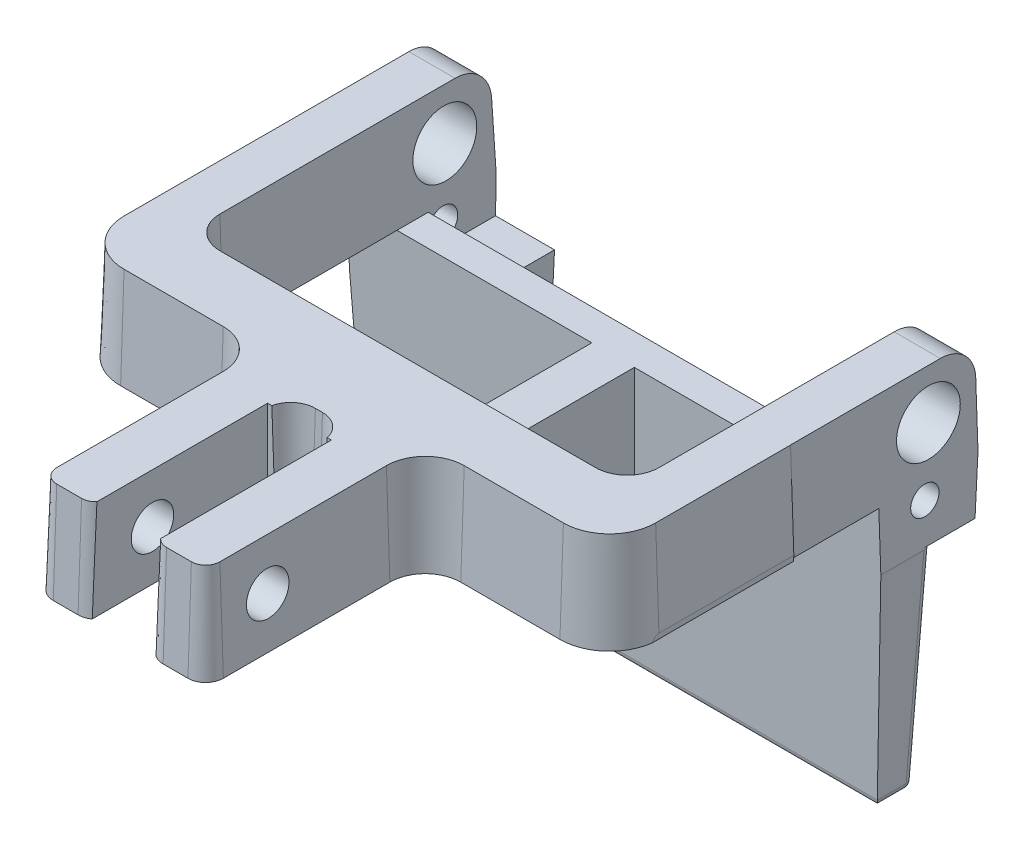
ISO-10303-21;
HEADER;
FILE_DESCRIPTION(('STEP AP214'),'2;1');
FILE_NAME('part.step','',(''),(''),'','','');
FILE_SCHEMA(('AUTOMOTIVE_DESIGN { 1 0 10303 214 1 1 1 1 }'));
ENDSEC;
DATA;
#1=APPLICATION_CONTEXT('core data for automotive mechanical design processes');
#2=APPLICATION_PROTOCOL_DEFINITION('international standard','automotive_design',2000,#1);
#3=PRODUCT_CONTEXT('',#1,'mechanical');
#4=PRODUCT('Part','Part','',(#3));
#5=PRODUCT_RELATED_PRODUCT_CATEGORY('part','',(#4));
#6=PRODUCT_DEFINITION_FORMATION('','',#4);
#7=PRODUCT_DEFINITION_CONTEXT('part definition',#1,'design');
#8=PRODUCT_DEFINITION('design','',#6,#7);
#9=PRODUCT_DEFINITION_SHAPE('','',#8);
#10=(LENGTH_UNIT() NAMED_UNIT(*) SI_UNIT(.MILLI.,.METRE.));
#11=(NAMED_UNIT(*) PLANE_ANGLE_UNIT() SI_UNIT($,.RADIAN.));
#12=(NAMED_UNIT(*) SI_UNIT($,.STERADIAN.) SOLID_ANGLE_UNIT());
#13=UNCERTAINTY_MEASURE_WITH_UNIT(LENGTH_MEASURE(1.E-05),#10,'distance_accuracy_value','');
#14=(GEOMETRIC_REPRESENTATION_CONTEXT(3) GLOBAL_UNCERTAINTY_ASSIGNED_CONTEXT((#13)) GLOBAL_UNIT_ASSIGNED_CONTEXT((#10,
#11,#12)) REPRESENTATION_CONTEXT('',''));
#15=CARTESIAN_POINT('',(0.,0.,0.));
#16=DIRECTION('',(0.,0.,1.));
#17=DIRECTION('',(1.,0.,0.));
#18=AXIS2_PLACEMENT_3D('',#15,#16,#17);
#19=CARTESIAN_POINT('',(61.,-4.72739634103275,19.));
#20=DIRECTION('',(0.,-1.,0.));
#21=DIRECTION('',(0.,0.,-1.));
#22=AXIS2_PLACEMENT_3D('',#19,#20,#21);
#23=PLANE('',#22);
#24=DIRECTION('',(0.,0.,-1.));
#25=VECTOR('',#24,1.);
#26=CARTESIAN_POINT('',(-60.6507923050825,-4.72739634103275,210.171881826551));
#27=LINE('',#26,#25);
#28=CARTESIAN_POINT('',(-60.6507923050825,-4.72739634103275,0.534254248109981));
#29=VERTEX_POINT('',#28);
#30=CARTESIAN_POINT('',(-60.6507923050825,-4.72739634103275,14.));
#31=VERTEX_POINT('',#30);
#32=EDGE_CURVE('E1176',#29,#31,#27,.F.);
#33=ORIENTED_EDGE('',*,*,#32,.T.);
#34=DIRECTION('',(1.,0.,0.));
#35=VECTOR('',#34,1.);
#36=CARTESIAN_POINT('',(60.6507923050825,-4.72739634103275,14.));
#37=LINE('',#36,#35);
#38=CARTESIAN_POINT('',(-44.,-4.72739634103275,14.));
#39=VERTEX_POINT('',#38);
#40=EDGE_CURVE('E1183',#31,#39,#37,.T.);
#41=ORIENTED_EDGE('',*,*,#40,.T.);
#42=DIRECTION('',(0.,0.,1.));
#43=VECTOR('',#42,1.);
#44=CARTESIAN_POINT('',(-44.,-4.72739634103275,16.));
#45=LINE('',#44,#43);
#46=CARTESIAN_POINT('',(-44.,-4.72739634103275,0.534254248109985));
#47=VERTEX_POINT('',#46);
#48=EDGE_CURVE('E1175',#47,#39,#45,.T.);
#49=ORIENTED_EDGE('',*,*,#48,.F.);
#50=DIRECTION('',(-1.,0.,0.));
#51=VECTOR('',#50,1.);
#52=CARTESIAN_POINT('',(89.1014466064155,-4.72739634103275,0.534254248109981));
#53=LINE('',#52,#51);
#54=EDGE_CURVE('E1208',#47,#29,#53,.T.);
#55=ORIENTED_EDGE('',*,*,#54,.T.);
#56=EDGE_LOOP('',(#33,#41,#49,#55));
#57=FACE_BOUND('',#56,.T.);
#58=ADVANCED_FACE('F186',(#57),#23,.F.);
#59=CARTESIAN_POINT('',(46.,33.2726036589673,16.));
#60=DIRECTION('',(1.,0.,0.));
#61=DIRECTION('',(0.,0.,-1.));
#62=AXIS2_PLACEMENT_3D('',#59,#60,#61);
#63=PLANE('',#62);
#64=DIRECTION('',(0.,-1.,0.));
#65=VECTOR('',#64,1.);
#66=CARTESIAN_POINT('',(46.,33.2726036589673,16.));
#67=LINE('',#66,#65);
#68=CARTESIAN_POINT('',(46.,-4.30997203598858,16.));
#69=VERTEX_POINT('',#68);
#70=CARTESIAN_POINT('',(46.,-70.7273963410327,16.));
#71=VERTEX_POINT('',#70);
#72=EDGE_CURVE('E200',#69,#71,#67,.T.);
#73=ORIENTED_EDGE('',*,*,#72,.F.);
#74=CARTESIAN_POINT('',(46.,0.272603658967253,14.));
#75=DIRECTION('',(1.,0.,0.));
#76=DIRECTION('',(0.,0.,-1.));
#77=AXIS2_PLACEMENT_3D('',#74,#75,#76);
#78=CIRCLE('',#77,5.);
#79=CARTESIAN_POINT('',(46.,-4.72739634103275,14.));
#80=VERTEX_POINT('',#79);
#81=EDGE_CURVE('E14',#69,#80,#78,.T.);
#82=ORIENTED_EDGE('',*,*,#81,.T.);
#83=DIRECTION('',(0.,0.,-1.));
#84=VECTOR('',#83,1.);
#85=CARTESIAN_POINT('',(46.,-4.72739634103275,16.));
#86=LINE('',#85,#84);
#87=CARTESIAN_POINT('',(46.,-4.72739634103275,0.534254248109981));
#88=VERTEX_POINT('',#87);
#89=EDGE_CURVE('E1168',#80,#88,#86,.T.);
#90=ORIENTED_EDGE('',*,*,#89,.T.);
#91=DIRECTION('',(0.,0.67099681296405,0.741460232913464));
#92=VECTOR('',#91,1.);
#93=CARTESIAN_POINT('',(46.,20.0760775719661,27.9424165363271));
#94=LINE('',#93,#92);
#95=CARTESIAN_POINT('',(46.,-4.73618869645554,0.524538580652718));
#96=VERTEX_POINT('',#95);
#97=EDGE_CURVE('E1214',#96,#88,#94,.T.);
#98=ORIENTED_EDGE('',*,*,#97,.F.);
#99=DIRECTION('',(0.,0.998629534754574,-0.0523359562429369));
#100=VECTOR('',#99,1.);
#101=CARTESIAN_POINT('',(46.,32.359682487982,-1.41957364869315));
#102=LINE('',#101,#100);
#103=CARTESIAN_POINT('',(46.,-68.8320682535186,3.88366128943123));
#104=VERTEX_POINT('',#103);
#105=EDGE_CURVE('E877',#104,#96,#102,.T.);
#106=ORIENTED_EDGE('',*,*,#105,.F.);
#107=CARTESIAN_POINT('',(46.,-68.7273963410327,5.88092035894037));
#108=DIRECTION('',(1.,0.,0.));
#109=DIRECTION('',(0.,0.,-1.));
#110=AXIS2_PLACEMENT_3D('',#107,#108,#109);
#111=CIRCLE('',#110,2.);
#112=CARTESIAN_POINT('',(46.,-70.7273963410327,5.88092035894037));
#113=VERTEX_POINT('',#112);
#114=EDGE_CURVE('E1528',#104,#113,#111,.F.);
#115=ORIENTED_EDGE('',*,*,#114,.T.);
#116=DIRECTION('',(0.,0.,1.));
#117=VECTOR('',#116,1.);
#118=CARTESIAN_POINT('',(46.,-70.7273963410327,16.));
#119=LINE('',#118,#117);
#120=EDGE_CURVE('E1427',#113,#71,#119,.T.);
#121=ORIENTED_EDGE('',*,*,#120,.T.);
#122=EDGE_LOOP('',(#73,#82,#90,#98,#106,#115,#121));
#123=FACE_BOUND('',#122,.T.);
#124=ADVANCED_FACE('F1141',(#123),#63,.F.);
#125=CARTESIAN_POINT('',(-44.,33.2726036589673,16.));
#126=DIRECTION('',(-1.,0.,0.));
#127=DIRECTION('',(0.,0.,1.));
#128=AXIS2_PLACEMENT_3D('',#125,#126,#127);
#129=PLANE('',#128);
#130=DIRECTION('',(0.,-0.67099681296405,-0.741460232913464));
#131=VECTOR('',#130,1.);
#132=CARTESIAN_POINT('',(-44.,20.0760775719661,27.9424165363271));
#133=LINE('',#132,#131);
#134=CARTESIAN_POINT('',(-44.,-4.73618869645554,0.524538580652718));
#135=VERTEX_POINT('',#134);
#136=EDGE_CURVE('E1207',#47,#135,#133,.T.);
#137=ORIENTED_EDGE('',*,*,#136,.F.);
#138=ORIENTED_EDGE('',*,*,#48,.T.);
#139=CARTESIAN_POINT('',(-44.,0.272603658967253,14.));
#140=DIRECTION('',(-1.,0.,0.));
#141=DIRECTION('',(0.,0.,1.));
#142=AXIS2_PLACEMENT_3D('',#139,#140,#141);
#143=CIRCLE('',#142,5.);
#144=CARTESIAN_POINT('',(-44.,-4.30997203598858,16.));
#145=VERTEX_POINT('',#144);
#146=EDGE_CURVE('E1198',#39,#145,#143,.T.);
#147=ORIENTED_EDGE('',*,*,#146,.T.);
#148=DIRECTION('',(0.,-1.,0.));
#149=VECTOR('',#148,1.);
#150=CARTESIAN_POINT('',(-44.,33.2726036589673,16.));
#151=LINE('',#150,#149);
#152=CARTESIAN_POINT('',(-44.,-70.7273963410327,16.));
#153=VERTEX_POINT('',#152);
#154=EDGE_CURVE('E207',#145,#153,#151,.T.);
#155=ORIENTED_EDGE('',*,*,#154,.T.);
#156=DIRECTION('',(0.,0.,-1.));
#157=VECTOR('',#156,1.);
#158=CARTESIAN_POINT('',(-44.,-70.7273963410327,16.));
#159=LINE('',#158,#157);
#160=CARTESIAN_POINT('',(-44.,-70.7273963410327,5.88092035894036));
#161=VERTEX_POINT('',#160);
#162=EDGE_CURVE('E1431',#153,#161,#159,.T.);
#163=ORIENTED_EDGE('',*,*,#162,.T.);
#164=CARTESIAN_POINT('',(-44.,-68.7273963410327,5.88092035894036));
#165=DIRECTION('',(-1.,0.,0.));
#166=DIRECTION('',(0.,0.,1.));
#167=AXIS2_PLACEMENT_3D('',#164,#165,#166);
#168=CIRCLE('',#167,2.);
#169=CARTESIAN_POINT('',(-44.,-68.8320682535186,3.88366128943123));
#170=VERTEX_POINT('',#169);
#171=EDGE_CURVE('E1498',#161,#170,#168,.F.);
#172=ORIENTED_EDGE('',*,*,#171,.T.);
#173=DIRECTION('',(0.,-0.998629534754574,0.0523359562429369));
#174=VECTOR('',#173,1.);
#175=CARTESIAN_POINT('',(-44.,5.27260365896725,0.));
#176=LINE('',#175,#174);
#177=EDGE_CURVE('E743',#135,#170,#176,.T.);
#178=ORIENTED_EDGE('',*,*,#177,.F.);
#179=EDGE_LOOP('',(#137,#138,#147,#155,#163,#172,#178));
#180=FACE_BOUND('',#179,.T.);
#181=ADVANCED_FACE('F1149',(#180),#129,.F.);
#182=CARTESIAN_POINT('',(61.,5.27260365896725,210.171881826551));
#183=DIRECTION('',(0.,-1.,0.));
#184=DIRECTION('',(0.,0.,-1.));
#185=AXIS2_PLACEMENT_3D('',#182,#183,#184);
#186=PLANE('',#185);
#187=DIRECTION('',(0.,0.,-1.));
#188=VECTOR('',#187,1.);
#189=CARTESIAN_POINT('',(61.,5.27260365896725,210.171881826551));
#190=LINE('',#189,#188);
#191=CARTESIAN_POINT('',(61.,5.27260365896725,28.0000000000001));
#192=VERTEX_POINT('',#191);
#193=CARTESIAN_POINT('',(61.,5.27260365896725,19.1746038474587));
#194=VERTEX_POINT('',#193);
#195=EDGE_CURVE('E721',#192,#194,#190,.T.);
#196=ORIENTED_EDGE('',*,*,#195,.T.);
#197=DIRECTION('',(1.,0.,0.));
#198=VECTOR('',#197,1.);
#199=CARTESIAN_POINT('',(-65.9172705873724,5.27260365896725,19.1746038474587));
#200=LINE('',#199,#198);
#201=CARTESIAN_POINT('',(-61.,5.27260365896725,19.1746038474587));
#202=VERTEX_POINT('',#201);
#203=EDGE_CURVE('E705',#202,#194,#200,.T.);
#204=ORIENTED_EDGE('',*,*,#203,.F.);
#205=DIRECTION('',(0.,0.,-1.));
#206=VECTOR('',#205,1.);
#207=CARTESIAN_POINT('',(-61.,5.27260365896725,210.171881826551));
#208=LINE('',#207,#206);
#209=CARTESIAN_POINT('',(-61.,5.27260365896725,28.0000000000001));
#210=VERTEX_POINT('',#209);
#211=EDGE_CURVE('E732',#210,#202,#208,.T.);
#212=ORIENTED_EDGE('',*,*,#211,.F.);
#213=DIRECTION('',(1.,0.,0.));
#214=VECTOR('',#213,1.);
#215=CARTESIAN_POINT('',(-76.,5.27260365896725,28.));
#216=LINE('',#215,#214);
#217=CARTESIAN_POINT('',(-6.,5.27260365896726,28.));
#218=VERTEX_POINT('',#217);
#219=EDGE_CURVE('E1436',#210,#218,#216,.T.);
#220=ORIENTED_EDGE('',*,*,#219,.T.);
#221=DIRECTION('',(0.,0.,1.));
#222=VECTOR('',#221,1.);
#223=CARTESIAN_POINT('',(-6.,5.27260365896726,19.7090560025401));
#224=LINE('',#223,#222);
#225=CARTESIAN_POINT('',(-6.,5.27260365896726,83.0686224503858));
#226=VERTEX_POINT('',#225);
#227=EDGE_CURVE('E734',#218,#226,#224,.T.);
#228=ORIENTED_EDGE('',*,*,#227,.T.);
#229=DIRECTION('',(1.,0.,0.));
#230=VECTOR('',#229,1.);
#231=CARTESIAN_POINT('',(5.99999999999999,5.27260365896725,83.0686224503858));
#232=LINE('',#231,#230);
#233=CARTESIAN_POINT('',(6.,5.27260365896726,83.0686224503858));
#234=VERTEX_POINT('',#233);
#235=EDGE_CURVE('E980',#226,#234,#232,.T.);
#236=ORIENTED_EDGE('',*,*,#235,.T.);
#237=DIRECTION('',(0.,0.,-1.));
#238=VECTOR('',#237,1.);
#239=CARTESIAN_POINT('',(6.,5.27260365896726,19.7090560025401));
#240=LINE('',#239,#238);
#241=CARTESIAN_POINT('',(6.,5.27260365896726,28.));
#242=VERTEX_POINT('',#241);
#243=EDGE_CURVE('E731',#234,#242,#240,.T.);
#244=ORIENTED_EDGE('',*,*,#243,.T.);
#245=EDGE_CURVE('E730',#242,#192,#216,.T.);
#246=ORIENTED_EDGE('',*,*,#245,.T.);
#247=EDGE_LOOP('',(#196,#204,#212,#220,#228,#236,#244,#246));
#248=FACE_BOUND('',#247,.T.);
#249=ADVANCED_FACE('F728',(#248),#186,.F.);
#250=CARTESIAN_POINT('',(-76.,5.27260365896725,0.));
#251=DIRECTION('',(0.,0.0523359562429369,0.998629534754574));
#252=DIRECTION('',(0.,-0.998629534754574,0.0523359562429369));
#253=AXIS2_PLACEMENT_3D('',#250,#251,#252);
#254=PLANE('',#253);
#255=DIRECTION('',(-1.,0.,0.));
#256=VECTOR('',#255,1.);
#257=CARTESIAN_POINT('',(-76.,-4.73618869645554,0.524538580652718));
#258=LINE('',#257,#256);
#259=CARTESIAN_POINT('',(-60.6504852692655,-4.73618869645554,0.524538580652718));
#260=VERTEX_POINT('',#259);
#261=EDGE_CURVE('E1216',#135,#260,#258,.T.);
#262=ORIENTED_EDGE('',*,*,#261,.F.);
#263=ORIENTED_EDGE('',*,*,#177,.T.);
#264=DIRECTION('',(1.,0.,0.));
#265=VECTOR('',#264,1.);
#266=CARTESIAN_POINT('',(-76.,-68.8320682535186,3.88366128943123));
#267=LINE('',#266,#265);
#268=CARTESIAN_POINT('',(-51.914643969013,-68.8320682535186,3.88366128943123));
#269=VERTEX_POINT('',#268);
#270=EDGE_CURVE('E1501',#170,#269,#267,.F.);
#271=ORIENTED_EDGE('',*,*,#270,.T.);
#272=DIRECTION('',(-0.0348517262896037,0.998022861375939,-0.0523041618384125));
#273=VECTOR('',#272,1.);
#274=CARTESIAN_POINT('',(-54.5285479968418,6.02034954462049,-0.0391877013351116));
#275=LINE('',#274,#273);
#276=CARTESIAN_POINT('',(-53.9437038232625,-10.7273963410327,0.838524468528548));
#277=VERTEX_POINT('',#276);
#278=EDGE_CURVE('E1574',#269,#277,#275,.T.);
#279=ORIENTED_EDGE('',*,*,#278,.T.);
#280=DIRECTION('',(1.,0.,0.));
#281=VECTOR('',#280,1.);
#282=CARTESIAN_POINT('',(-56.5,-10.7273963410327,0.838524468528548));
#283=LINE('',#282,#281);
#284=CARTESIAN_POINT('',(-75.,-10.7273963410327,0.838524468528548));
#285=VERTEX_POINT('',#284);
#286=EDGE_CURVE('E900',#285,#277,#283,.T.);
#287=ORIENTED_EDGE('',*,*,#286,.F.);
#288=DIRECTION('',(0.,0.998629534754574,-0.0523359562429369));
#289=VECTOR('',#288,1.);
#290=CARTESIAN_POINT('',(-75.,5.27260365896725,0.));
#291=LINE('',#290,#289);
#292=CARTESIAN_POINT('',(-75.,5.27260365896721,0.));
#293=VERTEX_POINT('',#292);
#294=EDGE_CURVE('E1405',#285,#293,#291,.T.);
#295=ORIENTED_EDGE('',*,*,#294,.T.);
#296=DIRECTION('',(-1.,0.,0.));
#297=VECTOR('',#296,1.);
#298=CARTESIAN_POINT('',(-76.,5.27260365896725,0.));
#299=LINE('',#298,#297);
#300=CARTESIAN_POINT('',(-61.,5.27260365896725,0.));
#301=VERTEX_POINT('',#300);
#302=EDGE_CURVE('E901',#293,#301,#299,.F.);
#303=ORIENTED_EDGE('',*,*,#302,.T.);
#304=DIRECTION('',(-0.0348517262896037,0.998022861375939,-0.0523041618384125));
#305=VECTOR('',#304,1.);
#306=CARTESIAN_POINT('',(-61.0182196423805,5.79434595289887,-0.0273433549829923));
#307=LINE('',#306,#305);
#308=EDGE_CURVE('E1187',#301,#260,#307,.F.);
#309=ORIENTED_EDGE('',*,*,#308,.T.);
#310=EDGE_LOOP('',(#262,#263,#271,#279,#287,#295,#303,#309));
#311=FACE_BOUND('',#310,.T.);
#312=ADVANCED_FACE('F1682',(#311),#254,.F.);
#313=CARTESIAN_POINT('',(76.,5.27260365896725,0.));
#314=DIRECTION('',(0.,-0.0523359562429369,-0.998629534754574));
#315=DIRECTION('',(0.,0.998629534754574,-0.0523359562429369));
#316=AXIS2_PLACEMENT_3D('',#313,#314,#315);
#317=PLANE('',#316);
#318=ORIENTED_EDGE('',*,*,#105,.T.);
#319=DIRECTION('',(1.,0.,0.));
#320=VECTOR('',#319,1.);
#321=CARTESIAN_POINT('',(76.,-4.73618869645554,0.524538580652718));
#322=LINE('',#321,#320);
#323=CARTESIAN_POINT('',(60.6504852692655,-4.73618869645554,0.524538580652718));
#324=VERTEX_POINT('',#323);
#325=EDGE_CURVE('E1604',#96,#324,#322,.T.);
#326=ORIENTED_EDGE('',*,*,#325,.T.);
#327=DIRECTION('',(0.0348517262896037,0.998022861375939,-0.0523041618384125));
#328=VECTOR('',#327,1.);
#329=CARTESIAN_POINT('',(61.0182196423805,5.79434595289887,-0.0273433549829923));
#330=LINE('',#329,#328);
#331=CARTESIAN_POINT('',(61.,5.27260365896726,0.));
#332=VERTEX_POINT('',#331);
#333=EDGE_CURVE('E1603',#332,#324,#330,.F.);
#334=ORIENTED_EDGE('',*,*,#333,.F.);
#335=DIRECTION('',(1.,0.,0.));
#336=VECTOR('',#335,1.);
#337=CARTESIAN_POINT('',(76.,5.27260365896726,0.));
#338=LINE('',#337,#336);
#339=CARTESIAN_POINT('',(75.,5.27260365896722,0.));
#340=VERTEX_POINT('',#339);
#341=EDGE_CURVE('E869',#340,#332,#338,.F.);
#342=ORIENTED_EDGE('',*,*,#341,.F.);
#343=DIRECTION('',(0.,0.998629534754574,-0.0523359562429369));
#344=VECTOR('',#343,1.);
#345=CARTESIAN_POINT('',(75.,5.27260365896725,0.));
#346=LINE('',#345,#344);
#347=CARTESIAN_POINT('',(75.,-10.7273963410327,0.838524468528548));
#348=VERTEX_POINT('',#347);
#349=EDGE_CURVE('E1814',#348,#340,#346,.T.);
#350=ORIENTED_EDGE('',*,*,#349,.F.);
#351=DIRECTION('',(-1.,0.,0.));
#352=VECTOR('',#351,1.);
#353=CARTESIAN_POINT('',(76.,-10.7273963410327,0.838524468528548));
#354=LINE('',#353,#352);
#355=CARTESIAN_POINT('',(55.9437038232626,-10.7273963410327,0.838524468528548));
#356=VERTEX_POINT('',#355);
#357=EDGE_CURVE('E872',#348,#356,#354,.T.);
#358=ORIENTED_EDGE('',*,*,#357,.T.);
#359=DIRECTION('',(0.0348517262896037,0.998022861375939,-0.0523041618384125));
#360=VECTOR('',#359,1.);
#361=CARTESIAN_POINT('',(53.9182880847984,-68.7277144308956,3.87819233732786));
#362=LINE('',#361,#360);
#363=CARTESIAN_POINT('',(53.914643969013,-68.8320682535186,3.88366128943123));
#364=VERTEX_POINT('',#363);
#365=EDGE_CURVE('E1592',#356,#364,#362,.F.);
#366=ORIENTED_EDGE('',*,*,#365,.T.);
#367=DIRECTION('',(-1.,0.,0.));
#368=VECTOR('',#367,1.);
#369=CARTESIAN_POINT('',(46.,-68.8320682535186,3.88366128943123));
#370=LINE('',#369,#368);
#371=EDGE_CURVE('E1526',#364,#104,#370,.T.);
#372=ORIENTED_EDGE('',*,*,#371,.T.);
#373=EDGE_LOOP('',(#318,#326,#334,#342,#350,#358,#366,#372));
#374=FACE_BOUND('',#373,.T.);
#375=ADVANCED_FACE('F1685',(#374),#317,.T.);
#376=CARTESIAN_POINT('',(46.,33.2726036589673,16.));
#377=DIRECTION('',(0.,0.,1.));
#378=DIRECTION('',(1.,0.,0.));
#379=AXIS2_PLACEMENT_3D('',#376,#377,#378);
#380=PLANE('',#379);
#381=ORIENTED_EDGE('',*,*,#154,.F.);
#382=DIRECTION('',(-1.,0.,0.));
#383=VECTOR('',#382,1.);
#384=CARTESIAN_POINT('',(-44.,-4.3099720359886,16.));
#385=LINE('',#384,#383);
#386=EDGE_CURVE('E194',#145,#69,#385,.F.);
#387=ORIENTED_EDGE('',*,*,#386,.T.);
#388=ORIENTED_EDGE('',*,*,#72,.T.);
#389=DIRECTION('',(-1.,0.,0.));
#390=VECTOR('',#389,1.);
#391=CARTESIAN_POINT('',(46.,-70.7273963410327,16.));
#392=LINE('',#391,#390);
#393=EDGE_CURVE('E1429',#71,#153,#392,.T.);
#394=ORIENTED_EDGE('',*,*,#393,.T.);
#395=EDGE_LOOP('',(#381,#387,#388,#394));
#396=FACE_BOUND('',#395,.T.);
#397=ADVANCED_FACE('F1199',(#396),#380,.F.);
#398=CARTESIAN_POINT('',(76.,7.79894201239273,167.));
#399=DIRECTION('',(0.998629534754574,-0.052335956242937,0.));
#400=DIRECTION('',(0.052335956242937,0.998629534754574,0.));
#401=AXIS2_PLACEMENT_3D('',#398,#399,#400);
#402=PLANE('',#401);
#403=DIRECTION('',(-0.052335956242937,-0.998629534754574,0.));
#404=VECTOR('',#403,1.);
#405=CARTESIAN_POINT('',(76.,7.79894201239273,52.9301584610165));
#406=LINE('',#405,#404);
#407=CARTESIAN_POINT('',(75.9470562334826,6.78871476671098,52.9301584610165));
#408=VERTEX_POINT('',#407);
#409=CARTESIAN_POINT('',(75.8676002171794,5.27260365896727,52.9301584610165));
#410=VERTEX_POINT('',#409);
#411=EDGE_CURVE('E1385',#408,#410,#406,.T.);
#412=ORIENTED_EDGE('',*,*,#411,.F.);
#413=DIRECTION('',(0.,0.,1.));
#414=VECTOR('',#413,1.);
#415=CARTESIAN_POINT('',(75.9470562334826,6.78871476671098,167.));
#416=LINE('',#415,#414);
#417=CARTESIAN_POINT('',(75.9470562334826,6.78871476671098,91.));
#418=VERTEX_POINT('',#417);
#419=EDGE_CURVE('E874',#418,#408,#416,.F.);
#420=ORIENTED_EDGE('',*,*,#419,.F.);
#421=CARTESIAN_POINT('',(34.14835803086,-790.777959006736,91.));
#422=DIRECTION('',(0.998629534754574,-0.052335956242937,0.));
#423=DIRECTION('',(-0.052335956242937,-0.998629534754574,0.));
#424=AXIS2_PLACEMENT_3D('',#421,#422,#423);
#425=ELLIPSE('',#424,798.661211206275,31.1675666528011);
#426=CARTESIAN_POINT('',(75.8676002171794,5.27260365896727,92.9208498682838));
#427=VERTEX_POINT('',#426);
#428=EDGE_CURVE('E779',#418,#427,#425,.T.);
#429=ORIENTED_EDGE('',*,*,#428,.T.);
#430=DIRECTION('',(0.,0.,-1.));
#431=VECTOR('',#430,1.);
#432=CARTESIAN_POINT('',(75.8676002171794,5.27260365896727,167.));
#433=LINE('',#432,#431);
#434=EDGE_CURVE('E740',#427,#410,#433,.T.);
#435=ORIENTED_EDGE('',*,*,#434,.T.);
#436=EDGE_LOOP('',(#412,#420,#429,#435));
#437=FACE_BOUND('',#436,.T.);
#438=ADVANCED_FACE('F1383',(#437),#402,.T.);
#439=CARTESIAN_POINT('',(-76.,7.79894201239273,167.));
#440=DIRECTION('',(0.998629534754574,0.052335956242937,0.));
#441=DIRECTION('',(-0.052335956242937,0.998629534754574,0.));
#442=AXIS2_PLACEMENT_3D('',#439,#440,#441);
#443=PLANE('',#442);
#444=DIRECTION('',(0.,0.,-1.));
#445=VECTOR('',#444,1.);
#446=CARTESIAN_POINT('',(-75.,-11.2821946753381,167.));
#447=LINE('',#446,#445);
#448=CARTESIAN_POINT('',(-75.,-11.2821946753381,27.4218937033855));
#449=VERTEX_POINT('',#448);
#450=CARTESIAN_POINT('',(-75.,-11.2821946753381,15.0756701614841));
#451=VERTEX_POINT('',#450);
#452=EDGE_CURVE('E1409',#449,#451,#447,.T.);
#453=ORIENTED_EDGE('',*,*,#452,.T.);
#454=DIRECTION('',(0.0523041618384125,-0.998022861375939,0.0348517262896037));
#455=VECTOR('',#454,1.);
#456=CARTESIAN_POINT('',(-75.7218439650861,2.49140868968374,14.5946853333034));
#457=LINE('',#456,#455);
#458=CARTESIAN_POINT('',(-71.9839389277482,-68.8320682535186,17.085356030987));
#459=VERTEX_POINT('',#458);
#460=EDGE_CURVE('E1566',#451,#459,#457,.T.);
#461=ORIENTED_EDGE('',*,*,#460,.T.);
#462=DIRECTION('',(0.,0.,-1.));
#463=VECTOR('',#462,1.);
#464=CARTESIAN_POINT('',(-71.9839389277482,-68.8320682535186,167.));
#465=LINE('',#464,#463);
#466=CARTESIAN_POINT('',(-71.9839389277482,-68.8320682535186,25.4119030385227));
#467=VERTEX_POINT('',#466);
#468=EDGE_CURVE('E1511',#459,#467,#465,.F.);
#469=ORIENTED_EDGE('',*,*,#468,.T.);
#470=CARTESIAN_POINT('',(-71.9894245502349,-68.7273963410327,23.4146439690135));
#471=DIRECTION('',(0.998629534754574,0.052335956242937,0.));
#472=DIRECTION('',(0.052335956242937,-0.998629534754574,0.));
#473=AXIS2_PLACEMENT_3D('',#470,#471,#472);
#474=ELLIPSE('',#473,2.00274469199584,2.);
#475=CARTESIAN_POINT('',(-71.9857665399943,-68.7971953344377,25.4134256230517));
#476=VERTEX_POINT('',#475);
#477=EDGE_CURVE('E1422',#467,#476,#474,.F.);
#478=ORIENTED_EDGE('',*,*,#477,.T.);
#479=DIRECTION('',(0.0523041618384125,-0.998022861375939,-0.0348517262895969));
#480=VECTOR('',#479,1.);
#481=CARTESIAN_POINT('',(-75.867962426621,5.27951502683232,28.0002413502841));
#482=LINE('',#481,#480);
#483=EDGE_CURVE('E783',#449,#476,#482,.T.);
#484=ORIENTED_EDGE('',*,*,#483,.F.);
#485=EDGE_LOOP('',(#453,#461,#469,#478,#484));
#486=FACE_BOUND('',#485,.T.);
#487=ADVANCED_FACE('F1419',(#486),#443,.F.);
#488=CARTESIAN_POINT('',(-146.,19.2726036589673,149.));
#489=DIRECTION('',(1.,0.,0.));
#490=DIRECTION('',(0.,0.,-1.));
#491=AXIS2_PLACEMENT_3D('',#488,#489,#490);
#492=CYLINDRICAL_SURFACE('',#491,6.00000000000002);
#493=CARTESIAN_POINT('',(-23.5111092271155,19.2726036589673,149.));
#494=DIRECTION('',(-0.999390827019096,0.0348994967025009,0.));
#495=DIRECTION('',(0.0348994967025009,0.999390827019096,0.));
#496=AXIS2_PLACEMENT_3D('',#493,#494,#495);
#497=ELLIPSE('',#496,6.00365726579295,6.00000000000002);
#498=CARTESIAN_POINT('',(-23.301584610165,25.2726036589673,149.));
#499=VERTEX_POINT('',#498);
#500=EDGE_CURVE('E904',#499,#499,#497,.F.);
#501=ORIENTED_EDGE('',*,*,#500,.F.);
#502=EDGE_LOOP('',(#501));
#503=FACE_BOUND('',#502,.T.);
#504=CARTESIAN_POINT('',(-9.00000000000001,19.2726036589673,149.));
#505=DIRECTION('',(1.,0.,0.));
#506=DIRECTION('',(0.,0.,-1.));
#507=AXIS2_PLACEMENT_3D('',#504,#505,#506);
#508=CIRCLE('',#507,6.00000000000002);
#509=CARTESIAN_POINT('',(-9.00000000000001,19.2726036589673,143.));
#510=VERTEX_POINT('',#509);
#511=EDGE_CURVE('E1319',#510,#510,#508,.F.);
#512=ORIENTED_EDGE('',*,*,#511,.F.);
#513=EDGE_LOOP('',(#512));
#514=FACE_BOUND('',#513,.T.);
#515=ADVANCED_FACE('F1689',(#503,#514),#492,.F.);
#516=CARTESIAN_POINT('',(-12.,5.27260365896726,162.));
#517=DIRECTION('',(0.,-1.,0.));
#518=DIRECTION('',(-1.,0.,0.));
#519=AXIS2_PLACEMENT_3D('',#516,#517,#518);
#520=CONICAL_SURFACE('',#519,5.,0.0349065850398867);
#521=CARTESIAN_POINT('',(-12.,5.27260365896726,162.));
#522=DIRECTION('',(0.,1.,0.));
#523=DIRECTION('',(-1.,0.,0.));
#524=AXIS2_PLACEMENT_3D('',#521,#522,#523);
#525=CIRCLE('',#524,5.);
#526=CARTESIAN_POINT('',(-9.,5.27260365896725,166.));
#527=VERTEX_POINT('',#526);
#528=CARTESIAN_POINT('',(-12.,5.27260365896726,167.));
#529=VERTEX_POINT('',#528);
#530=EDGE_CURVE('E760',#527,#529,#525,.F.);
#531=ORIENTED_EDGE('',*,*,#530,.F.);
#532=CARTESIAN_POINT('',(-9.,-40.6501970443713,167.882883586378));
#533=CARTESIAN_POINT('',(-9.,-38.5248409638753,167.799567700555));
#534=CARTESIAN_POINT('',(-9.,-36.3994988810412,167.715893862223));
#535=CARTESIAN_POINT('',(-9.,-32.1488462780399,167.547713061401));
#536=CARTESIAN_POINT('',(-9.,-30.0235357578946,167.46320609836));
#537=CARTESIAN_POINT('',(-9.,-24.9873283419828,167.261827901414));
#538=CARTESIAN_POINT('',(-9.,-22.0764480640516,167.144540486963));
#539=CARTESIAN_POINT('',(-9.,-16.2547762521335,166.90778397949));
#540=CARTESIAN_POINT('',(-9.,-13.3439847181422,166.788314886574));
#541=CARTESIAN_POINT('',(-9.,-7.52251364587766,166.546654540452));
#542=CARTESIAN_POINT('',(-9.,-4.61183410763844,166.424463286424));
#543=CARTESIAN_POINT('',(-9.,1.2093770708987,166.176611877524));
#544=CARTESIAN_POINT('',(-9.,4.1199087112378,166.050951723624));
#545=CARTESIAN_POINT('',(-9.,7.82491991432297,165.888071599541));
#546=CARTESIAN_POINT('',(-9.,8.61949271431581,165.852969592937));
#547=CARTESIAN_POINT('',(-9.,10.2086210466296,165.782392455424));
#548=CARTESIAN_POINT('',(-9.,11.0031765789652,165.746917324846));
#549=CARTESIAN_POINT('',(-9.,12.5922667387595,165.675561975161));
#550=CARTESIAN_POINT('',(-9.,13.3868013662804,165.63968175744));
#551=CARTESIAN_POINT('',(-9.,14.9758526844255,165.567478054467));
#552=CARTESIAN_POINT('',(-9.,15.7703693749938,165.531154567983));
#553=CARTESIAN_POINT('',(-9.,18.1539887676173,165.421452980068));
#554=CARTESIAN_POINT('',(-9.,19.7430581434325,165.347348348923));
#555=CARTESIAN_POINT('',(-9.,22.9210838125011,165.196784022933));
#556=CARTESIAN_POINT('',(-9.,24.5100401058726,165.120324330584));
#557=CARTESIAN_POINT('',(-9.,27.6877842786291,164.964481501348));
#558=CARTESIAN_POINT('',(-9.,29.2765721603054,164.885098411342));
#559=CARTESIAN_POINT('',(-9.,32.4539654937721,164.722600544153));
#560=CARTESIAN_POINT('',(-9.,34.0425709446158,164.639485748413));
#561=CARTESIAN_POINT('',(-9.,37.2196439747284,164.468342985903));
#562=CARTESIAN_POINT('',(-9.,38.8081115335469,164.380314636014));
#563=CARTESIAN_POINT('',(-9.,41.1905068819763,164.24314952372));
#564=CARTESIAN_POINT('',(-9.,41.9845821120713,164.196574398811));
#565=CARTESIAN_POINT('',(-9.,43.5726102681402,164.101347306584));
#566=CARTESIAN_POINT('',(-9.,44.3665631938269,164.052695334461));
#567=CARTESIAN_POINT('',(-9.,45.9543663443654,163.952832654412));
#568=CARTESIAN_POINT('',(-9.,46.748216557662,163.901621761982));
#569=CARTESIAN_POINT('',(-9.,48.3356968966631,163.795957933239));
#570=CARTESIAN_POINT('',(-9.,49.1293270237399,163.741505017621));
#571=CARTESIAN_POINT('',(-9.,50.716324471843,163.628341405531));
#572=CARTESIAN_POINT('',(-9.,51.5096917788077,163.569630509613));
#573=CARTESIAN_POINT('',(-9.,52.6994064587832,163.477120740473));
#574=CARTESIAN_POINT('',(-9.,53.0959262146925,163.445543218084));
#575=CARTESIAN_POINT('',(-9.,53.888817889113,163.380555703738));
#576=CARTESIAN_POINT('',(-9.,54.2851898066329,163.347145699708));
#577=CARTESIAN_POINT('',(-9.,54.6814687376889,163.312643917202));
#578=B_SPLINE_CURVE_WITH_KNOTS('',3,(#532,#533,#534,#535,#536,#537,#538,#539,#540,#541,#542,
#543,#544,#545,#546,#547,#548,#549,#550,#551,#552,#553,#554,#555,#556,#557,#558,#559,#560,#561,
#562,#563,#564,#565,#566,#567,#568,#569,#570,#571,#572,#573,#574,#575,#576,#577),.UNSPECIFIED.,
.F.,.F.,(4,2,2,2,2,2,2,2,2,2,2,2,2,2,2,2,2,2,2,2,2,2,4),(0.,6.38096546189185,12.761935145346,
21.5016611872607,30.2413867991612,38.9811150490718,47.7208408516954,50.1068841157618,
52.4929252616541,54.8789582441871,57.2649978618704,62.0373853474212,66.8097677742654,
71.5820737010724,76.3544033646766,81.1271056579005,83.5134234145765,85.8997466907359,
88.2862422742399,90.6727226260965,93.0593148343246,94.2526364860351,95.445965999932),.UNSPECIFIED.);
#579=CARTESIAN_POINT('',(-8.99999999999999,33.2726036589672,164.679224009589));
#580=VERTEX_POINT('',#579);
#581=EDGE_CURVE('E986',#527,#580,#578,.T.);
#582=ORIENTED_EDGE('',*,*,#581,.T.);
#583=CARTESIAN_POINT('',(-12.,33.2726036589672,162.));
#584=DIRECTION('',(0.,-1.,0.));
#585=DIRECTION('',(0.,0.,-1.));
#586=AXIS2_PLACEMENT_3D('',#583,#584,#585);
#587=CIRCLE('',#586,4.02221845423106);
#588=CARTESIAN_POINT('',(-12.,33.2726036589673,166.022218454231));
#589=VERTEX_POINT('',#588);
#590=EDGE_CURVE('E843',#589,#580,#587,.F.);
#591=ORIENTED_EDGE('',*,*,#590,.F.);
#592=DIRECTION('',(0.,-0.999390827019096,0.0348994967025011));
#593=VECTOR('',#592,1.);
#594=CARTESIAN_POINT('',(-12.,5.27260365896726,167.));
#595=LINE('',#594,#593);
#596=EDGE_CURVE('E808',#529,#589,#595,.F.);
#597=ORIENTED_EDGE('',*,*,#596,.F.);
#598=EDGE_LOOP('',(#531,#582,#591,#597));
#599=FACE_BOUND('',#598,.T.);
#600=ADVANCED_FACE('F1001',(#599),#520,.T.);
#601=CARTESIAN_POINT('',(-94.,5.27260365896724,0.));
#602=DIRECTION('',(0.,0.034899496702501,-0.999390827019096));
#603=DIRECTION('',(0.,0.999390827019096,0.034899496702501));
#604=AXIS2_PLACEMENT_3D('',#601,#602,#603);
#605=PLANE('',#604);
#606=DIRECTION('',(-1.,0.,0.));
#607=VECTOR('',#606,1.);
#608=CARTESIAN_POINT('',(-94.,23.6215986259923,0.640761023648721));
#609=LINE('',#608,#607);
#610=CARTESIAN_POINT('',(61.6407610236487,23.6215986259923,0.64076102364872));
#611=VERTEX_POINT('',#610);
#612=CARTESIAN_POINT('',(75.,23.6215986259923,0.64076102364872));
#613=VERTEX_POINT('',#612);
#614=EDGE_CURVE('E975',#611,#613,#609,.F.);
#615=ORIENTED_EDGE('',*,*,#614,.T.);
#616=DIRECTION('',(0.,0.999390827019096,0.034899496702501));
#617=VECTOR('',#616,1.);
#618=CARTESIAN_POINT('',(75.,5.27260365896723,0.));
#619=LINE('',#618,#617);
#620=EDGE_CURVE('E1811',#613,#340,#619,.F.);
#621=ORIENTED_EDGE('',*,*,#620,.T.);
#622=ORIENTED_EDGE('',*,*,#341,.T.);
#623=DIRECTION('',(-0.0348782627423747,-0.998782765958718,-0.0348782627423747));
#624=VECTOR('',#623,1.);
#625=CARTESIAN_POINT('',(61.2556726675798,12.5941109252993,0.255672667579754));
#626=LINE('',#625,#624);
#627=EDGE_CURVE('E961',#611,#332,#626,.T.);
#628=ORIENTED_EDGE('',*,*,#627,.F.);
#629=EDGE_LOOP('',(#615,#621,#622,#628));
#630=FACE_BOUND('',#629,.T.);
#631=ADVANCED_FACE('F1089',(#630),#605,.T.);
#632=CARTESIAN_POINT('',(-76.,-70.7273963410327,167.));
#633=DIRECTION('',(0.,1.,0.));
#634=DIRECTION('',(0.,0.,1.));
#635=AXIS2_PLACEMENT_3D('',#632,#633,#634);
#636=PLANE('',#635);
#637=DIRECTION('',(0.,0.,-1.));
#638=VECTOR('',#637,1.);
#639=CARTESIAN_POINT('',(-51.914643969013,-70.7273963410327,167.));
#640=LINE('',#639,#638);
#641=CARTESIAN_POINT('',(-51.914643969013,-70.7273963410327,17.085356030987));
#642=VERTEX_POINT('',#641);
#643=CARTESIAN_POINT('',(-51.914643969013,-70.7273963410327,5.88092035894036));
#644=VERTEX_POINT('',#643);
#645=EDGE_CURVE('E1492',#642,#644,#640,.T.);
#646=ORIENTED_EDGE('',*,*,#645,.T.);
#647=DIRECTION('',(1.,0.,0.));
#648=VECTOR('',#647,1.);
#649=CARTESIAN_POINT('',(-76.,-70.7273963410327,5.88092035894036));
#650=LINE('',#649,#648);
#651=EDGE_CURVE('E1495',#644,#161,#650,.T.);
#652=ORIENTED_EDGE('',*,*,#651,.T.);
#653=ORIENTED_EDGE('',*,*,#162,.F.);
#654=ORIENTED_EDGE('',*,*,#393,.F.);
#655=ORIENTED_EDGE('',*,*,#120,.F.);
#656=DIRECTION('',(-1.,0.,0.));
#657=VECTOR('',#656,1.);
#658=CARTESIAN_POINT('',(55.8460215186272,-70.7273963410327,5.88092035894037));
#659=LINE('',#658,#657);
#660=CARTESIAN_POINT('',(53.914643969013,-70.7273963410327,5.88092035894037));
#661=VERTEX_POINT('',#660);
#662=EDGE_CURVE('E1454',#113,#661,#659,.F.);
#663=ORIENTED_EDGE('',*,*,#662,.T.);
#664=DIRECTION('',(0.,0.,1.));
#665=VECTOR('',#664,1.);
#666=CARTESIAN_POINT('',(53.914643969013,-70.7273963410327,167.));
#667=LINE('',#666,#665);
#668=CARTESIAN_POINT('',(53.914643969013,-70.7273963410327,17.2583667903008));
#669=VERTEX_POINT('',#668);
#670=EDGE_CURVE('E1476',#661,#669,#667,.T.);
#671=ORIENTED_EDGE('',*,*,#670,.T.);
#672=DIRECTION('',(1.,0.,0.));
#673=VECTOR('',#672,1.);
#674=CARTESIAN_POINT('',(-76.,-70.7273963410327,17.2583667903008));
#675=LINE('',#674,#673);
#676=CARTESIAN_POINT('',(69.986679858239,-70.7273963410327,17.2583667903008));
#677=VERTEX_POINT('',#676);
#678=EDGE_CURVE('E1479',#669,#677,#675,.T.);
#679=ORIENTED_EDGE('',*,*,#678,.T.);
#680=DIRECTION('',(0.,0.,-1.));
#681=VECTOR('',#680,1.);
#682=CARTESIAN_POINT('',(69.986679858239,-70.7273963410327,25.3460215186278));
#683=LINE('',#682,#681);
#684=CARTESIAN_POINT('',(69.986679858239,-70.7273963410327,23.4146439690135));
#685=VERTEX_POINT('',#684);
#686=EDGE_CURVE('E1482',#677,#685,#683,.F.);
#687=ORIENTED_EDGE('',*,*,#686,.T.);
#688=DIRECTION('',(1.,0.,0.));
#689=VECTOR('',#688,1.);
#690=CARTESIAN_POINT('',(-76.,-70.7273963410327,23.4146439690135));
#691=LINE('',#690,#689);
#692=CARTESIAN_POINT('',(-69.986679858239,-70.7273963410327,23.4146439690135));
#693=VERTEX_POINT('',#692);
#694=EDGE_CURVE('E1484',#685,#693,#691,.F.);
#695=ORIENTED_EDGE('',*,*,#694,.T.);
#696=DIRECTION('',(0.,0.,-1.));
#697=VECTOR('',#696,1.);
#698=CARTESIAN_POINT('',(-69.986679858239,-70.7273963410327,167.));
#699=LINE('',#698,#697);
#700=CARTESIAN_POINT('',(-69.986679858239,-70.7273963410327,17.085356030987));
#701=VERTEX_POINT('',#700);
#702=EDGE_CURVE('E1486',#693,#701,#699,.T.);
#703=ORIENTED_EDGE('',*,*,#702,.T.);
#704=DIRECTION('',(1.,0.,0.));
#705=VECTOR('',#704,1.);
#706=CARTESIAN_POINT('',(-76.,-70.7273963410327,17.085356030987));
#707=LINE('',#706,#705);
#708=EDGE_CURVE('E1489',#701,#642,#707,.T.);
#709=ORIENTED_EDGE('',*,*,#708,.T.);
#710=EDGE_LOOP('',(#646,#652,#653,#654,#655,#663,#671,#679,#687,#695,#703,#709));
#711=FACE_BOUND('',#710,.T.);
#712=ADVANCED_FACE('F1092',(#711),#636,.F.);
#713=CARTESIAN_POINT('',(76.,-10.7273963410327,12.6730107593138));
#714=DIRECTION('',(0.,1.,0.));
#715=DIRECTION('',(0.,0.,1.));
#716=AXIS2_PLACEMENT_3D('',#713,#714,#715);
#717=PLANE('',#716);
#718=DIRECTION('',(1.,0.,0.));
#719=VECTOR('',#718,1.);
#720=CARTESIAN_POINT('',(61.,-10.7273963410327,13.2317430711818));
#721=LINE('',#720,#719);
#722=CARTESIAN_POINT('',(73.0299890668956,-10.7273963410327,13.2317430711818));
#723=VERTEX_POINT('',#722);
#724=CARTESIAN_POINT('',(59.9400493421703,-10.7273963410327,13.2317430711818));
#725=VERTEX_POINT('',#724);
#726=EDGE_CURVE('E935',#723,#725,#721,.F.);
#727=ORIENTED_EDGE('',*,*,#726,.T.);
#728=CARTESIAN_POINT('',(59.9424867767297,-10.7273963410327,11.2305239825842));
#729=DIRECTION('',(0.,1.,0.));
#730=DIRECTION('',(0.707106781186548,0.,-0.707106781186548));
#731=AXIS2_PLACEMENT_3D('',#728,#729,#730);
#732=ELLIPSE('',#731,2.00243743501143,2.);
#733=CARTESIAN_POINT('',(57.9412676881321,-10.7273963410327,11.2329614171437));
#734=VERTEX_POINT('',#733);
#735=EDGE_CURVE('E1590',#725,#734,#732,.F.);
#736=ORIENTED_EDGE('',*,*,#735,.T.);
#737=DIRECTION('',(0.,0.,1.));
#738=VECTOR('',#737,1.);
#739=CARTESIAN_POINT('',(57.9412676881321,-10.7273963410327,210.171881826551));
#740=LINE('',#739,#738);
#741=CARTESIAN_POINT('',(57.9412676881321,-10.7273963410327,2.83761115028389));
#742=VERTEX_POINT('',#741);
#743=EDGE_CURVE('E938',#734,#742,#740,.F.);
#744=ORIENTED_EDGE('',*,*,#743,.T.);
#745=CARTESIAN_POINT('',(55.9400485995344,-10.7273963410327,2.84126916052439));
#746=DIRECTION('',(0.,1.,0.));
#747=DIRECTION('',(-0.55450505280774,0.,0.832180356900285));
#748=AXIS2_PLACEMENT_3D('',#745,#746,#747);
#749=ELLIPSE('',#748,2.0039621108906,2.);
#750=EDGE_CURVE('E1600',#742,#356,#749,.T.);
#751=ORIENTED_EDGE('',*,*,#750,.T.);
#752=ORIENTED_EDGE('',*,*,#357,.F.);
#753=DIRECTION('',(0.,0.,1.));
#754=VECTOR('',#753,1.);
#755=CARTESIAN_POINT('',(75.,-10.7273963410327,12.6730107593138));
#756=LINE('',#755,#754);
#757=CARTESIAN_POINT('',(75.,-10.7273963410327,14.889594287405));
#758=VERTEX_POINT('',#757);
#759=EDGE_CURVE('E1816',#348,#758,#756,.T.);
#760=ORIENTED_EDGE('',*,*,#759,.T.);
#761=CARTESIAN_POINT('',(73.026331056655,-10.7273963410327,15.2329621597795));
#762=DIRECTION('',(0.,1.,0.));
#763=DIRECTION('',(0.832180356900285,0.,-0.554505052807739));
#764=AXIS2_PLACEMENT_3D('',#761,#762,#763);
#765=ELLIPSE('',#764,2.0039621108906,2.);
#766=EDGE_CURVE('E1598',#758,#723,#765,.T.);
#767=ORIENTED_EDGE('',*,*,#766,.T.);
#768=EDGE_LOOP('',(#727,#736,#744,#751,#752,#760,#767));
#769=FACE_BOUND('',#768,.T.);
#770=ADVANCED_FACE('F1120',(#769),#717,.F.);
#771=CARTESIAN_POINT('',(58.5,5.27260365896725,210.171881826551));
#772=DIRECTION('',(0.999390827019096,-0.034899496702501,0.));
#773=DIRECTION('',(0.034899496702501,0.999390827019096,0.));
#774=AXIS2_PLACEMENT_3D('',#771,#772,#773);
#775=PLANE('',#774);
#776=ORIENTED_EDGE('',*,*,#743,.F.);
#777=DIRECTION('',(0.0348782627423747,0.998782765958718,-0.0348782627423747));
#778=VECTOR('',#777,1.);
#779=CARTESIAN_POINT('',(55.910994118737,-68.8668245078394,13.2632349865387));
#780=LINE('',#779,#778);
#781=CARTESIAN_POINT('',(55.9134256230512,-68.7971953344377,13.2608034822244));
#782=VERTEX_POINT('',#781);
#783=EDGE_CURVE('E1588',#734,#782,#780,.F.);
#784=ORIENTED_EDGE('',*,*,#783,.T.);
#785=DIRECTION('',(0.,0.,-1.));
#786=VECTOR('',#785,1.);
#787=CARTESIAN_POINT('',(55.9134256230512,-68.7971953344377,210.171881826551));
#788=LINE('',#787,#786);
#789=CARTESIAN_POINT('',(55.9134256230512,-68.7971953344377,5.88092035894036));
#790=VERTEX_POINT('',#789);
#791=EDGE_CURVE('E1523',#782,#790,#788,.T.);
#792=ORIENTED_EDGE('',*,*,#791,.T.);
#793=DIRECTION('',(-0.0348517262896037,-0.998022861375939,0.0523041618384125));
#794=VECTOR('',#793,1.);
#795=CARTESIAN_POINT('',(57.9449118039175,-10.6230425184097,2.83214219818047));
#796=LINE('',#795,#794);
#797=EDGE_CURVE('E1586',#790,#742,#796,.F.);
#798=ORIENTED_EDGE('',*,*,#797,.T.);
#799=EDGE_LOOP('',(#776,#784,#792,#798));
#800=FACE_BOUND('',#799,.T.);
#801=ADVANCED_FACE('F1117',(#800),#775,.T.);
#802=DIRECTION('',(0.,0.,-1.));
#803=VECTOR('',#802,1.);
#804=CARTESIAN_POINT('',(71.9839389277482,-68.8320682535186,15.3269892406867));
#805=LINE('',#804,#803);
#806=CARTESIAN_POINT('',(71.9839389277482,-68.8320682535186,25.4119030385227));
#807=VERTEX_POINT('',#806);
#808=CARTESIAN_POINT('',(71.9839389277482,-68.8320682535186,17.2583667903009));
#809=VERTEX_POINT('',#808);
#810=EDGE_CURVE('E1515',#807,#809,#805,.T.);
#811=ORIENTED_EDGE('',*,*,#810,.T.);
#812=DIRECTION('',(-0.0523041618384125,-0.998022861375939,0.0348517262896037));
#813=VECTOR('',#812,1.);
#814=CARTESIAN_POINT('',(75.0036413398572,-11.212713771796,15.2462545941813));
#815=LINE('',#814,#813);
#816=CARTESIAN_POINT('',(75.,-11.282194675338,15.248680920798));
#817=VERTEX_POINT('',#816);
#818=EDGE_CURVE('E1577',#809,#817,#815,.F.);
#819=ORIENTED_EDGE('',*,*,#818,.T.);
#820=DIRECTION('',(0.,0.,-1.));
#821=VECTOR('',#820,1.);
#822=CARTESIAN_POINT('',(75.,-11.282194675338,167.));
#823=LINE('',#822,#821);
#824=CARTESIAN_POINT('',(75.,-11.282194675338,27.4218937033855));
#825=VERTEX_POINT('',#824);
#826=EDGE_CURVE('E1818',#825,#817,#823,.T.);
#827=ORIENTED_EDGE('',*,*,#826,.F.);
#828=DIRECTION('',(-0.0523041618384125,-0.998022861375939,-0.0348517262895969));
#829=VECTOR('',#828,1.);
#830=CARTESIAN_POINT('',(75.452132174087,-2.65499886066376,27.7231620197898));
#831=LINE('',#830,#829);
#832=CARTESIAN_POINT('',(71.9857665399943,-68.7971953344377,25.4134256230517));
#833=VERTEX_POINT('',#832);
#834=EDGE_CURVE('E744',#825,#833,#831,.T.);
#835=ORIENTED_EDGE('',*,*,#834,.T.);
#836=CARTESIAN_POINT('',(71.9894245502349,-68.7273963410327,23.4146439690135));
#837=DIRECTION('',(0.998629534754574,-0.052335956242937,0.));
#838=DIRECTION('',(0.052335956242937,0.998629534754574,0.));
#839=AXIS2_PLACEMENT_3D('',#836,#837,#838);
#840=ELLIPSE('',#839,2.00274469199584,2.);
#841=EDGE_CURVE('E1518',#833,#807,#840,.T.);
#842=ORIENTED_EDGE('',*,*,#841,.T.);
#843=EDGE_LOOP('',(#811,#819,#827,#835,#842));
#844=FACE_BOUND('',#843,.T.);
#845=ADVANCED_FACE('F1101',(#844),#402,.T.);
#846=CARTESIAN_POINT('',(76.,5.27260365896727,167.));
#847=DIRECTION('',(0.999390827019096,0.0348994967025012,0.));
#848=DIRECTION('',(-0.0348994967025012,0.999390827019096,0.));
#849=AXIS2_PLACEMENT_3D('',#846,#847,#848);
#850=PLANE('',#849);
#851=ORIENTED_EDGE('',*,*,#419,.T.);
#852=DIRECTION('',(0.0348994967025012,-0.999390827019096,0.));
#853=VECTOR('',#852,1.);
#854=CARTESIAN_POINT('',(76.,5.27260365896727,52.9301584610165));
#855=LINE('',#854,#853);
#856=CARTESIAN_POINT('',(75.0222184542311,33.2726036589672,52.9301584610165));
#857=VERTEX_POINT('',#856);
#858=EDGE_CURVE('E1387',#408,#857,#855,.F.);
#859=ORIENTED_EDGE('',*,*,#858,.T.);
#860=DIRECTION('',(0.,0.,1.));
#861=VECTOR('',#860,1.);
#862=CARTESIAN_POINT('',(75.0222184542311,33.2726036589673,167.));
#863=LINE('',#862,#861);
#864=CARTESIAN_POINT('',(75.0222184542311,33.2726036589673,91.));
#865=VERTEX_POINT('',#864);
#866=EDGE_CURVE('E827',#865,#857,#863,.F.);
#867=ORIENTED_EDGE('',*,*,#866,.F.);
#868=DIRECTION('',(0.0348994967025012,-0.999390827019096,0.));
#869=VECTOR('',#868,1.);
#870=CARTESIAN_POINT('',(76.,5.27260365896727,91.));
#871=LINE('',#870,#869);
#872=EDGE_CURVE('E821',#865,#418,#871,.T.);
#873=ORIENTED_EDGE('',*,*,#872,.T.);
#874=EDGE_LOOP('',(#851,#859,#867,#873));
#875=FACE_BOUND('',#874,.T.);
#876=ADVANCED_FACE('F1087',(#875),#850,.T.);
#877=CARTESIAN_POINT('',(-94.,5.27260365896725,105.));
#878=DIRECTION('',(0.,0.0348994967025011,0.999390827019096));
#879=DIRECTION('',(0.,-0.999390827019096,0.0348994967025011));
#880=AXIS2_PLACEMENT_3D('',#877,#878,#879);
#881=PLANE('',#880);
#882=DIRECTION('',(-1.,0.,0.));
#883=VECTOR('',#882,1.);
#884=CARTESIAN_POINT('',(-94.,5.27260365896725,105.));
#885=LINE('',#884,#883);
#886=CARTESIAN_POINT('',(34.,5.27260365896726,105.));
#887=VERTEX_POINT('',#886);
#888=CARTESIAN_POINT('',(62.,5.27260365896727,105.));
#889=VERTEX_POINT('',#888);
#890=EDGE_CURVE('E879',#887,#889,#885,.F.);
#891=ORIENTED_EDGE('',*,*,#890,.T.);
#892=DIRECTION('',(0.,-0.999390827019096,0.0348994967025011));
#893=VECTOR('',#892,1.);
#894=CARTESIAN_POINT('',(62.,5.27260365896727,105.));
#895=LINE('',#894,#893);
#896=CARTESIAN_POINT('',(62.,33.2726036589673,104.022218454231));
#897=VERTEX_POINT('',#896);
#898=EDGE_CURVE('E831',#889,#897,#895,.F.);
#899=ORIENTED_EDGE('',*,*,#898,.T.);
#900=DIRECTION('',(1.,0.,0.));
#901=VECTOR('',#900,1.);
#902=CARTESIAN_POINT('',(-94.,33.2726036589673,104.022218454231));
#903=LINE('',#902,#901);
#904=CARTESIAN_POINT('',(34.,33.2726036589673,104.022218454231));
#905=VERTEX_POINT('',#904);
#906=EDGE_CURVE('E835',#897,#905,#903,.F.);
#907=ORIENTED_EDGE('',*,*,#906,.T.);
#908=DIRECTION('',(0.,-0.999390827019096,0.0348994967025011));
#909=VECTOR('',#908,1.);
#910=CARTESIAN_POINT('',(34.,5.27260365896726,105.));
#911=LINE('',#910,#909);
#912=EDGE_CURVE('E819',#905,#887,#911,.T.);
#913=ORIENTED_EDGE('',*,*,#912,.T.);
#914=EDGE_LOOP('',(#891,#899,#907,#913));
#915=FACE_BOUND('',#914,.T.);
#916=ADVANCED_FACE('F1083',(#915),#881,.T.);
#917=CARTESIAN_POINT('',(-94.,5.27260365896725,167.));
#918=DIRECTION('',(0.,1.,0.));
#919=DIRECTION('',(-1.,0.,0.));
#920=AXIS2_PLACEMENT_3D('',#917,#918,#919);
#921=PLANE('',#920);
#922=DIRECTION('',(1.,0.,0.));
#923=VECTOR('',#922,1.);
#924=CARTESIAN_POINT('',(-94.,5.27260365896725,85.));
#925=LINE('',#924,#923);
#926=CARTESIAN_POINT('',(-11.7941326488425,5.27260365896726,85.));
#927=VERTEX_POINT('',#926);
#928=CARTESIAN_POINT('',(-53.,5.27260365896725,85.));
#929=VERTEX_POINT('',#928);
#930=EDGE_CURVE('E795',#927,#929,#925,.F.);
#931=ORIENTED_EDGE('',*,*,#930,.F.);
#932=DIRECTION('',(0.,0.,1.));
#933=VECTOR('',#932,1.);
#934=CARTESIAN_POINT('',(-11.7941326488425,5.27260365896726,167.));
#935=LINE('',#934,#933);
#936=CARTESIAN_POINT('',(-11.7941326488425,5.27260365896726,106.99604556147));
#937=VERTEX_POINT('',#936);
#938=EDGE_CURVE('E2438',#927,#937,#935,.T.);
#939=ORIENTED_EDGE('',*,*,#938,.T.);
#940=DIRECTION('',(1.,0.,0.));
#941=VECTOR('',#940,1.);
#942=CARTESIAN_POINT('',(-94.,5.27260365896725,106.99604556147));
#943=LINE('',#942,#941);
#944=CARTESIAN_POINT('',(11.7941326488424,5.27260365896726,106.99604556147));
#945=VERTEX_POINT('',#944);
#946=EDGE_CURVE('E2436',#937,#945,#943,.T.);
#947=ORIENTED_EDGE('',*,*,#946,.T.);
#948=DIRECTION('',(0.,0.,-1.));
#949=VECTOR('',#948,1.);
#950=CARTESIAN_POINT('',(11.7941326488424,5.27260365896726,167.));
#951=LINE('',#950,#949);
#952=CARTESIAN_POINT('',(11.7941326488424,5.27260365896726,85.));
#953=VERTEX_POINT('',#952);
#954=EDGE_CURVE('E2422',#945,#953,#951,.T.);
#955=ORIENTED_EDGE('',*,*,#954,.T.);
#956=DIRECTION('',(1.,0.,0.));
#957=VECTOR('',#956,1.);
#958=CARTESIAN_POINT('',(-94.,5.27260365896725,85.));
#959=LINE('',#958,#957);
#960=CARTESIAN_POINT('',(53.,5.27260365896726,85.));
#961=VERTEX_POINT('',#960);
#962=EDGE_CURVE('E797',#961,#953,#959,.F.);
#963=ORIENTED_EDGE('',*,*,#962,.F.);
#964=CARTESIAN_POINT('',(53.,5.27260365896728,77.));
#965=DIRECTION('',(0.,1.,0.));
#966=DIRECTION('',(-1.,0.,0.));
#967=AXIS2_PLACEMENT_3D('',#964,#965,#966);
#968=CIRCLE('',#967,8.);
#969=CARTESIAN_POINT('',(61.,5.27260365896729,77.));
#970=VERTEX_POINT('',#969);
#971=EDGE_CURVE('E1624',#961,#970,#968,.T.);
#972=ORIENTED_EDGE('',*,*,#971,.T.);
#973=DIRECTION('',(0.,0.,-1.));
#974=VECTOR('',#973,1.);
#975=CARTESIAN_POINT('',(61.,5.27260365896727,210.171881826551));
#976=LINE('',#975,#974);
#977=EDGE_CURVE('E798',#192,#970,#976,.F.);
#978=ORIENTED_EDGE('',*,*,#977,.F.);
#979=DIRECTION('',(1.,0.,0.));
#980=VECTOR('',#979,1.);
#981=CARTESIAN_POINT('',(-94.,5.27260365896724,28.));
#982=LINE('',#981,#980);
#983=CARTESIAN_POINT('',(75.,5.27260365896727,28.));
#984=VERTEX_POINT('',#983);
#985=EDGE_CURVE('E907',#192,#984,#982,.T.);
#986=ORIENTED_EDGE('',*,*,#985,.T.);
#987=DIRECTION('',(0.,0.,1.));
#988=VECTOR('',#987,1.);
#989=CARTESIAN_POINT('',(75.,5.27260365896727,167.));
#990=LINE('',#989,#988);
#991=CARTESIAN_POINT('',(75.,5.27260365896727,52.9301584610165));
#992=VERTEX_POINT('',#991);
#993=EDGE_CURVE('E1824',#984,#992,#990,.T.);
#994=ORIENTED_EDGE('',*,*,#993,.T.);
#995=DIRECTION('',(1.,0.,0.));
#996=VECTOR('',#995,1.);
#997=CARTESIAN_POINT('',(-94.,5.27260365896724,52.9301584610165));
#998=LINE('',#997,#996);
#999=EDGE_CURVE('E1388',#992,#410,#998,.T.);
#1000=ORIENTED_EDGE('',*,*,#999,.T.);
#1001=ORIENTED_EDGE('',*,*,#434,.F.);
#1002=CARTESIAN_POINT('',(62.,5.27260365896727,91.));
#1003=DIRECTION('',(0.,1.,0.));
#1004=DIRECTION('',(-1.,0.,0.));
#1005=AXIS2_PLACEMENT_3D('',#1002,#1003,#1004);
#1006=CIRCLE('',#1005,14.);
#1007=EDGE_CURVE('E745',#427,#889,#1006,.F.);
#1008=ORIENTED_EDGE('',*,*,#1007,.T.);
#1009=ORIENTED_EDGE('',*,*,#890,.F.);
#1010=CARTESIAN_POINT('',(34.,5.27260365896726,115.));
#1011=DIRECTION('',(0.,1.,0.));
#1012=DIRECTION('',(-1.,0.,0.));
#1013=AXIS2_PLACEMENT_3D('',#1010,#1011,#1012);
#1014=CIRCLE('',#1013,10.);
#1015=CARTESIAN_POINT('',(24.,5.27260365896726,115.));
#1016=VERTEX_POINT('',#1015);
#1017=EDGE_CURVE('E749',#887,#1016,#1014,.T.);
#1018=ORIENTED_EDGE('',*,*,#1017,.T.);
#1019=DIRECTION('',(0.,0.,1.));
#1020=VECTOR('',#1019,1.);
#1021=CARTESIAN_POINT('',(24.,5.27260365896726,167.));
#1022=LINE('',#1021,#1020);
#1023=CARTESIAN_POINT('',(24.,5.27260365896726,162.));
#1024=VERTEX_POINT('',#1023);
#1025=EDGE_CURVE('E854',#1024,#1016,#1022,.F.);
#1026=ORIENTED_EDGE('',*,*,#1025,.F.);
#1027=CARTESIAN_POINT('',(19.,5.27260365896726,162.));
#1028=DIRECTION('',(0.,1.,0.));
#1029=DIRECTION('',(-1.,0.,0.));
#1030=AXIS2_PLACEMENT_3D('',#1027,#1028,#1029);
#1031=CIRCLE('',#1030,5.);
#1032=CARTESIAN_POINT('',(19.,5.27260365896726,167.));
#1033=VERTEX_POINT('',#1032);
#1034=EDGE_CURVE('E754',#1024,#1033,#1031,.F.);
#1035=ORIENTED_EDGE('',*,*,#1034,.T.);
#1036=DIRECTION('',(1.,0.,0.));
#1037=VECTOR('',#1036,1.);
#1038=CARTESIAN_POINT('',(-94.,5.27260365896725,167.));
#1039=LINE('',#1038,#1037);
#1040=CARTESIAN_POINT('',(12.,5.27260365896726,167.));
#1041=VERTEX_POINT('',#1040);
#1042=EDGE_CURVE('E884',#1041,#1033,#1039,.T.);
#1043=ORIENTED_EDGE('',*,*,#1042,.F.);
#1044=CARTESIAN_POINT('',(12.,5.27260365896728,162.));
#1045=DIRECTION('',(0.,1.,0.));
#1046=DIRECTION('',(-1.,0.,0.));
#1047=AXIS2_PLACEMENT_3D('',#1044,#1045,#1046);
#1048=CIRCLE('',#1047,5.);
#1049=CARTESIAN_POINT('',(9.,5.27260365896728,166.));
#1050=VERTEX_POINT('',#1049);
#1051=EDGE_CURVE('E757',#1041,#1050,#1048,.F.);
#1052=ORIENTED_EDGE('',*,*,#1051,.T.);
#1053=DIRECTION('',(0.,0.,-1.));
#1054=VECTOR('',#1053,1.);
#1055=CARTESIAN_POINT('',(8.99999999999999,5.27260365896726,167.));
#1056=LINE('',#1055,#1054);
#1057=CARTESIAN_POINT('',(9.,5.27260365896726,116.5));
#1058=VERTEX_POINT('',#1057);
#1059=EDGE_CURVE('E1325',#1050,#1058,#1056,.T.);
#1060=ORIENTED_EDGE('',*,*,#1059,.T.);
#1061=DIRECTION('',(-1.,0.,0.));
#1062=VECTOR('',#1061,1.);
#1063=CARTESIAN_POINT('',(-94.,5.27260365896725,116.5));
#1064=LINE('',#1063,#1062);
#1065=CARTESIAN_POINT('',(6.80947501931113,5.27260365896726,116.5));
#1066=VERTEX_POINT('',#1065);
#1067=EDGE_CURVE('E1037',#1058,#1066,#1064,.T.);
#1068=ORIENTED_EDGE('',*,*,#1067,.T.);
#1069=CARTESIAN_POINT('',(0.999999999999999,5.27260365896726,118.));
#1070=DIRECTION('',(0.,1.,0.));
#1071=DIRECTION('',(-1.,0.,0.));
#1072=AXIS2_PLACEMENT_3D('',#1069,#1070,#1071);
#1073=CIRCLE('',#1072,6.);
#1074=CARTESIAN_POINT('',(1.,5.27260365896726,112.));
#1075=VERTEX_POINT('',#1074);
#1076=EDGE_CURVE('E761',#1075,#1066,#1073,.F.);
#1077=ORIENTED_EDGE('',*,*,#1076,.F.);
#1078=DIRECTION('',(-1.,0.,0.));
#1079=VECTOR('',#1078,1.);
#1080=CARTESIAN_POINT('',(-94.,5.27260365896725,112.));
#1081=LINE('',#1080,#1079);
#1082=CARTESIAN_POINT('',(-1.,5.27260365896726,112.));
#1083=VERTEX_POINT('',#1082);
#1084=EDGE_CURVE('E769',#1083,#1075,#1081,.F.);
#1085=ORIENTED_EDGE('',*,*,#1084,.F.);
#1086=CARTESIAN_POINT('',(-1.,5.27260365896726,118.));
#1087=DIRECTION('',(0.,1.,0.));
#1088=DIRECTION('',(-1.,0.,0.));
#1089=AXIS2_PLACEMENT_3D('',#1086,#1087,#1088);
#1090=CIRCLE('',#1089,6.);
#1091=CARTESIAN_POINT('',(-6.80947501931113,5.27260365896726,116.5));
#1092=VERTEX_POINT('',#1091);
#1093=EDGE_CURVE('E766',#1092,#1083,#1090,.F.);
#1094=ORIENTED_EDGE('',*,*,#1093,.F.);
#1095=CARTESIAN_POINT('',(-9.,5.27260365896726,116.5));
#1096=VERTEX_POINT('',#1095);
#1097=EDGE_CURVE('E873',#1092,#1096,#1064,.T.);
#1098=ORIENTED_EDGE('',*,*,#1097,.T.);
#1099=DIRECTION('',(0.,0.,-1.));
#1100=VECTOR('',#1099,1.);
#1101=CARTESIAN_POINT('',(-8.99999999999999,5.27260365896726,167.));
#1102=LINE('',#1101,#1100);
#1103=EDGE_CURVE('E1317',#527,#1096,#1102,.T.);
#1104=ORIENTED_EDGE('',*,*,#1103,.F.);
#1105=ORIENTED_EDGE('',*,*,#530,.T.);
#1106=DIRECTION('',(1.,0.,0.));
#1107=VECTOR('',#1106,1.);
#1108=CARTESIAN_POINT('',(-94.,5.27260365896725,167.));
#1109=LINE('',#1108,#1107);
#1110=CARTESIAN_POINT('',(-19.,5.27260365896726,167.));
#1111=VERTEX_POINT('',#1110);
#1112=EDGE_CURVE('E887',#1111,#529,#1109,.T.);
#1113=ORIENTED_EDGE('',*,*,#1112,.F.);
#1114=CARTESIAN_POINT('',(-19.,5.27260365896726,162.));
#1115=DIRECTION('',(0.,1.,0.));
#1116=DIRECTION('',(-1.,0.,0.));
#1117=AXIS2_PLACEMENT_3D('',#1114,#1115,#1116);
#1118=CIRCLE('',#1117,5.);
#1119=CARTESIAN_POINT('',(-24.,5.27260365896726,162.));
#1120=VERTEX_POINT('',#1119);
#1121=EDGE_CURVE('E771',#1111,#1120,#1118,.F.);
#1122=ORIENTED_EDGE('',*,*,#1121,.T.);
#1123=DIRECTION('',(0.,0.,-1.));
#1124=VECTOR('',#1123,1.);
#1125=CARTESIAN_POINT('',(-24.,5.27260365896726,167.));
#1126=LINE('',#1125,#1124);
#1127=CARTESIAN_POINT('',(-24.,5.27260365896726,115.));
#1128=VERTEX_POINT('',#1127);
#1129=EDGE_CURVE('E882',#1128,#1120,#1126,.F.);
#1130=ORIENTED_EDGE('',*,*,#1129,.F.);
#1131=CARTESIAN_POINT('',(-34.,5.27260365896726,115.));
#1132=DIRECTION('',(0.,1.,0.));
#1133=DIRECTION('',(-1.,0.,0.));
#1134=AXIS2_PLACEMENT_3D('',#1131,#1132,#1133);
#1135=CIRCLE('',#1134,10.);
#1136=CARTESIAN_POINT('',(-34.,5.27260365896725,105.));
#1137=VERTEX_POINT('',#1136);
#1138=EDGE_CURVE('E774',#1128,#1137,#1135,.T.);
#1139=ORIENTED_EDGE('',*,*,#1138,.T.);
#1140=DIRECTION('',(-1.,0.,0.));
#1141=VECTOR('',#1140,1.);
#1142=CARTESIAN_POINT('',(-94.,5.27260365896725,105.));
#1143=LINE('',#1142,#1141);
#1144=CARTESIAN_POINT('',(-62.,5.27260365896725,105.));
#1145=VERTEX_POINT('',#1144);
#1146=EDGE_CURVE('E768',#1145,#1137,#1143,.F.);
#1147=ORIENTED_EDGE('',*,*,#1146,.F.);
#1148=CARTESIAN_POINT('',(-62.,5.27260365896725,91.));
#1149=DIRECTION('',(0.,1.,0.));
#1150=DIRECTION('',(-1.,0.,0.));
#1151=AXIS2_PLACEMENT_3D('',#1148,#1149,#1150);
#1152=CIRCLE('',#1151,14.);
#1153=CARTESIAN_POINT('',(-75.8676002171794,5.27260365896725,92.9208498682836));
#1154=VERTEX_POINT('',#1153);
#1155=EDGE_CURVE('E748',#1145,#1154,#1152,.F.);
#1156=ORIENTED_EDGE('',*,*,#1155,.T.);
#1157=DIRECTION('',(0.,0.,-1.));
#1158=VECTOR('',#1157,1.);
#1159=CARTESIAN_POINT('',(-75.8676002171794,5.27260365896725,167.));
#1160=LINE('',#1159,#1158);
#1161=CARTESIAN_POINT('',(-75.8676002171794,5.27260365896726,52.9301584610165));
#1162=VERTEX_POINT('',#1161);
#1163=EDGE_CURVE('E780',#1154,#1162,#1160,.T.);
#1164=ORIENTED_EDGE('',*,*,#1163,.T.);
#1165=DIRECTION('',(1.,0.,0.));
#1166=VECTOR('',#1165,1.);
#1167=CARTESIAN_POINT('',(-94.,5.27260365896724,52.9301584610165));
#1168=LINE('',#1167,#1166);
#1169=CARTESIAN_POINT('',(-75.,5.27260365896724,52.9301584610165));
#1170=VERTEX_POINT('',#1169);
#1171=EDGE_CURVE('E1300',#1162,#1170,#1168,.T.);
#1172=ORIENTED_EDGE('',*,*,#1171,.T.);
#1173=DIRECTION('',(0.,0.,-1.));
#1174=VECTOR('',#1173,1.);
#1175=CARTESIAN_POINT('',(-75.,5.27260365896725,167.));
#1176=LINE('',#1175,#1174);
#1177=CARTESIAN_POINT('',(-75.,5.27260365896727,28.));
#1178=VERTEX_POINT('',#1177);
#1179=EDGE_CURVE('E1297',#1170,#1178,#1176,.T.);
#1180=ORIENTED_EDGE('',*,*,#1179,.T.);
#1181=EDGE_CURVE('E888',#1178,#210,#982,.T.);
#1182=ORIENTED_EDGE('',*,*,#1181,.T.);
#1183=DIRECTION('',(0.,0.,1.));
#1184=VECTOR('',#1183,1.);
#1185=CARTESIAN_POINT('',(-61.,5.27260365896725,210.171881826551));
#1186=LINE('',#1185,#1184);
#1187=CARTESIAN_POINT('',(-61.,5.27260365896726,77.));
#1188=VERTEX_POINT('',#1187);
#1189=EDGE_CURVE('E1438',#1188,#210,#1186,.F.);
#1190=ORIENTED_EDGE('',*,*,#1189,.F.);
#1191=CARTESIAN_POINT('',(-53.,5.27260365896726,77.));
#1192=DIRECTION('',(0.,1.,0.));
#1193=DIRECTION('',(-1.,0.,0.));
#1194=AXIS2_PLACEMENT_3D('',#1191,#1192,#1193);
#1195=CIRCLE('',#1194,8.);
#1196=EDGE_CURVE('E1607',#1188,#929,#1195,.T.);
#1197=ORIENTED_EDGE('',*,*,#1196,.T.);
#1198=EDGE_LOOP('',(#931,#939,#947,#955,#963,#972,#978,#986,#994,#1000,#1001,#1008,#1009,#1018,
#1026,#1035,#1043,#1052,#1060,#1068,#1077,#1085,#1094,#1098,#1104,#1105,#1113,#1122,#1130,#1139,
#1147,#1156,#1164,#1172,#1180,#1182,#1190,#1197));
#1199=FACE_BOUND('',#1198,.T.);
#1200=ADVANCED_FACE('F1086',(#1199),#921,.F.);
#1201=CARTESIAN_POINT('',(-76.,5.27260365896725,28.));
#1202=DIRECTION('',(0.,0.0348994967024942,-0.999390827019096));
#1203=DIRECTION('',(0.,0.999390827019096,0.0348994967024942));
#1204=AXIS2_PLACEMENT_3D('',#1201,#1202,#1203);
#1205=PLANE('',#1204);
#1206=ORIENTED_EDGE('',*,*,#483,.T.);
#1207=DIRECTION('',(1.,0.,0.));
#1208=VECTOR('',#1207,1.);
#1209=CARTESIAN_POINT('',(-76.,-68.7971953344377,25.4134256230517));
#1210=LINE('',#1209,#1208);
#1211=EDGE_CURVE('E1513',#476,#833,#1210,.T.);
#1212=ORIENTED_EDGE('',*,*,#1211,.T.);
#1213=ORIENTED_EDGE('',*,*,#834,.F.);
#1214=DIRECTION('',(0.,0.999390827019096,0.0348994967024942));
#1215=VECTOR('',#1214,1.);
#1216=CARTESIAN_POINT('',(75.,5.27260365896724,28.));
#1217=LINE('',#1216,#1215);
#1218=EDGE_CURVE('E1821',#825,#984,#1217,.T.);
#1219=ORIENTED_EDGE('',*,*,#1218,.T.);
#1220=ORIENTED_EDGE('',*,*,#985,.F.);
#1221=ORIENTED_EDGE('',*,*,#245,.F.);
#1222=DIRECTION('',(-0.0348782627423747,-0.998782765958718,-0.0348782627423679));
#1223=VECTOR('',#1222,1.);
#1224=CARTESIAN_POINT('',(5.90024755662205,2.4160674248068,27.9002475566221));
#1225=LINE('',#1224,#1223);
#1226=CARTESIAN_POINT('',(4.14537155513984,-47.837006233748,26.1453715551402));
#1227=VERTEX_POINT('',#1226);
#1228=EDGE_CURVE('E752',#242,#1227,#1225,.T.);
#1229=ORIENTED_EDGE('',*,*,#1228,.T.);
#1230=DIRECTION('',(-1.,0.,0.));
#1231=VECTOR('',#1230,1.);
#1232=CARTESIAN_POINT('',(-6.00000000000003,-47.837006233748,26.1453715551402));
#1233=LINE('',#1232,#1231);
#1234=CARTESIAN_POINT('',(-4.14537155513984,-47.837006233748,26.1453715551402));
#1235=VERTEX_POINT('',#1234);
#1236=EDGE_CURVE('E946',#1227,#1235,#1233,.T.);
#1237=ORIENTED_EDGE('',*,*,#1236,.T.);
#1238=DIRECTION('',(-0.0348782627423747,0.998782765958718,0.0348782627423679));
#1239=VECTOR('',#1238,1.);
#1240=CARTESIAN_POINT('',(-6.08515452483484,7.71111020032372,28.0851545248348));
#1241=LINE('',#1240,#1239);
#1242=EDGE_CURVE('E927',#1235,#218,#1241,.T.);
#1243=ORIENTED_EDGE('',*,*,#1242,.T.);
#1244=ORIENTED_EDGE('',*,*,#219,.F.);
#1245=ORIENTED_EDGE('',*,*,#1181,.F.);
#1246=DIRECTION('',(0.,-0.999390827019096,-0.0348994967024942));
#1247=VECTOR('',#1246,1.);
#1248=CARTESIAN_POINT('',(-75.,5.27260365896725,28.));
#1249=LINE('',#1248,#1247);
#1250=EDGE_CURVE('E1303',#1178,#449,#1249,.T.);
#1251=ORIENTED_EDGE('',*,*,#1250,.T.);
#1252=EDGE_LOOP('',(#1206,#1212,#1213,#1219,#1220,#1221,#1229,#1237,#1243,#1244,#1245,#1251));
#1253=FACE_BOUND('',#1252,.T.);
#1254=ADVANCED_FACE('F1115',(#1253),#1205,.F.);
#1255=CARTESIAN_POINT('',(61.,5.27260365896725,12.6730107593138));
#1256=DIRECTION('',(0.,-0.034899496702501,-0.999390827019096));
#1257=DIRECTION('',(0.,0.999390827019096,-0.034899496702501));
#1258=AXIS2_PLACEMENT_3D('',#1255,#1256,#1257);
#1259=PLANE('',#1258);
#1260=ORIENTED_EDGE('',*,*,#726,.F.);
#1261=DIRECTION('',(0.0523041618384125,0.998022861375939,-0.0348517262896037));
#1262=VECTOR('',#1261,1.);
#1263=CARTESIAN_POINT('',(69.9921488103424,-68.6928415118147,15.2559410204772));
#1264=LINE('',#1263,#1262);
#1265=CARTESIAN_POINT('',(69.986679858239,-68.7971953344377,15.2595851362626));
#1266=VERTEX_POINT('',#1265);
#1267=EDGE_CURVE('E1584',#723,#1266,#1264,.F.);
#1268=ORIENTED_EDGE('',*,*,#1267,.T.);
#1269=DIRECTION('',(-1.,0.,0.));
#1270=VECTOR('',#1269,1.);
#1271=CARTESIAN_POINT('',(61.,-68.7971953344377,15.2595851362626));
#1272=LINE('',#1271,#1270);
#1273=CARTESIAN_POINT('',(57.9122072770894,-68.7971953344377,15.2595851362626));
#1274=VERTEX_POINT('',#1273);
#1275=EDGE_CURVE('E1520',#1266,#1274,#1272,.T.);
#1276=ORIENTED_EDGE('',*,*,#1275,.T.);
#1277=DIRECTION('',(0.0348782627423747,0.998782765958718,-0.0348782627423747));
#1278=VECTOR('',#1277,1.);
#1279=CARTESIAN_POINT('',(59.937617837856,-10.7970255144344,13.2341745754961));
#1280=LINE('',#1279,#1278);
#1281=EDGE_CURVE('E1582',#1274,#725,#1280,.T.);
#1282=ORIENTED_EDGE('',*,*,#1281,.T.);
#1283=EDGE_LOOP('',(#1260,#1268,#1276,#1282));
#1284=FACE_BOUND('',#1283,.T.);
#1285=ADVANCED_FACE('F1065',(#1284),#1259,.T.);
#1286=CARTESIAN_POINT('',(-94.,5.27260365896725,167.));
#1287=DIRECTION('',(0.,0.0348994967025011,0.999390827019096));
#1288=DIRECTION('',(0.,-0.999390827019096,0.0348994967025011));
#1289=AXIS2_PLACEMENT_3D('',#1286,#1287,#1288);
#1290=PLANE('',#1289);
#1291=ORIENTED_EDGE('',*,*,#1042,.T.);
#1292=DIRECTION('',(0.,-0.999390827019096,0.0348994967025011));
#1293=VECTOR('',#1292,1.);
#1294=CARTESIAN_POINT('',(19.,5.27260365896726,167.));
#1295=LINE('',#1294,#1293);
#1296=CARTESIAN_POINT('',(19.,33.2726036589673,166.022218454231));
#1297=VERTEX_POINT('',#1296);
#1298=EDGE_CURVE('E816',#1033,#1297,#1295,.F.);
#1299=ORIENTED_EDGE('',*,*,#1298,.T.);
#1300=DIRECTION('',(-1.,0.,0.));
#1301=VECTOR('',#1300,1.);
#1302=CARTESIAN_POINT('',(-76.,33.2726036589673,166.022218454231));
#1303=LINE('',#1302,#1301);
#1304=CARTESIAN_POINT('',(12.,33.2726036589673,166.022218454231));
#1305=VERTEX_POINT('',#1304);
#1306=EDGE_CURVE('E828',#1297,#1305,#1303,.T.);
#1307=ORIENTED_EDGE('',*,*,#1306,.T.);
#1308=DIRECTION('',(0.,-0.999390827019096,0.0348994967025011));
#1309=VECTOR('',#1308,1.);
#1310=CARTESIAN_POINT('',(12.,5.27260365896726,167.));
#1311=LINE('',#1310,#1309);
#1312=EDGE_CURVE('E814',#1305,#1041,#1311,.T.);
#1313=ORIENTED_EDGE('',*,*,#1312,.T.);
#1314=EDGE_LOOP('',(#1291,#1299,#1307,#1313));
#1315=FACE_BOUND('',#1314,.T.);
#1316=ADVANCED_FACE('F1061',(#1315),#1290,.T.);
#1317=CARTESIAN_POINT('',(-76.,5.27260365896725,167.));
#1318=DIRECTION('',(-0.999390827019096,0.0348994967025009,0.));
#1319=DIRECTION('',(-0.0348994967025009,-0.999390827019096,0.));
#1320=AXIS2_PLACEMENT_3D('',#1317,#1318,#1319);
#1321=PLANE('',#1320);
#1322=DIRECTION('',(0.,0.,1.));
#1323=VECTOR('',#1322,1.);
#1324=CARTESIAN_POINT('',(-75.0222184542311,33.2726036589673,167.));
#1325=LINE('',#1324,#1323);
#1326=CARTESIAN_POINT('',(-75.0222184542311,33.2726036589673,91.));
#1327=VERTEX_POINT('',#1326);
#1328=CARTESIAN_POINT('',(-75.0222184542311,33.2726036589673,52.9301584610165));
#1329=VERTEX_POINT('',#1328);
#1330=EDGE_CURVE('E824',#1327,#1329,#1325,.F.);
#1331=ORIENTED_EDGE('',*,*,#1330,.T.);
#1332=DIRECTION('',(0.0348994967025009,0.999390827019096,0.));
#1333=VECTOR('',#1332,1.);
#1334=CARTESIAN_POINT('',(-76.,5.27260365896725,52.9301584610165));
#1335=LINE('',#1334,#1333);
#1336=CARTESIAN_POINT('',(-75.9470562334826,6.78871476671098,52.9301584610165));
#1337=VERTEX_POINT('',#1336);
#1338=EDGE_CURVE('E1296',#1329,#1337,#1335,.F.);
#1339=ORIENTED_EDGE('',*,*,#1338,.T.);
#1340=DIRECTION('',(0.,0.,1.));
#1341=VECTOR('',#1340,1.);
#1342=CARTESIAN_POINT('',(-75.9470562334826,6.78871476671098,167.));
#1343=LINE('',#1342,#1341);
#1344=CARTESIAN_POINT('',(-75.9470562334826,6.78871476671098,91.));
#1345=VERTEX_POINT('',#1344);
#1346=EDGE_CURVE('E897',#1345,#1337,#1343,.F.);
#1347=ORIENTED_EDGE('',*,*,#1346,.F.);
#1348=DIRECTION('',(-0.0348994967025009,-0.999390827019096,0.));
#1349=VECTOR('',#1348,1.);
#1350=CARTESIAN_POINT('',(-76.,5.27260365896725,91.));
#1351=LINE('',#1350,#1349);
#1352=EDGE_CURVE('E747',#1345,#1327,#1351,.F.);
#1353=ORIENTED_EDGE('',*,*,#1352,.T.);
#1354=EDGE_LOOP('',(#1331,#1339,#1347,#1353));
#1355=FACE_BOUND('',#1354,.T.);
#1356=ADVANCED_FACE('F1064',(#1355),#1321,.T.);
#1357=CARTESIAN_POINT('',(-76.,33.2726036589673,167.));
#1358=DIRECTION('',(0.,-1.,0.));
#1359=DIRECTION('',(0.,0.,-1.));
#1360=AXIS2_PLACEMENT_3D('',#1357,#1358,#1359);
#1361=PLANE('',#1360);
#1362=ORIENTED_EDGE('',*,*,#866,.T.);
#1363=DIRECTION('',(1.,0.,0.));
#1364=VECTOR('',#1363,1.);
#1365=CARTESIAN_POINT('',(97.,33.2726036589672,52.9301584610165));
#1366=LINE('',#1365,#1364);
#1367=CARTESIAN_POINT('',(75.,33.2726036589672,52.9301584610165));
#1368=VERTEX_POINT('',#1367);
#1369=EDGE_CURVE('E1807',#1368,#857,#1366,.T.);
#1370=ORIENTED_EDGE('',*,*,#1369,.F.);
#1371=DIRECTION('',(0.,0.,1.));
#1372=VECTOR('',#1371,1.);
#1373=CARTESIAN_POINT('',(75.,33.2726036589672,52.9301584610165));
#1374=LINE('',#1373,#1372);
#1375=CARTESIAN_POINT('',(75.,33.2726036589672,10.6346692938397));
#1376=VERTEX_POINT('',#1375);
#1377=EDGE_CURVE('E1804',#1376,#1368,#1374,.T.);
#1378=ORIENTED_EDGE('',*,*,#1377,.F.);
#1379=DIRECTION('',(1.,0.,0.));
#1380=VECTOR('',#1379,1.);
#1381=CARTESIAN_POINT('',(-76.,33.2726036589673,10.6346692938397));
#1382=LINE('',#1381,#1380);
#1383=CARTESIAN_POINT('',(61.977781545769,33.2726036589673,10.6346692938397));
#1384=VERTEX_POINT('',#1383);
#1385=EDGE_CURVE('E956',#1376,#1384,#1382,.F.);
#1386=ORIENTED_EDGE('',*,*,#1385,.T.);
#1387=DIRECTION('',(0.,0.,-1.));
#1388=VECTOR('',#1387,1.);
#1389=CARTESIAN_POINT('',(61.977781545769,33.2726036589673,167.));
#1390=LINE('',#1389,#1388);
#1391=CARTESIAN_POINT('',(61.977781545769,33.2726036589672,77.));
#1392=VERTEX_POINT('',#1391);
#1393=EDGE_CURVE('E794',#1384,#1392,#1390,.F.);
#1394=ORIENTED_EDGE('',*,*,#1393,.T.);
#1395=CARTESIAN_POINT('',(53.,33.2726036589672,77.));
#1396=DIRECTION('',(0.,-1.,0.));
#1397=DIRECTION('',(0.,0.,-1.));
#1398=AXIS2_PLACEMENT_3D('',#1395,#1396,#1397);
#1399=CIRCLE('',#1398,8.97778154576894);
#1400=CARTESIAN_POINT('',(53.,33.2726036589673,85.9777815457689));
#1401=VERTEX_POINT('',#1400);
#1402=EDGE_CURVE('E1610',#1392,#1401,#1399,.T.);
#1403=ORIENTED_EDGE('',*,*,#1402,.T.);
#1404=DIRECTION('',(1.,0.,0.));
#1405=VECTOR('',#1404,1.);
#1406=CARTESIAN_POINT('',(-76.,33.2726036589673,85.9777815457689));
#1407=LINE('',#1406,#1405);
#1408=CARTESIAN_POINT('',(-53.,33.2726036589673,85.9777815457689));
#1409=VERTEX_POINT('',#1408);
#1410=EDGE_CURVE('E790',#1401,#1409,#1407,.F.);
#1411=ORIENTED_EDGE('',*,*,#1410,.T.);
#1412=CARTESIAN_POINT('',(-53.,33.2726036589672,77.));
#1413=DIRECTION('',(0.,-1.,0.));
#1414=DIRECTION('',(0.,0.,-1.));
#1415=AXIS2_PLACEMENT_3D('',#1412,#1413,#1414);
#1416=CIRCLE('',#1415,8.97778154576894);
#1417=CARTESIAN_POINT('',(-61.9777815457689,33.2726036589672,77.));
#1418=VERTEX_POINT('',#1417);
#1419=EDGE_CURVE('E949',#1409,#1418,#1416,.T.);
#1420=ORIENTED_EDGE('',*,*,#1419,.T.);
#1421=DIRECTION('',(0.,0.,1.));
#1422=VECTOR('',#1421,1.);
#1423=CARTESIAN_POINT('',(-61.9777815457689,33.2726036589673,167.));
#1424=LINE('',#1423,#1422);
#1425=CARTESIAN_POINT('',(-61.9777815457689,33.2726036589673,10.6346692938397));
#1426=VERTEX_POINT('',#1425);
#1427=EDGE_CURVE('E793',#1418,#1426,#1424,.F.);
#1428=ORIENTED_EDGE('',*,*,#1427,.T.);
#1429=DIRECTION('',(1.,0.,0.));
#1430=VECTOR('',#1429,1.);
#1431=CARTESIAN_POINT('',(-76.,33.2726036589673,10.6346692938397));
#1432=LINE('',#1431,#1430);
#1433=CARTESIAN_POINT('',(-75.,33.2726036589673,10.6346692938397));
#1434=VERTEX_POINT('',#1433);
#1435=EDGE_CURVE('E1612',#1426,#1434,#1432,.F.);
#1436=ORIENTED_EDGE('',*,*,#1435,.T.);
#1437=DIRECTION('',(0.,0.,-1.));
#1438=VECTOR('',#1437,1.);
#1439=CARTESIAN_POINT('',(-75.,33.2726036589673,52.9301584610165));
#1440=LINE('',#1439,#1438);
#1441=CARTESIAN_POINT('',(-75.,33.2726036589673,52.9301584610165));
#1442=VERTEX_POINT('',#1441);
#1443=EDGE_CURVE('E1390',#1442,#1434,#1440,.T.);
#1444=ORIENTED_EDGE('',*,*,#1443,.F.);
#1445=DIRECTION('',(1.,0.,0.));
#1446=VECTOR('',#1445,1.);
#1447=CARTESIAN_POINT('',(-75.,33.2726036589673,52.9301584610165));
#1448=LINE('',#1447,#1446);
#1449=EDGE_CURVE('E1397',#1329,#1442,#1448,.T.);
#1450=ORIENTED_EDGE('',*,*,#1449,.F.);
#1451=ORIENTED_EDGE('',*,*,#1330,.F.);
#1452=CARTESIAN_POINT('',(-62.,33.2726036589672,91.));
#1453=DIRECTION('',(0.,-1.,0.));
#1454=DIRECTION('',(0.,0.,-1.));
#1455=AXIS2_PLACEMENT_3D('',#1452,#1453,#1454);
#1456=CIRCLE('',#1455,13.0222184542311);
#1457=CARTESIAN_POINT('',(-62.,33.2726036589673,104.022218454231));
#1458=VERTEX_POINT('',#1457);
#1459=EDGE_CURVE('E829',#1327,#1458,#1456,.F.);
#1460=ORIENTED_EDGE('',*,*,#1459,.T.);
#1461=DIRECTION('',(1.,0.,0.));
#1462=VECTOR('',#1461,1.);
#1463=CARTESIAN_POINT('',(-94.,33.2726036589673,104.022218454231));
#1464=LINE('',#1463,#1462);
#1465=CARTESIAN_POINT('',(-34.,33.2726036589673,104.022218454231));
#1466=VERTEX_POINT('',#1465);
#1467=EDGE_CURVE('E832',#1466,#1458,#1464,.F.);
#1468=ORIENTED_EDGE('',*,*,#1467,.F.);
#1469=CARTESIAN_POINT('',(-34.,33.2726036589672,115.));
#1470=DIRECTION('',(0.,-1.,0.));
#1471=DIRECTION('',(0.,0.,-1.));
#1472=AXIS2_PLACEMENT_3D('',#1469,#1470,#1471);
#1473=CIRCLE('',#1472,10.9777815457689);
#1474=CARTESIAN_POINT('',(-23.022218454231,33.2726036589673,115.));
#1475=VERTEX_POINT('',#1474);
#1476=EDGE_CURVE('E777',#1466,#1475,#1473,.T.);
#1477=ORIENTED_EDGE('',*,*,#1476,.T.);
#1478=DIRECTION('',(0.,0.,1.));
#1479=VECTOR('',#1478,1.);
#1480=CARTESIAN_POINT('',(-23.022218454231,33.2726036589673,167.));
#1481=LINE('',#1480,#1479);
#1482=CARTESIAN_POINT('',(-23.022218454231,33.2726036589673,162.));
#1483=VERTEX_POINT('',#1482);
#1484=EDGE_CURVE('E836',#1483,#1475,#1481,.F.);
#1485=ORIENTED_EDGE('',*,*,#1484,.F.);
#1486=CARTESIAN_POINT('',(-19.,33.2726036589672,162.));
#1487=DIRECTION('',(0.,-1.,0.));
#1488=DIRECTION('',(0.,0.,-1.));
#1489=AXIS2_PLACEMENT_3D('',#1486,#1487,#1488);
#1490=CIRCLE('',#1489,4.02221845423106);
#1491=CARTESIAN_POINT('',(-19.,33.2726036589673,166.022218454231));
#1492=VERTEX_POINT('',#1491);
#1493=EDGE_CURVE('E841',#1483,#1492,#1490,.F.);
#1494=ORIENTED_EDGE('',*,*,#1493,.T.);
#1495=DIRECTION('',(-1.,0.,0.));
#1496=VECTOR('',#1495,1.);
#1497=CARTESIAN_POINT('',(-76.,33.2726036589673,166.022218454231));
#1498=LINE('',#1497,#1496);
#1499=EDGE_CURVE('E844',#589,#1492,#1498,.T.);
#1500=ORIENTED_EDGE('',*,*,#1499,.F.);
#1501=ORIENTED_EDGE('',*,*,#590,.T.);
#1502=DIRECTION('',(0.,0.,1.));
#1503=VECTOR('',#1502,1.);
#1504=CARTESIAN_POINT('',(-8.99999999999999,33.2726036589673,167.));
#1505=LINE('',#1504,#1503);
#1506=CARTESIAN_POINT('',(-9.,33.2726036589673,116.5));
#1507=VERTEX_POINT('',#1506);
#1508=EDGE_CURVE('E1315',#1507,#580,#1505,.T.);
#1509=ORIENTED_EDGE('',*,*,#1508,.F.);
#1510=DIRECTION('',(1.,0.,0.));
#1511=VECTOR('',#1510,1.);
#1512=CARTESIAN_POINT('',(-76.,33.2726036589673,116.5));
#1513=LINE('',#1512,#1511);
#1514=CARTESIAN_POINT('',(-7.81464858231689,33.2726036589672,116.5));
#1515=VERTEX_POINT('',#1514);
#1516=EDGE_CURVE('E1036',#1507,#1515,#1513,.T.);
#1517=ORIENTED_EDGE('',*,*,#1516,.T.);
#1518=CARTESIAN_POINT('',(-1.,33.2726036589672,118.));
#1519=DIRECTION('',(0.,-1.,0.));
#1520=DIRECTION('',(0.,0.,-1.));
#1521=AXIS2_PLACEMENT_3D('',#1518,#1519,#1520);
#1522=CIRCLE('',#1521,6.97778154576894);
#1523=CARTESIAN_POINT('',(-1.,33.2726036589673,111.022218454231));
#1524=VERTEX_POINT('',#1523);
#1525=EDGE_CURVE('E812',#1515,#1524,#1522,.T.);
#1526=ORIENTED_EDGE('',*,*,#1525,.T.);
#1527=DIRECTION('',(1.,0.,0.));
#1528=VECTOR('',#1527,1.);
#1529=CARTESIAN_POINT('',(-94.,33.2726036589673,111.022218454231));
#1530=LINE('',#1529,#1528);
#1531=CARTESIAN_POINT('',(0.999999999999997,33.2726036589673,111.022218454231));
#1532=VERTEX_POINT('',#1531);
#1533=EDGE_CURVE('E840',#1532,#1524,#1530,.F.);
#1534=ORIENTED_EDGE('',*,*,#1533,.F.);
#1535=CARTESIAN_POINT('',(0.999999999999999,33.2726036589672,118.));
#1536=DIRECTION('',(0.,-1.,0.));
#1537=DIRECTION('',(0.,0.,-1.));
#1538=AXIS2_PLACEMENT_3D('',#1535,#1536,#1537);
#1539=CIRCLE('',#1538,6.97778154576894);
#1540=CARTESIAN_POINT('',(7.81464858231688,33.2726036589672,116.5));
#1541=VERTEX_POINT('',#1540);
#1542=EDGE_CURVE('E765',#1532,#1541,#1539,.T.);
#1543=ORIENTED_EDGE('',*,*,#1542,.T.);
#1544=CARTESIAN_POINT('',(9.,33.2726036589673,116.5));
#1545=VERTEX_POINT('',#1544);
#1546=EDGE_CURVE('E1330',#1541,#1545,#1513,.T.);
#1547=ORIENTED_EDGE('',*,*,#1546,.T.);
#1548=DIRECTION('',(0.,0.,1.));
#1549=VECTOR('',#1548,1.);
#1550=CARTESIAN_POINT('',(8.99999999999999,33.2726036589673,167.));
#1551=LINE('',#1550,#1549);
#1552=CARTESIAN_POINT('',(9.,33.2726036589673,164.679224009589));
#1553=VERTEX_POINT('',#1552);
#1554=EDGE_CURVE('E1322',#1545,#1553,#1551,.T.);
#1555=ORIENTED_EDGE('',*,*,#1554,.T.);
#1556=CARTESIAN_POINT('',(12.,33.2726036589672,162.));
#1557=DIRECTION('',(0.,-1.,0.));
#1558=DIRECTION('',(0.,0.,-1.));
#1559=AXIS2_PLACEMENT_3D('',#1556,#1557,#1558);
#1560=CIRCLE('',#1559,4.02221845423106);
#1561=EDGE_CURVE('E850',#1553,#1305,#1560,.F.);
#1562=ORIENTED_EDGE('',*,*,#1561,.T.);
#1563=ORIENTED_EDGE('',*,*,#1306,.F.);
#1564=CARTESIAN_POINT('',(19.,33.2726036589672,162.));
#1565=DIRECTION('',(0.,-1.,0.));
#1566=DIRECTION('',(0.,0.,-1.));
#1567=AXIS2_PLACEMENT_3D('',#1564,#1565,#1566);
#1568=CIRCLE('',#1567,4.02221845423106);
#1569=CARTESIAN_POINT('',(23.0222184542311,33.2726036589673,162.));
#1570=VERTEX_POINT('',#1569);
#1571=EDGE_CURVE('E818',#1297,#1570,#1568,.F.);
#1572=ORIENTED_EDGE('',*,*,#1571,.T.);
#1573=DIRECTION('',(0.,0.,-1.));
#1574=VECTOR('',#1573,1.);
#1575=CARTESIAN_POINT('',(23.0222184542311,33.2726036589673,167.));
#1576=LINE('',#1575,#1574);
#1577=CARTESIAN_POINT('',(23.0222184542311,33.2726036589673,115.));
#1578=VERTEX_POINT('',#1577);
#1579=EDGE_CURVE('E847',#1578,#1570,#1576,.F.);
#1580=ORIENTED_EDGE('',*,*,#1579,.F.);
#1581=CARTESIAN_POINT('',(34.,33.2726036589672,115.));
#1582=DIRECTION('',(0.,-1.,0.));
#1583=DIRECTION('',(0.,0.,-1.));
#1584=AXIS2_PLACEMENT_3D('',#1581,#1582,#1583);
#1585=CIRCLE('',#1584,10.9777815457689);
#1586=EDGE_CURVE('E753',#1578,#905,#1585,.T.);
#1587=ORIENTED_EDGE('',*,*,#1586,.T.);
#1588=ORIENTED_EDGE('',*,*,#906,.F.);
#1589=CARTESIAN_POINT('',(62.,33.2726036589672,91.));
#1590=DIRECTION('',(0.,-1.,0.));
#1591=DIRECTION('',(0.,0.,-1.));
#1592=AXIS2_PLACEMENT_3D('',#1589,#1590,#1591);
#1593=CIRCLE('',#1592,13.0222184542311);
#1594=EDGE_CURVE('E823',#897,#865,#1593,.F.);
#1595=ORIENTED_EDGE('',*,*,#1594,.T.);
#1596=EDGE_LOOP('',(#1362,#1370,#1378,#1386,#1394,#1403,#1411,#1420,#1428,#1436,#1444,#1450,
#1451,#1460,#1468,#1477,#1485,#1494,#1500,#1501,#1509,#1517,#1526,#1534,#1543,#1547,#1555,#1562,
#1563,#1572,#1580,#1587,#1588,#1595));
#1597=FACE_BOUND('',#1596,.T.);
#1598=ADVANCED_FACE('F1347',(#1597),#1361,.F.);
#1599=CARTESIAN_POINT('',(-94.,5.27260365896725,167.));
#1600=DIRECTION('',(0.,0.0348994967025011,0.999390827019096));
#1601=DIRECTION('',(0.,-0.999390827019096,0.0348994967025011));
#1602=AXIS2_PLACEMENT_3D('',#1599,#1600,#1601);
#1603=PLANE('',#1602);
#1604=ORIENTED_EDGE('',*,*,#1112,.T.);
#1605=ORIENTED_EDGE('',*,*,#596,.T.);
#1606=ORIENTED_EDGE('',*,*,#1499,.T.);
#1607=DIRECTION('',(0.,-0.999390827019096,0.0348994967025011));
#1608=VECTOR('',#1607,1.);
#1609=CARTESIAN_POINT('',(-19.,5.27260365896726,167.));
#1610=LINE('',#1609,#1608);
#1611=EDGE_CURVE('E756',#1492,#1111,#1610,.T.);
#1612=ORIENTED_EDGE('',*,*,#1611,.T.);
#1613=EDGE_LOOP('',(#1604,#1605,#1606,#1612));
#1614=FACE_BOUND('',#1613,.T.);
#1615=ADVANCED_FACE('F1697',(#1614),#1603,.T.);
#1616=CARTESIAN_POINT('',(-94.,5.27260365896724,0.));
#1617=DIRECTION('',(0.,0.034899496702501,-0.999390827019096));
#1618=DIRECTION('',(0.,0.999390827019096,0.034899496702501));
#1619=AXIS2_PLACEMENT_3D('',#1616,#1617,#1618);
#1620=PLANE('',#1619);
#1621=ORIENTED_EDGE('',*,*,#302,.F.);
#1622=DIRECTION('',(0.,-0.999390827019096,-0.034899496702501));
#1623=VECTOR('',#1622,1.);
#1624=CARTESIAN_POINT('',(-75.,5.27260365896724,0.));
#1625=LINE('',#1624,#1623);
#1626=CARTESIAN_POINT('',(-75.,23.6215986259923,0.640761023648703));
#1627=VERTEX_POINT('',#1626);
#1628=EDGE_CURVE('E1402',#293,#1627,#1625,.F.);
#1629=ORIENTED_EDGE('',*,*,#1628,.T.);
#1630=DIRECTION('',(-1.,0.,0.));
#1631=VECTOR('',#1630,1.);
#1632=CARTESIAN_POINT('',(-94.,23.6215986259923,0.640761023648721));
#1633=LINE('',#1632,#1631);
#1634=CARTESIAN_POINT('',(-61.6407610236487,23.6215986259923,0.640761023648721));
#1635=VERTEX_POINT('',#1634);
#1636=EDGE_CURVE('E1615',#1627,#1635,#1633,.F.);
#1637=ORIENTED_EDGE('',*,*,#1636,.T.);
#1638=DIRECTION('',(-0.0348782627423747,0.998782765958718,0.0348782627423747));
#1639=VECTOR('',#1638,1.);
#1640=CARTESIAN_POINT('',(-61.2556726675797,12.5941109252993,0.255672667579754));
#1641=LINE('',#1640,#1639);
#1642=EDGE_CURVE('E736',#301,#1635,#1641,.T.);
#1643=ORIENTED_EDGE('',*,*,#1642,.F.);
#1644=EDGE_LOOP('',(#1621,#1629,#1637,#1643));
#1645=FACE_BOUND('',#1644,.T.);
#1646=ADVANCED_FACE('F1075',(#1645),#1620,.T.);
#1647=CARTESIAN_POINT('',(24.,5.27260365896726,167.));
#1648=DIRECTION('',(0.999390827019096,0.0348994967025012,0.));
#1649=DIRECTION('',(-0.0348994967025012,0.999390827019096,0.));
#1650=AXIS2_PLACEMENT_3D('',#1647,#1648,#1649);
#1651=PLANE('',#1650);
#1652=CARTESIAN_POINT('',(23.5111092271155,19.2726036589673,149.));
#1653=DIRECTION('',(0.999390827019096,0.0348994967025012,0.));
#1654=DIRECTION('',(0.0348994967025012,-0.999390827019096,0.));
#1655=AXIS2_PLACEMENT_3D('',#1652,#1653,#1654);
#1656=ELLIPSE('',#1655,6.00365726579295,6.00000000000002);
#1657=CARTESIAN_POINT('',(23.720633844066,13.2726036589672,149.));
#1658=VERTEX_POINT('',#1657);
#1659=EDGE_CURVE('E908',#1658,#1658,#1656,.T.);
#1660=ORIENTED_EDGE('',*,*,#1659,.F.);
#1661=EDGE_LOOP('',(#1660));
#1662=FACE_BOUND('',#1661,.T.);
#1663=ORIENTED_EDGE('',*,*,#1579,.T.);
#1664=DIRECTION('',(0.0348994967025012,-0.999390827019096,0.));
#1665=VECTOR('',#1664,1.);
#1666=CARTESIAN_POINT('',(24.,5.27260365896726,162.));
#1667=LINE('',#1666,#1665);
#1668=EDGE_CURVE('E773',#1570,#1024,#1667,.T.);
#1669=ORIENTED_EDGE('',*,*,#1668,.T.);
#1670=ORIENTED_EDGE('',*,*,#1025,.T.);
#1671=DIRECTION('',(0.0348994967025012,-0.999390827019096,0.));
#1672=VECTOR('',#1671,1.);
#1673=CARTESIAN_POINT('',(24.,5.27260365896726,115.));
#1674=LINE('',#1673,#1672);
#1675=EDGE_CURVE('E806',#1016,#1578,#1674,.F.);
#1676=ORIENTED_EDGE('',*,*,#1675,.T.);
#1677=EDGE_LOOP('',(#1663,#1669,#1670,#1676));
#1678=FACE_BOUND('',#1677,.T.);
#1679=ADVANCED_FACE('F1071',(#1662,#1678),#1651,.T.);
#1680=CARTESIAN_POINT('',(-24.,5.27260365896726,167.));
#1681=DIRECTION('',(-0.999390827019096,0.0348994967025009,0.));
#1682=DIRECTION('',(-0.0348994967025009,-0.999390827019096,0.));
#1683=AXIS2_PLACEMENT_3D('',#1680,#1681,#1682);
#1684=PLANE('',#1683);
#1685=ORIENTED_EDGE('',*,*,#500,.T.);
#1686=EDGE_LOOP('',(#1685));
#1687=FACE_BOUND('',#1686,.T.);
#1688=ORIENTED_EDGE('',*,*,#1129,.T.);
#1689=DIRECTION('',(-0.0348994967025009,-0.999390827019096,0.));
#1690=VECTOR('',#1689,1.);
#1691=CARTESIAN_POINT('',(-24.,5.27260365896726,162.));
#1692=LINE('',#1691,#1690);
#1693=EDGE_CURVE('E912',#1120,#1483,#1692,.F.);
#1694=ORIENTED_EDGE('',*,*,#1693,.T.);
#1695=ORIENTED_EDGE('',*,*,#1484,.T.);
#1696=DIRECTION('',(-0.0348994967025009,-0.999390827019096,0.));
#1697=VECTOR('',#1696,1.);
#1698=CARTESIAN_POINT('',(-24.,5.27260365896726,115.));
#1699=LINE('',#1698,#1697);
#1700=EDGE_CURVE('E804',#1475,#1128,#1699,.T.);
#1701=ORIENTED_EDGE('',*,*,#1700,.T.);
#1702=EDGE_LOOP('',(#1688,#1694,#1695,#1701));
#1703=FACE_BOUND('',#1702,.T.);
#1704=ADVANCED_FACE('F1074',(#1687,#1703),#1684,.T.);
#1705=CARTESIAN_POINT('',(-94.,5.27260365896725,105.));
#1706=DIRECTION('',(0.,0.0348994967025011,0.999390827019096));
#1707=DIRECTION('',(0.,-0.999390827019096,0.0348994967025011));
#1708=AXIS2_PLACEMENT_3D('',#1705,#1706,#1707);
#1709=PLANE('',#1708);
#1710=ORIENTED_EDGE('',*,*,#1467,.T.);
#1711=DIRECTION('',(0.,-0.999390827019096,0.0348994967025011));
#1712=VECTOR('',#1711,1.);
#1713=CARTESIAN_POINT('',(-62.,5.27260365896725,105.));
#1714=LINE('',#1713,#1712);
#1715=EDGE_CURVE('E801',#1458,#1145,#1714,.T.);
#1716=ORIENTED_EDGE('',*,*,#1715,.T.);
#1717=ORIENTED_EDGE('',*,*,#1146,.T.);
#1718=DIRECTION('',(0.,-0.999390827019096,0.0348994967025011));
#1719=VECTOR('',#1718,1.);
#1720=CARTESIAN_POINT('',(-34.,5.27260365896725,105.));
#1721=LINE('',#1720,#1719);
#1722=EDGE_CURVE('E764',#1137,#1466,#1721,.F.);
#1723=ORIENTED_EDGE('',*,*,#1722,.T.);
#1724=EDGE_LOOP('',(#1710,#1716,#1717,#1723));
#1725=FACE_BOUND('',#1724,.T.);
#1726=ADVANCED_FACE('F1048',(#1725),#1709,.T.);
#1727=CARTESIAN_POINT('',(-94.,5.27260365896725,112.));
#1728=DIRECTION('',(0.,0.0348994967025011,0.999390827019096));
#1729=DIRECTION('',(0.,-0.999390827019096,0.0348994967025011));
#1730=AXIS2_PLACEMENT_3D('',#1727,#1728,#1729);
#1731=PLANE('',#1730);
#1732=DIRECTION('',(0.,-0.999390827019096,0.0348994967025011));
#1733=VECTOR('',#1732,1.);
#1734=CARTESIAN_POINT('',(-1.,5.27260365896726,112.));
#1735=LINE('',#1734,#1733);
#1736=EDGE_CURVE('E809',#1524,#1083,#1735,.T.);
#1737=ORIENTED_EDGE('',*,*,#1736,.T.);
#1738=ORIENTED_EDGE('',*,*,#1084,.T.);
#1739=DIRECTION('',(0.,-0.999390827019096,0.0348994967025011));
#1740=VECTOR('',#1739,1.);
#1741=CARTESIAN_POINT('',(1.,5.27260365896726,112.));
#1742=LINE('',#1741,#1740);
#1743=EDGE_CURVE('E813',#1075,#1532,#1742,.F.);
#1744=ORIENTED_EDGE('',*,*,#1743,.T.);
#1745=ORIENTED_EDGE('',*,*,#1533,.T.);
#1746=EDGE_LOOP('',(#1737,#1738,#1744,#1745));
#1747=FACE_BOUND('',#1746,.T.);
#1748=ADVANCED_FACE('F1045',(#1747),#1731,.T.);
#1749=CARTESIAN_POINT('',(-1.,5.27260365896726,118.));
#1750=DIRECTION('',(0.,1.,0.));
#1751=DIRECTION('',(-1.,0.,0.));
#1752=AXIS2_PLACEMENT_3D('',#1749,#1750,#1751);
#1753=CONICAL_SURFACE('',#1752,6.,0.0349065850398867);
#1754=ORIENTED_EDGE('',*,*,#1525,.F.);
#1755=CARTESIAN_POINT('',(-8.9639014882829,65.5213563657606,116.5));
#1756=CARTESIAN_POINT('',(-8.77850230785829,60.3042181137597,116.5));
#1757=CARTESIAN_POINT('',(-8.59289812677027,55.087087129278,116.5));
#1758=CARTESIAN_POINT('',(-8.15244308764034,42.7248276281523,116.5));
#1759=CARTESIAN_POINT('',(-7.89734995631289,35.5797077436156,116.5));
#1760=CARTESIAN_POINT('',(-7.3857576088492,21.2895183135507,116.5));
#1761=CARTESIAN_POINT('',(-7.12925839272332,14.1444487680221,116.5));
#1762=CARTESIAN_POINT('',(-6.73111666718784,3.09799441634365,116.5));
#1763=CARTESIAN_POINT('',(-6.5901939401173,-0.803416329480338,116.5));
#1764=CARTESIAN_POINT('',(-6.3075795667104,-8.60621062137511,116.5));
#1765=CARTESIAN_POINT('',(-6.16588792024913,-12.5075941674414,116.5));
#1766=CARTESIAN_POINT('',(-5.88152243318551,-20.3103254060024,116.5));
#1767=CARTESIAN_POINT('',(-5.73884859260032,-24.2116730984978,116.5));
#1768=CARTESIAN_POINT('',(-5.45223351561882,-32.0143225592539,116.5));
#1769=CARTESIAN_POINT('',(-5.30829227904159,-35.915624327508,116.5));
#1770=CARTESIAN_POINT('',(-5.01865667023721,-43.7181630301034,116.5));
#1771=CARTESIAN_POINT('',(-4.87296229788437,-47.61939996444,116.5));
#1772=CARTESIAN_POINT('',(-4.72614848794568,-51.5205950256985,116.5));
#1773=B_SPLINE_CURVE_WITH_KNOTS('',3,(#1755,#1756,#1757,#1758,#1759,#1760,#1761,#1762,#1763,
#1764,#1765,#1766,#1767,#1768,#1769,#1770,#1771,#1772),.UNSPECIFIED.,.F.,.F.,(4,2,2,2,2,2,2,2,
4),(0.,15.6612943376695,37.1103104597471,58.5593264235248,70.271191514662,81.9830585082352,
93.6949252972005,105.406793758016,117.118663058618),.UNSPECIFIED.);
#1774=EDGE_CURVE('E1029',#1515,#1092,#1773,.T.);
#1775=ORIENTED_EDGE('',*,*,#1774,.T.);
#1776=ORIENTED_EDGE('',*,*,#1093,.T.);
#1777=ORIENTED_EDGE('',*,*,#1736,.F.);
#1778=EDGE_LOOP('',(#1754,#1775,#1776,#1777));
#1779=FACE_BOUND('',#1778,.T.);
#1780=ADVANCED_FACE('F1040',(#1779),#1753,.F.);
#1781=CARTESIAN_POINT('',(0.999999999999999,5.27260365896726,118.));
#1782=DIRECTION('',(0.,1.,0.));
#1783=DIRECTION('',(-1.,0.,0.));
#1784=AXIS2_PLACEMENT_3D('',#1781,#1782,#1783);
#1785=CONICAL_SURFACE('',#1784,6.,0.0349065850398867);
#1786=ORIENTED_EDGE('',*,*,#1076,.T.);
#1787=CARTESIAN_POINT('',(4.7261484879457,-51.5205950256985,116.5));
#1788=CARTESIAN_POINT('',(4.7748166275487,-50.2277496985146,116.5));
#1789=CARTESIAN_POINT('',(4.82335218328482,-48.934899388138,116.5));
#1790=CARTESIAN_POINT('',(4.92018623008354,-46.3491899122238,116.5));
#1791=CARTESIAN_POINT('',(4.96848472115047,-45.0563307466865,116.5));
#1792=CARTESIAN_POINT('',(5.20945479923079,-38.59201484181,116.5));
#1793=CARTESIAN_POINT('',(5.40055918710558,-33.4204996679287,116.5));
#1794=CARTESIAN_POINT('',(5.78053476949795,-23.077387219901,116.5));
#1795=CARTESIAN_POINT('',(5.96940596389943,-17.9057899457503,116.5));
#1796=CARTESIAN_POINT('',(6.39671001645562,-6.15634526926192,116.5));
#1797=CARTESIAN_POINT('',(6.63465523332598,0.421519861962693,116.5));
#1798=CARTESIAN_POINT('',(7.0123473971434,10.9008380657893,116.5));
#1799=CARTESIAN_POINT('',(7.15265623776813,14.8022709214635,116.5));
#1800=CARTESIAN_POINT('',(7.57283682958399,26.5065965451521,116.5));
#1801=CARTESIAN_POINT('',(7.851962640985,34.3095161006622,116.5));
#1802=CARTESIAN_POINT('',(8.26963236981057,46.0139316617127,116.5));
#1803=CARTESIAN_POINT('',(8.40868577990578,49.9154095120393,116.5));
#1804=CARTESIAN_POINT('',(8.68650065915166,57.7183755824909,116.5));
#1805=CARTESIAN_POINT('',(8.8252621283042,61.6198638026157,116.5));
#1806=CARTESIAN_POINT('',(8.96390148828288,65.5213563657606,116.5));
#1807=B_SPLINE_CURVE_WITH_KNOTS('',3,(#1787,#1788,#1789,#1790,#1791,#1792,#1793,#1794,#1795,
#1796,#1797,#1798,#1799,#1800,#1801,#1802,#1803,#1804,#1805,#1806),.UNSPECIFIED.,.F.,.F.,(4,2,2,
2,2,2,2,2,2,4),(0.,3.88128309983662,7.76256612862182,23.287700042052,38.8128347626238,
58.559336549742,70.2712016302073,93.6949325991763,105.406797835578,117.118662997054),.UNSPECIFIED.);
#1808=EDGE_CURVE('E1022',#1066,#1541,#1807,.T.);
#1809=ORIENTED_EDGE('',*,*,#1808,.T.);
#1810=ORIENTED_EDGE('',*,*,#1542,.F.);
#1811=ORIENTED_EDGE('',*,*,#1743,.F.);
#1812=EDGE_LOOP('',(#1786,#1809,#1810,#1811));
#1813=FACE_BOUND('',#1812,.T.);
#1814=ADVANCED_FACE('F1044',(#1813),#1785,.F.);
#1815=CARTESIAN_POINT('',(9.00000000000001,19.2726036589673,149.));
#1816=DIRECTION('',(1.,0.,0.));
#1817=DIRECTION('',(0.,0.,-1.));
#1818=AXIS2_PLACEMENT_3D('',#1815,#1816,#1817);
#1819=CIRCLE('',#1818,6.00000000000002);
#1820=CARTESIAN_POINT('',(9.00000000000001,19.2726036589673,143.));
#1821=VERTEX_POINT('',#1820);
#1822=EDGE_CURVE('E1328',#1821,#1821,#1819,.F.);
#1823=ORIENTED_EDGE('',*,*,#1822,.T.);
#1824=EDGE_LOOP('',(#1823));
#1825=FACE_BOUND('',#1824,.T.);
#1826=ORIENTED_EDGE('',*,*,#1659,.T.);
#1827=EDGE_LOOP('',(#1826));
#1828=FACE_BOUND('',#1827,.T.);
#1829=ADVANCED_FACE('F1052',(#1825,#1828),#492,.F.);
#1830=CARTESIAN_POINT('',(-34.,5.27260365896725,115.));
#1831=DIRECTION('',(0.,1.,0.));
#1832=DIRECTION('',(-1.,0.,0.));
#1833=AXIS2_PLACEMENT_3D('',#1830,#1831,#1832);
#1834=CONICAL_SURFACE('',#1833,10.,0.0349065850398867);
#1835=ORIENTED_EDGE('',*,*,#1138,.F.);
#1836=ORIENTED_EDGE('',*,*,#1700,.F.);
#1837=ORIENTED_EDGE('',*,*,#1476,.F.);
#1838=ORIENTED_EDGE('',*,*,#1722,.F.);
#1839=EDGE_LOOP('',(#1835,#1836,#1837,#1838));
#1840=FACE_BOUND('',#1839,.T.);
#1841=ADVANCED_FACE('F1081',(#1840),#1834,.F.);
#1842=CARTESIAN_POINT('',(34.,5.27260365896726,115.));
#1843=DIRECTION('',(0.,1.,0.));
#1844=DIRECTION('',(-1.,0.,0.));
#1845=AXIS2_PLACEMENT_3D('',#1842,#1843,#1844);
#1846=CONICAL_SURFACE('',#1845,10.,0.0349065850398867);
#1847=ORIENTED_EDGE('',*,*,#1017,.F.);
#1848=ORIENTED_EDGE('',*,*,#912,.F.);
#1849=ORIENTED_EDGE('',*,*,#1586,.F.);
#1850=ORIENTED_EDGE('',*,*,#1675,.F.);
#1851=EDGE_LOOP('',(#1847,#1848,#1849,#1850));
#1852=FACE_BOUND('',#1851,.T.);
#1853=ADVANCED_FACE('F1077',(#1852),#1846,.F.);
#1854=CARTESIAN_POINT('',(-61.,5.27260365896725,210.171881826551));
#1855=DIRECTION('',(0.999390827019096,0.034899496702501,0.));
#1856=DIRECTION('',(-0.0348994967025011,0.999390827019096,0.));
#1857=AXIS2_PLACEMENT_3D('',#1854,#1855,#1856);
#1858=PLANE('',#1857);
#1859=ORIENTED_EDGE('',*,*,#211,.T.);
#1860=DIRECTION('',(-0.0348782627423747,0.998782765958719,0.0348782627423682));
#1861=VECTOR('',#1860,1.);
#1862=CARTESIAN_POINT('',(-60.8315903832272,0.449983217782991,19.0061942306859));
#1863=LINE('',#1862,#1861);
#1864=CARTESIAN_POINT('',(-60.8253961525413,0.272603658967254,19.));
#1865=VERTEX_POINT('',#1864);
#1866=EDGE_CURVE('E711',#202,#1865,#1863,.F.);
#1867=ORIENTED_EDGE('',*,*,#1866,.T.);
#1868=CARTESIAN_POINT('',(-60.8253961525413,0.272603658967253,14.));
#1869=DIRECTION('',(0.999390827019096,0.034899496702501,0.));
#1870=DIRECTION('',(-0.0348994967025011,0.999390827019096,0.));
#1871=AXIS2_PLACEMENT_3D('',#1868,#1869,#1870);
#1872=ELLIPSE('',#1871,5.00304772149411,5.);
#1873=EDGE_CURVE('E1196',#1865,#31,#1872,.T.);
#1874=ORIENTED_EDGE('',*,*,#1873,.T.);
#1875=ORIENTED_EDGE('',*,*,#32,.F.);
#1876=DIRECTION('',(-0.0234252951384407,0.670812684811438,0.741256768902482));
#1877=VECTOR('',#1876,1.);
#1878=CARTESIAN_POINT('',(-64.4483047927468,104.019133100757,120.700588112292));
#1879=LINE('',#1878,#1877);
#1880=EDGE_CURVE('E1210',#29,#260,#1879,.F.);
#1881=ORIENTED_EDGE('',*,*,#1880,.T.);
#1882=ORIENTED_EDGE('',*,*,#308,.F.);
#1883=ORIENTED_EDGE('',*,*,#1642,.T.);
#1884=CARTESIAN_POINT('',(-61.6285738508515,23.2726036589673,10.6346692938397));
#1885=DIRECTION('',(0.999390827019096,0.034899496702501,0.));
#1886=DIRECTION('',(0.0348994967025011,-0.999390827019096,0.));
#1887=AXIS2_PLACEMENT_3D('',#1884,#1885,#1886);
#1888=ELLIPSE('',#1887,10.0060954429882,10.);
#1889=EDGE_CURVE('E1618',#1635,#1426,#1888,.T.);
#1890=ORIENTED_EDGE('',*,*,#1889,.T.);
#1891=ORIENTED_EDGE('',*,*,#1427,.F.);
#1892=DIRECTION('',(-0.034899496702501,0.999390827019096,0.));
#1893=VECTOR('',#1892,1.);
#1894=CARTESIAN_POINT('',(-60.9902562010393,4.99357776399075,77.));
#1895=LINE('',#1894,#1893);
#1896=EDGE_CURVE('E1190',#1418,#1188,#1895,.F.);
#1897=ORIENTED_EDGE('',*,*,#1896,.T.);
#1898=ORIENTED_EDGE('',*,*,#1189,.T.);
#1899=EDGE_LOOP('',(#1859,#1867,#1874,#1875,#1881,#1882,#1883,#1890,#1891,#1897,#1898));
#1900=FACE_BOUND('',#1899,.T.);
#1901=CARTESIAN_POINT('',(-60.8428565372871,0.7726036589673,15.));
#1902=DIRECTION('',(0.999390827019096,0.034899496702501,0.));
#1903=DIRECTION('',(0.0348994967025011,-0.999390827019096,0.));
#1904=AXIS2_PLACEMENT_3D('',#1901,#1902,#1903);
#1905=ELLIPSE('',#1904,4.00243817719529,4.);
#1906=CARTESIAN_POINT('',(-60.7031734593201,-3.2273963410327,15.));
#1907=VERTEX_POINT('',#1906);
#1908=EDGE_CURVE('E1637',#1907,#1907,#1905,.F.);
#1909=ORIENTED_EDGE('',*,*,#1908,.T.);
#1910=EDGE_LOOP('',(#1909));
#1911=FACE_BOUND('',#1910,.T.);
#1912=CARTESIAN_POINT('',(-61.4888907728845,19.2726036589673,14.));
#1913=DIRECTION('',(0.999390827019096,0.034899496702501,0.));
#1914=DIRECTION('',(-0.0348994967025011,0.999390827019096,0.));
#1915=AXIS2_PLACEMENT_3D('',#1912,#1913,#1914);
#1916=ELLIPSE('',#1915,9.0054858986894,9.);
#1917=CARTESIAN_POINT('',(-61.8031776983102,28.2726036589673,14.));
#1918=VERTEX_POINT('',#1917);
#1919=EDGE_CURVE('E932',#1918,#1918,#1916,.F.);
#1920=ORIENTED_EDGE('',*,*,#1919,.T.);
#1921=EDGE_LOOP('',(#1920));
#1922=FACE_BOUND('',#1921,.T.);
#1923=ADVANCED_FACE('F1080',(#1900,#1911,#1922),#1858,.T.);
#1924=CARTESIAN_POINT('',(-94.,5.27260365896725,85.));
#1925=DIRECTION('',(0.,0.034899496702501,-0.999390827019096));
#1926=DIRECTION('',(0.,0.999390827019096,0.034899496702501));
#1927=AXIS2_PLACEMENT_3D('',#1924,#1925,#1926);
#1928=PLANE('',#1927);
#1929=DIRECTION('',(-1.,0.,0.));
#1930=VECTOR('',#1929,1.);
#1931=CARTESIAN_POINT('',(-6.00000000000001,7.20280466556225,85.067404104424));
#1932=LINE('',#1931,#1930);
#1933=CARTESIAN_POINT('',(6.06740410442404,7.20280466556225,85.067404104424));
#1934=VERTEX_POINT('',#1933);
#1935=CARTESIAN_POINT('',(-6.06740410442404,7.20280466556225,85.067404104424));
#1936=VERTEX_POINT('',#1935);
#1937=EDGE_CURVE('E974',#1934,#1936,#1932,.T.);
#1938=ORIENTED_EDGE('',*,*,#1937,.T.);
#1939=DIRECTION('',(-0.0348782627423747,0.998782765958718,0.0348782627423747));
#1940=VECTOR('',#1939,1.);
#1941=CARTESIAN_POINT('',(-6.10705140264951,8.33815473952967,85.1070514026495));
#1942=LINE('',#1941,#1940);
#1943=CARTESIAN_POINT('',(-5.79778768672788,-0.517999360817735,84.7977876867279));
#1944=VERTEX_POINT('',#1943);
#1945=EDGE_CURVE('E978',#1936,#1944,#1942,.F.);
#1946=ORIENTED_EDGE('',*,*,#1945,.T.);
#1947=CARTESIAN_POINT('',(-11.7941326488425,-0.727396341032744,84.7904753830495));
#1948=DIRECTION('',(0.,0.034899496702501,-0.999390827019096));
#1949=DIRECTION('',(0.,0.999390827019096,0.034899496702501));
#1950=AXIS2_PLACEMENT_3D('',#1947,#1948,#1949);
#1951=ELLIPSE('',#1950,6.00365726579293,6.);
#1952=EDGE_CURVE('E1455',#1944,#927,#1951,.F.);
#1953=ORIENTED_EDGE('',*,*,#1952,.T.);
#1954=ORIENTED_EDGE('',*,*,#930,.T.);
#1955=DIRECTION('',(0.,-0.999390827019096,-0.034899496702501));
#1956=VECTOR('',#1955,1.);
#1957=CARTESIAN_POINT('',(-53.,5.27260365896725,85.));
#1958=LINE('',#1957,#1956);
#1959=EDGE_CURVE('E789',#929,#1409,#1958,.F.);
#1960=ORIENTED_EDGE('',*,*,#1959,.T.);
#1961=ORIENTED_EDGE('',*,*,#1410,.F.);
#1962=DIRECTION('',(0.,-0.999390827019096,-0.034899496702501));
#1963=VECTOR('',#1962,1.);
#1964=CARTESIAN_POINT('',(53.,5.27260365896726,85.));
#1965=LINE('',#1964,#1963);
#1966=EDGE_CURVE('E785',#1401,#961,#1965,.T.);
#1967=ORIENTED_EDGE('',*,*,#1966,.T.);
#1968=ORIENTED_EDGE('',*,*,#962,.T.);
#1969=CARTESIAN_POINT('',(11.7941326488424,-0.727396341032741,84.7904753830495));
#1970=DIRECTION('',(0.,0.034899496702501,-0.999390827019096));
#1971=DIRECTION('',(0.,-0.999390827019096,-0.034899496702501));
#1972=AXIS2_PLACEMENT_3D('',#1969,#1970,#1971);
#1973=ELLIPSE('',#1972,6.00365726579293,6.);
#1974=CARTESIAN_POINT('',(5.79778768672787,-0.517999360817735,84.7977876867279));
#1975=VERTEX_POINT('',#1974);
#1976=EDGE_CURVE('E1450',#953,#1975,#1973,.F.);
#1977=ORIENTED_EDGE('',*,*,#1976,.T.);
#1978=DIRECTION('',(-0.0348782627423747,-0.998782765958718,-0.0348782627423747));
#1979=VECTOR('',#1978,1.);
#1980=CARTESIAN_POINT('',(5.87835067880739,1.78902288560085,84.8783506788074));
#1981=LINE('',#1980,#1979);
#1982=EDGE_CURVE('E971',#1975,#1934,#1981,.F.);
#1983=ORIENTED_EDGE('',*,*,#1982,.T.);
#1984=EDGE_LOOP('',(#1938,#1946,#1953,#1954,#1960,#1961,#1967,#1968,#1977,#1983));
#1985=FACE_BOUND('',#1984,.T.);
#1986=ADVANCED_FACE('F1130',(#1985),#1928,.T.);
#1987=CARTESIAN_POINT('',(61.,5.27260365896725,210.171881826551));
#1988=DIRECTION('',(-0.999390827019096,0.034899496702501,0.));
#1989=DIRECTION('',(-0.0348994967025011,-0.999390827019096,0.));
#1990=AXIS2_PLACEMENT_3D('',#1987,#1988,#1989);
#1991=PLANE('',#1990);
#1992=DIRECTION('',(0.0348782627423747,0.998782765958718,0.0348782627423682));
#1993=VECTOR('',#1992,1.);
#1994=CARTESIAN_POINT('',(60.8315903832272,0.449983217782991,19.0061942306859));
#1995=LINE('',#1994,#1993);
#1996=CARTESIAN_POINT('',(60.8253961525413,0.272603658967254,19.));
#1997=VERTEX_POINT('',#1996);
#1998=EDGE_CURVE('E708',#194,#1997,#1995,.F.);
#1999=ORIENTED_EDGE('',*,*,#1998,.F.);
#2000=ORIENTED_EDGE('',*,*,#195,.F.);
#2001=ORIENTED_EDGE('',*,*,#977,.T.);
#2002=DIRECTION('',(0.034899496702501,0.999390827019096,0.));
#2003=VECTOR('',#2002,1.);
#2004=CARTESIAN_POINT('',(60.9902562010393,4.99357776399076,77.));
#2005=LINE('',#2004,#2003);
#2006=EDGE_CURVE('E788',#970,#1392,#2005,.T.);
#2007=ORIENTED_EDGE('',*,*,#2006,.T.);
#2008=ORIENTED_EDGE('',*,*,#1393,.F.);
#2009=CARTESIAN_POINT('',(61.6285738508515,23.2726036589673,10.6346692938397));
#2010=DIRECTION('',(-0.999390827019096,0.034899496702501,0.));
#2011=DIRECTION('',(0.0348994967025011,0.999390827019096,0.));
#2012=AXIS2_PLACEMENT_3D('',#2009,#2010,#2011);
#2013=ELLIPSE('',#2012,10.0060954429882,10.);
#2014=EDGE_CURVE('E1621',#1384,#611,#2013,.T.);
#2015=ORIENTED_EDGE('',*,*,#2014,.T.);
#2016=ORIENTED_EDGE('',*,*,#627,.T.);
#2017=ORIENTED_EDGE('',*,*,#333,.T.);
#2018=DIRECTION('',(0.0234252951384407,0.670812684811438,0.741256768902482));
#2019=VECTOR('',#2018,1.);
#2020=CARTESIAN_POINT('',(60.8513821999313,1.01674669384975,6.88160724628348));
#2021=LINE('',#2020,#2019);
#2022=CARTESIAN_POINT('',(60.6507923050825,-4.72739634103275,0.534254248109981));
#2023=VERTEX_POINT('',#2022);
#2024=EDGE_CURVE('E1217',#2023,#324,#2021,.F.);
#2025=ORIENTED_EDGE('',*,*,#2024,.F.);
#2026=DIRECTION('',(0.,0.,1.));
#2027=VECTOR('',#2026,1.);
#2028=CARTESIAN_POINT('',(60.6507923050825,-4.72739634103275,210.171881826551));
#2029=LINE('',#2028,#2027);
#2030=CARTESIAN_POINT('',(60.6507923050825,-4.72739634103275,14.));
#2031=VERTEX_POINT('',#2030);
#2032=EDGE_CURVE('E1636',#2031,#2023,#2029,.F.);
#2033=ORIENTED_EDGE('',*,*,#2032,.F.);
#2034=CARTESIAN_POINT('',(60.8253961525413,0.272603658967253,14.));
#2035=DIRECTION('',(-0.999390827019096,0.034899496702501,0.));
#2036=DIRECTION('',(-0.0348994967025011,-0.999390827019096,0.));
#2037=AXIS2_PLACEMENT_3D('',#2034,#2035,#2036);
#2038=ELLIPSE('',#2037,5.00304772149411,5.);
#2039=EDGE_CURVE('E725',#2031,#1997,#2038,.T.);
#2040=ORIENTED_EDGE('',*,*,#2039,.T.);
#2041=EDGE_LOOP('',(#1999,#2000,#2001,#2007,#2008,#2015,#2016,#2017,#2025,#2033,#2040));
#2042=FACE_BOUND('',#2041,.T.);
#2043=CARTESIAN_POINT('',(60.8428565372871,0.772603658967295,15.));
#2044=DIRECTION('',(-0.999390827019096,0.034899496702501,0.));
#2045=DIRECTION('',(0.0348994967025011,0.999390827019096,0.));
#2046=AXIS2_PLACEMENT_3D('',#2043,#2044,#2045);
#2047=ELLIPSE('',#2046,4.00243817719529,4.);
#2048=CARTESIAN_POINT('',(60.9825396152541,4.7726036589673,15.));
#2049=VERTEX_POINT('',#2048);
#2050=EDGE_CURVE('E1640',#2049,#2049,#2047,.F.);
#2051=ORIENTED_EDGE('',*,*,#2050,.T.);
#2052=EDGE_LOOP('',(#2051));
#2053=FACE_BOUND('',#2052,.T.);
#2054=CARTESIAN_POINT('',(61.4888907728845,19.2726036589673,14.));
#2055=DIRECTION('',(-0.999390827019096,0.034899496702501,0.));
#2056=DIRECTION('',(-0.0348994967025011,-0.999390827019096,0.));
#2057=AXIS2_PLACEMENT_3D('',#2054,#2055,#2056);
#2058=ELLIPSE('',#2057,9.0054858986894,9.);
#2059=CARTESIAN_POINT('',(61.1746038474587,10.2726036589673,14.));
#2060=VERTEX_POINT('',#2059);
#2061=EDGE_CURVE('E782',#2060,#2060,#2058,.F.);
#2062=ORIENTED_EDGE('',*,*,#2061,.T.);
#2063=EDGE_LOOP('',(#2062));
#2064=FACE_BOUND('',#2063,.T.);
#2065=ADVANCED_FACE('F188',(#2042,#2053,#2064),#1991,.T.);
#2066=CARTESIAN_POINT('',(-6.,5.27260365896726,19.7090560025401));
#2067=DIRECTION('',(-0.999390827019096,-0.034899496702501,0.));
#2068=DIRECTION('',(0.034899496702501,-0.999390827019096,0.));
#2069=AXIS2_PLACEMENT_3D('',#2066,#2067,#2068);
#2070=PLANE('',#2069);
#2071=CARTESIAN_POINT('',(-5.79047538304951,-0.727396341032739,106.99604556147));
#2072=DIRECTION('',(-0.999390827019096,-0.034899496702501,0.));
#2073=DIRECTION('',(0.034899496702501,-0.999390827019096,0.));
#2074=AXIS2_PLACEMENT_3D('',#2071,#2072,#2073);
#2075=ELLIPSE('',#2074,6.00365726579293,6.);
#2076=CARTESIAN_POINT('',(-5.79513344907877,-0.594006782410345,100.997528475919));
#2077=VERTEX_POINT('',#2076);
#2078=CARTESIAN_POINT('',(-5.79778768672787,-0.517999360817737,100.999700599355));
#2079=VERTEX_POINT('',#2078);
#2080=EDGE_CURVE('E1464',#2077,#2079,#2075,.F.);
#2081=ORIENTED_EDGE('',*,*,#2080,.T.);
#2082=DIRECTION('',(0.,0.,1.));
#2083=VECTOR('',#2082,1.);
#2084=CARTESIAN_POINT('',(-5.79778768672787,-0.51799936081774,19.7090560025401));
#2085=LINE('',#2084,#2083);
#2086=EDGE_CURVE('E1462',#2079,#1944,#2085,.F.);
#2087=ORIENTED_EDGE('',*,*,#2086,.T.);
#2088=ORIENTED_EDGE('',*,*,#1945,.F.);
#2089=CARTESIAN_POINT('',(-6.0698415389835,7.27260365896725,83.0686224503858));
#2090=DIRECTION('',(-0.999390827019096,-0.034899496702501,0.));
#2091=DIRECTION('',(-0.034899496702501,0.999390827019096,0.));
#2092=AXIS2_PLACEMENT_3D('',#2089,#2090,#2091);
#2093=ELLIPSE('',#2092,2.00121908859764,2.);
#2094=EDGE_CURVE('E982',#1936,#226,#2093,.F.);
#2095=ORIENTED_EDGE('',*,*,#2094,.T.);
#2096=ORIENTED_EDGE('',*,*,#227,.F.);
#2097=ORIENTED_EDGE('',*,*,#1242,.F.);
#2098=CARTESIAN_POINT('',(-4.13318438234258,-48.1860012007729,36.1392798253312));
#2099=DIRECTION('',(-0.999390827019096,-0.034899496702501,0.));
#2100=DIRECTION('',(0.034899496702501,-0.999390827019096,0.));
#2101=AXIS2_PLACEMENT_3D('',#2098,#2099,#2100);
#2102=ELLIPSE('',#2101,10.0060954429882,10.);
#2103=CARTESIAN_POINT('',(-4.44935823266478,-39.131966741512,31.8937574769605));
#2104=VERTEX_POINT('',#2103);
#2105=EDGE_CURVE('E957',#1235,#2104,#2102,.F.);
#2106=ORIENTED_EDGE('',*,*,#2105,.T.);
#2107=DIRECTION('',(0.0148240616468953,-0.424505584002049,-0.905303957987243));
#2108=VECTOR('',#2107,1.);
#2109=CARTESIAN_POINT('',(-4.56561025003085,-35.8029445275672,38.9932565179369));
#2110=LINE('',#2109,#2108);
#2111=CARTESIAN_POINT('',(-5.48672304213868,-9.42572531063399,95.2455223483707));
#2112=VERTEX_POINT('',#2111);
#2113=EDGE_CURVE('E941',#2112,#2104,#2110,.T.);
#2114=ORIENTED_EDGE('',*,*,#2113,.F.);
#2115=CARTESIAN_POINT('',(-5.80289689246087,-0.371690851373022,91.));
#2116=DIRECTION('',(-0.999390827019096,-0.034899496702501,0.));
#2117=DIRECTION('',(0.034899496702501,-0.999390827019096,0.));
#2118=AXIS2_PLACEMENT_3D('',#2115,#2116,#2117);
#2119=ELLIPSE('',#2118,10.0060954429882,10.);
#2120=EDGE_CURVE('E944',#2112,#2077,#2119,.T.);
#2121=ORIENTED_EDGE('',*,*,#2120,.T.);
#2122=EDGE_LOOP('',(#2081,#2087,#2088,#2095,#2096,#2097,#2106,#2114,#2121));
#2123=FACE_BOUND('',#2122,.T.);
#2124=ADVANCED_FACE('F1125',(#2123),#2070,.T.);
#2125=CARTESIAN_POINT('',(6.,5.27260365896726,19.7090560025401));
#2126=DIRECTION('',(0.999390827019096,-0.034899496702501,0.));
#2127=DIRECTION('',(0.034899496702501,0.999390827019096,0.));
#2128=AXIS2_PLACEMENT_3D('',#2125,#2126,#2127);
#2129=PLANE('',#2128);
#2130=ORIENTED_EDGE('',*,*,#1982,.F.);
#2131=DIRECTION('',(0.,0.,-1.));
#2132=VECTOR('',#2131,1.);
#2133=CARTESIAN_POINT('',(5.79778768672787,-0.517999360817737,19.7090560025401));
#2134=LINE('',#2133,#2132);
#2135=CARTESIAN_POINT('',(5.79778768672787,-0.517999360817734,100.999700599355));
#2136=VERTEX_POINT('',#2135);
#2137=EDGE_CURVE('E1458',#1975,#2136,#2134,.F.);
#2138=ORIENTED_EDGE('',*,*,#2137,.T.);
#2139=CARTESIAN_POINT('',(5.79047538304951,-0.727396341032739,106.99604556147));
#2140=DIRECTION('',(0.999390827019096,-0.034899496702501,0.));
#2141=DIRECTION('',(0.034899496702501,0.999390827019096,0.));
#2142=AXIS2_PLACEMENT_3D('',#2139,#2140,#2141);
#2143=ELLIPSE('',#2142,6.00365726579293,6.);
#2144=CARTESIAN_POINT('',(5.79513344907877,-0.594006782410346,100.997528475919));
#2145=VERTEX_POINT('',#2144);
#2146=EDGE_CURVE('E1461',#2136,#2145,#2143,.F.);
#2147=ORIENTED_EDGE('',*,*,#2146,.T.);
#2148=CARTESIAN_POINT('',(5.80289689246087,-0.371690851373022,91.));
#2149=DIRECTION('',(0.999390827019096,-0.034899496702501,0.));
#2150=DIRECTION('',(0.034899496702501,0.999390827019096,0.));
#2151=AXIS2_PLACEMENT_3D('',#2148,#2149,#2150);
#2152=ELLIPSE('',#2151,10.0060954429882,10.);
#2153=CARTESIAN_POINT('',(5.48672304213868,-9.42572531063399,95.2455223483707));
#2154=VERTEX_POINT('',#2153);
#2155=EDGE_CURVE('E962',#2145,#2154,#2152,.T.);
#2156=ORIENTED_EDGE('',*,*,#2155,.T.);
#2157=DIRECTION('',(0.0148240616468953,0.424505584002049,0.905303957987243));
#2158=VECTOR('',#2157,1.);
#2159=CARTESIAN_POINT('',(4.56561025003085,-35.8029445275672,38.9932565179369));
#2160=LINE('',#2159,#2158);
#2161=CARTESIAN_POINT('',(4.44935823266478,-39.131966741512,31.8937574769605));
#2162=VERTEX_POINT('',#2161);
#2163=EDGE_CURVE('E958',#2162,#2154,#2160,.T.);
#2164=ORIENTED_EDGE('',*,*,#2163,.F.);
#2165=CARTESIAN_POINT('',(4.13318438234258,-48.1860012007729,36.1392798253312));
#2166=DIRECTION('',(0.999390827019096,-0.034899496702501,0.));
#2167=DIRECTION('',(0.034899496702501,0.999390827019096,0.));
#2168=AXIS2_PLACEMENT_3D('',#2165,#2166,#2167);
#2169=ELLIPSE('',#2168,10.0060954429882,10.);
#2170=EDGE_CURVE('E953',#2162,#1227,#2169,.F.);
#2171=ORIENTED_EDGE('',*,*,#2170,.T.);
#2172=ORIENTED_EDGE('',*,*,#1228,.F.);
#2173=ORIENTED_EDGE('',*,*,#243,.F.);
#2174=CARTESIAN_POINT('',(6.0698415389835,7.27260365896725,83.0686224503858));
#2175=DIRECTION('',(0.999390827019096,-0.034899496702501,0.));
#2176=DIRECTION('',(-0.034899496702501,-0.999390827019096,0.));
#2177=AXIS2_PLACEMENT_3D('',#2174,#2175,#2176);
#2178=ELLIPSE('',#2177,2.00121908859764,2.);
#2179=EDGE_CURVE('E984',#234,#1934,#2178,.F.);
#2180=ORIENTED_EDGE('',*,*,#2179,.T.);
#2181=EDGE_LOOP('',(#2130,#2138,#2147,#2156,#2164,#2171,#2172,#2173,#2180));
#2182=FACE_BOUND('',#2181,.T.);
#2183=ADVANCED_FACE('F1122',(#2182),#2129,.T.);
#2184=CARTESIAN_POINT('',(19.,-41.7273963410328,26.3587238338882));
#2185=DIRECTION('',(0.,0.905403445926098,-0.424552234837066));
#2186=DIRECTION('',(0.,0.424552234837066,0.905403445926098));
#2187=AXIS2_PLACEMENT_3D('',#2184,#2185,#2186);
#2188=PLANE('',#2187);
#2189=ORIENTED_EDGE('',*,*,#2113,.T.);
#2190=DIRECTION('',(-1.,0.,0.));
#2191=VECTOR('',#2190,1.);
#2192=CARTESIAN_POINT('',(5.99999999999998,-39.131966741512,31.8937574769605));
#2193=LINE('',#2192,#2191);
#2194=EDGE_CURVE('E942',#2104,#2162,#2193,.F.);
#2195=ORIENTED_EDGE('',*,*,#2194,.T.);
#2196=ORIENTED_EDGE('',*,*,#2163,.T.);
#2197=DIRECTION('',(-1.,0.,0.));
#2198=VECTOR('',#2197,1.);
#2199=CARTESIAN_POINT('',(-6.,-9.42572531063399,95.2455223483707));
#2200=LINE('',#2199,#2198);
#2201=EDGE_CURVE('E945',#2154,#2112,#2200,.T.);
#2202=ORIENTED_EDGE('',*,*,#2201,.T.);
#2203=EDGE_LOOP('',(#2189,#2195,#2196,#2202));
#2204=FACE_BOUND('',#2203,.T.);
#2205=ADVANCED_FACE('F1107',(#2204),#2188,.F.);
#2206=CARTESIAN_POINT('',(-56.5,5.27260365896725,210.171881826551));
#2207=DIRECTION('',(-0.999390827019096,-0.034899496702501,0.));
#2208=DIRECTION('',(0.034899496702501,-0.999390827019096,0.));
#2209=AXIS2_PLACEMENT_3D('',#2206,#2207,#2208);
#2210=PLANE('',#2209);
#2211=DIRECTION('',(0.,0.,1.));
#2212=VECTOR('',#2211,1.);
#2213=CARTESIAN_POINT('',(-53.9134256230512,-68.7971953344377,210.171881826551));
#2214=LINE('',#2213,#2212);
#2215=CARTESIAN_POINT('',(-53.9134256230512,-68.7971953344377,5.88092035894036));
#2216=VERTEX_POINT('',#2215);
#2217=CARTESIAN_POINT('',(-53.9134256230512,-68.7971953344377,13.0877927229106));
#2218=VERTEX_POINT('',#2217);
#2219=EDGE_CURVE('E1504',#2216,#2218,#2214,.T.);
#2220=ORIENTED_EDGE('',*,*,#2219,.T.);
#2221=DIRECTION('',(-0.0348782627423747,0.998782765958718,-0.0348782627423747));
#2222=VECTOR('',#2221,1.);
#2223=CARTESIAN_POINT('',(-55.9388361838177,-10.7970255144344,11.062382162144));
#2224=LINE('',#2223,#2222);
#2225=CARTESIAN_POINT('',(-55.941267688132,-10.7273963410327,11.0599506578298));
#2226=VERTEX_POINT('',#2225);
#2227=EDGE_CURVE('E1570',#2218,#2226,#2224,.T.);
#2228=ORIENTED_EDGE('',*,*,#2227,.T.);
#2229=DIRECTION('',(0.,0.,-1.));
#2230=VECTOR('',#2229,1.);
#2231=CARTESIAN_POINT('',(-55.941267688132,-10.7273963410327,210.171881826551));
#2232=LINE('',#2231,#2230);
#2233=CARTESIAN_POINT('',(-55.941267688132,-10.7273963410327,2.83761115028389));
#2234=VERTEX_POINT('',#2233);
#2235=EDGE_CURVE('E928',#2234,#2226,#2232,.F.);
#2236=ORIENTED_EDGE('',*,*,#2235,.F.);
#2237=DIRECTION('',(0.0348517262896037,-0.998022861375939,0.0523041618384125));
#2238=VECTOR('',#2237,1.);
#2239=CARTESIAN_POINT('',(-56.1205238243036,-5.59417222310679,2.56859027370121));
#2240=LINE('',#2239,#2238);
#2241=EDGE_CURVE('E1568',#2234,#2216,#2240,.T.);
#2242=ORIENTED_EDGE('',*,*,#2241,.T.);
#2243=EDGE_LOOP('',(#2220,#2228,#2236,#2242));
#2244=FACE_BOUND('',#2243,.T.);
#2245=ADVANCED_FACE('F1103',(#2244),#2210,.T.);
#2246=CARTESIAN_POINT('',(61.,5.27260365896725,12.5));
#2247=DIRECTION('',(0.,-0.034899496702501,-0.999390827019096));
#2248=DIRECTION('',(0.,0.999390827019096,-0.034899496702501));
#2249=AXIS2_PLACEMENT_3D('',#2246,#2247,#2248);
#2250=PLANE('',#2249);
#2251=DIRECTION('',(-1.,0.,0.));
#2252=VECTOR('',#2251,1.);
#2253=CARTESIAN_POINT('',(61.,-68.7971953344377,15.0865743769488));
#2254=LINE('',#2253,#2252);
#2255=CARTESIAN_POINT('',(-55.9122072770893,-68.7971953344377,15.0865743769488));
#2256=VERTEX_POINT('',#2255);
#2257=CARTESIAN_POINT('',(-69.9866798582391,-68.7971953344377,15.0865743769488));
#2258=VERTEX_POINT('',#2257);
#2259=EDGE_CURVE('E1507',#2256,#2258,#2254,.T.);
#2260=ORIENTED_EDGE('',*,*,#2259,.T.);
#2261=DIRECTION('',(-0.0523041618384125,0.998022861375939,-0.0348517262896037));
#2262=VECTOR('',#2261,1.);
#2263=CARTESIAN_POINT('',(-73.4995503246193,-1.76763379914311,12.7458505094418));
#2264=LINE('',#2263,#2262);
#2265=CARTESIAN_POINT('',(-73.0299890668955,-10.7273963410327,13.0587323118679));
#2266=VERTEX_POINT('',#2265);
#2267=EDGE_CURVE('E1562',#2258,#2266,#2264,.T.);
#2268=ORIENTED_EDGE('',*,*,#2267,.T.);
#2269=DIRECTION('',(1.,0.,0.));
#2270=VECTOR('',#2269,1.);
#2271=CARTESIAN_POINT('',(61.,-10.7273963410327,13.0587323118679));
#2272=LINE('',#2271,#2270);
#2273=CARTESIAN_POINT('',(-57.9400493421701,-10.7273963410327,13.0587323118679));
#2274=VERTEX_POINT('',#2273);
#2275=EDGE_CURVE('E931',#2274,#2266,#2272,.F.);
#2276=ORIENTED_EDGE('',*,*,#2275,.F.);
#2277=DIRECTION('',(-0.0348782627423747,0.998782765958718,-0.0348782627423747));
#2278=VECTOR('',#2277,1.);
#2279=CARTESIAN_POINT('',(-55.9097757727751,-68.8668245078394,15.089005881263));
#2280=LINE('',#2279,#2278);
#2281=EDGE_CURVE('E1560',#2274,#2256,#2280,.F.);
#2282=ORIENTED_EDGE('',*,*,#2281,.T.);
#2283=EDGE_LOOP('',(#2260,#2268,#2276,#2282));
#2284=FACE_BOUND('',#2283,.T.);
#2285=ADVANCED_FACE('F1106',(#2284),#2250,.T.);
#2286=CARTESIAN_POINT('',(-56.5,-10.7273963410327,0.));
#2287=DIRECTION('',(0.,1.,0.));
#2288=DIRECTION('',(0.,0.,1.));
#2289=AXIS2_PLACEMENT_3D('',#2286,#2287,#2288);
#2290=PLANE('',#2289);
#2291=ORIENTED_EDGE('',*,*,#2235,.T.);
#2292=CARTESIAN_POINT('',(-57.9424867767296,-10.7273963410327,11.0575132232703));
#2293=DIRECTION('',(0.,1.,0.));
#2294=DIRECTION('',(-0.707106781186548,0.,-0.707106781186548));
#2295=AXIS2_PLACEMENT_3D('',#2292,#2293,#2294);
#2296=ELLIPSE('',#2295,2.00243743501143,2.);
#2297=EDGE_CURVE('E1572',#2226,#2274,#2296,.F.);
#2298=ORIENTED_EDGE('',*,*,#2297,.T.);
#2299=ORIENTED_EDGE('',*,*,#2275,.T.);
#2300=CARTESIAN_POINT('',(-73.026331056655,-10.7273963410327,15.0599514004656));
#2301=DIRECTION('',(0.,1.,0.));
#2302=DIRECTION('',(0.832180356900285,0.,0.554505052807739));
#2303=AXIS2_PLACEMENT_3D('',#2300,#2301,#2302);
#2304=ELLIPSE('',#2303,2.0039621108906,2.);
#2305=CARTESIAN_POINT('',(-75.,-10.7273963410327,14.716583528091));
#2306=VERTEX_POINT('',#2305);
#2307=EDGE_CURVE('E1594',#2266,#2306,#2304,.T.);
#2308=ORIENTED_EDGE('',*,*,#2307,.T.);
#2309=DIRECTION('',(0.,0.,-1.));
#2310=VECTOR('',#2309,1.);
#2311=CARTESIAN_POINT('',(-75.,-10.7273963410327,0.));
#2312=LINE('',#2311,#2310);
#2313=EDGE_CURVE('E1290',#2306,#285,#2312,.T.);
#2314=ORIENTED_EDGE('',*,*,#2313,.T.);
#2315=ORIENTED_EDGE('',*,*,#286,.T.);
#2316=CARTESIAN_POINT('',(-53.9400485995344,-10.7273963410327,2.84126916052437));
#2317=DIRECTION('',(0.,1.,0.));
#2318=DIRECTION('',(-0.55450505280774,0.,-0.832180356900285));
#2319=AXIS2_PLACEMENT_3D('',#2316,#2317,#2318);
#2320=ELLIPSE('',#2319,2.0039621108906,2.);
#2321=EDGE_CURVE('E1596',#277,#2234,#2320,.T.);
#2322=ORIENTED_EDGE('',*,*,#2321,.T.);
#2323=EDGE_LOOP('',(#2291,#2298,#2299,#2308,#2314,#2315,#2322));
#2324=FACE_BOUND('',#2323,.T.);
#2325=ADVANCED_FACE('F1111',(#2324),#2290,.F.);
#2326=CARTESIAN_POINT('',(76.,19.2726036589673,14.));
#2327=DIRECTION('',(-1.,0.,0.));
#2328=DIRECTION('',(0.,-1.,0.));
#2329=AXIS2_PLACEMENT_3D('',#2326,#2327,#2328);
#2330=CYLINDRICAL_SURFACE('',#2329,9.);
#2331=CARTESIAN_POINT('',(75.,19.2726036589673,14.));
#2332=DIRECTION('',(-1.,0.,0.));
#2333=DIRECTION('',(0.,-1.,0.));
#2334=AXIS2_PLACEMENT_3D('',#2331,#2332,#2333);
#2335=CIRCLE('',#2334,9.);
#2336=CARTESIAN_POINT('',(75.,10.2726036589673,14.));
#2337=VERTEX_POINT('',#2336);
#2338=EDGE_CURVE('E1392',#2337,#2337,#2335,.F.);
#2339=ORIENTED_EDGE('',*,*,#2338,.T.);
#2340=EDGE_LOOP('',(#2339));
#2341=FACE_BOUND('',#2340,.T.);
#2342=ORIENTED_EDGE('',*,*,#2061,.F.);
#2343=EDGE_LOOP('',(#2342));
#2344=FACE_BOUND('',#2343,.T.);
#2345=ADVANCED_FACE('F1659',(#2341,#2344),#2330,.F.);
#2346=CARTESIAN_POINT('',(-75.,19.2726036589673,14.));
#2347=DIRECTION('',(1.,0.,0.));
#2348=DIRECTION('',(0.,1.,0.));
#2349=AXIS2_PLACEMENT_3D('',#2346,#2347,#2348);
#2350=CIRCLE('',#2349,9.);
#2351=CARTESIAN_POINT('',(-75.,28.2726036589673,14.));
#2352=VERTEX_POINT('',#2351);
#2353=EDGE_CURVE('E1294',#2352,#2352,#2350,.F.);
#2354=ORIENTED_EDGE('',*,*,#2353,.T.);
#2355=EDGE_LOOP('',(#2354));
#2356=FACE_BOUND('',#2355,.T.);
#2357=ORIENTED_EDGE('',*,*,#1919,.F.);
#2358=EDGE_LOOP('',(#2357));
#2359=FACE_BOUND('',#2358,.T.);
#2360=ADVANCED_FACE('F1661',(#2356,#2359),#2330,.F.);
#2361=ORIENTED_EDGE('',*,*,#1346,.T.);
#2362=DIRECTION('',(0.052335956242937,-0.998629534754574,0.));
#2363=VECTOR('',#2362,1.);
#2364=CARTESIAN_POINT('',(-76.,7.79894201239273,52.9301584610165));
#2365=LINE('',#2364,#2363);
#2366=EDGE_CURVE('E1353',#1337,#1162,#2365,.T.);
#2367=ORIENTED_EDGE('',*,*,#2366,.T.);
#2368=ORIENTED_EDGE('',*,*,#1163,.F.);
#2369=CARTESIAN_POINT('',(-34.1483580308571,-790.777959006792,91.));
#2370=DIRECTION('',(0.998629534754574,0.052335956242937,0.));
#2371=DIRECTION('',(0.052335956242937,-0.998629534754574,0.));
#2372=AXIS2_PLACEMENT_3D('',#2369,#2370,#2371);
#2373=ELLIPSE('',#2372,798.66121120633,31.1675666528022);
#2374=EDGE_CURVE('E803',#1154,#1345,#2373,.F.);
#2375=ORIENTED_EDGE('',*,*,#2374,.T.);
#2376=EDGE_LOOP('',(#2361,#2367,#2368,#2375));
#2377=FACE_BOUND('',#2376,.T.);
#2378=ADVANCED_FACE('F1097',(#2377),#443,.F.);
#2379=CARTESIAN_POINT('',(62.,5.27260365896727,91.));
#2380=DIRECTION('',(0.,-1.,0.));
#2381=DIRECTION('',(-1.,0.,0.));
#2382=AXIS2_PLACEMENT_3D('',#2379,#2380,#2381);
#2383=CONICAL_SURFACE('',#2382,14.,0.0349065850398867);
#2384=ORIENTED_EDGE('',*,*,#428,.F.);
#2385=ORIENTED_EDGE('',*,*,#872,.F.);
#2386=ORIENTED_EDGE('',*,*,#1594,.F.);
#2387=ORIENTED_EDGE('',*,*,#898,.F.);
#2388=ORIENTED_EDGE('',*,*,#1007,.F.);
#2389=EDGE_LOOP('',(#2384,#2385,#2386,#2387,#2388));
#2390=FACE_BOUND('',#2389,.T.);
#2391=ADVANCED_FACE('F1094',(#2390),#2383,.T.);
#2392=CARTESIAN_POINT('',(-62.,5.27260365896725,91.));
#2393=DIRECTION('',(0.,-1.,0.));
#2394=DIRECTION('',(-1.,0.,0.));
#2395=AXIS2_PLACEMENT_3D('',#2392,#2393,#2394);
#2396=CONICAL_SURFACE('',#2395,14.,0.0349065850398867);
#2397=ORIENTED_EDGE('',*,*,#1155,.F.);
#2398=ORIENTED_EDGE('',*,*,#1715,.F.);
#2399=ORIENTED_EDGE('',*,*,#1459,.F.);
#2400=ORIENTED_EDGE('',*,*,#1352,.F.);
#2401=ORIENTED_EDGE('',*,*,#2374,.F.);
#2402=EDGE_LOOP('',(#2397,#2398,#2399,#2400,#2401));
#2403=FACE_BOUND('',#2402,.T.);
#2404=ADVANCED_FACE('F1069',(#2403),#2396,.T.);
#2405=CARTESIAN_POINT('',(19.,5.27260365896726,162.));
#2406=DIRECTION('',(0.,-1.,0.));
#2407=DIRECTION('',(-1.,0.,0.));
#2408=AXIS2_PLACEMENT_3D('',#2405,#2406,#2407);
#2409=CONICAL_SURFACE('',#2408,5.,0.0349065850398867);
#2410=ORIENTED_EDGE('',*,*,#1034,.F.);
#2411=ORIENTED_EDGE('',*,*,#1668,.F.);
#2412=ORIENTED_EDGE('',*,*,#1571,.F.);
#2413=ORIENTED_EDGE('',*,*,#1298,.F.);
#2414=EDGE_LOOP('',(#2410,#2411,#2412,#2413));
#2415=FACE_BOUND('',#2414,.T.);
#2416=ADVANCED_FACE('F1059',(#2415),#2409,.T.);
#2417=CARTESIAN_POINT('',(12.,5.27260365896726,162.));
#2418=DIRECTION('',(0.,-1.,0.));
#2419=DIRECTION('',(-1.,0.,0.));
#2420=AXIS2_PLACEMENT_3D('',#2417,#2418,#2419);
#2421=CONICAL_SURFACE('',#2420,5.,0.0349065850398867);
#2422=CARTESIAN_POINT('',(9.,-40.6501970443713,167.882883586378));
#2423=CARTESIAN_POINT('',(9.,-38.5248409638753,167.799567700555));
#2424=CARTESIAN_POINT('',(9.,-36.3994988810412,167.715893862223));
#2425=CARTESIAN_POINT('',(9.,-32.1488462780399,167.547713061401));
#2426=CARTESIAN_POINT('',(9.,-30.0235357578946,167.46320609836));
#2427=CARTESIAN_POINT('',(9.,-24.9873283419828,167.261827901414));
#2428=CARTESIAN_POINT('',(9.,-22.0764480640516,167.144540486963));
#2429=CARTESIAN_POINT('',(9.,-16.2547762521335,166.90778397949));
#2430=CARTESIAN_POINT('',(9.,-13.3439847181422,166.788314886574));
#2431=CARTESIAN_POINT('',(9.,-7.52251364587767,166.546654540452));
#2432=CARTESIAN_POINT('',(9.,-4.61183410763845,166.424463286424));
#2433=CARTESIAN_POINT('',(9.,1.20937707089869,166.176611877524));
#2434=CARTESIAN_POINT('',(9.,4.11990871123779,166.050951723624));
#2435=CARTESIAN_POINT('',(9.,7.82491991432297,165.888071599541));
#2436=CARTESIAN_POINT('',(9.,8.61949271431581,165.852969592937));
#2437=CARTESIAN_POINT('',(9.,10.2086210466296,165.782392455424));
#2438=CARTESIAN_POINT('',(9.,11.0031765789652,165.746917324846));
#2439=CARTESIAN_POINT('',(9.,12.5922667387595,165.675561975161));
#2440=CARTESIAN_POINT('',(9.,13.3868013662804,165.63968175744));
#2441=CARTESIAN_POINT('',(9.,14.9758526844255,165.567478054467));
#2442=CARTESIAN_POINT('',(9.,15.7703693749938,165.531154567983));
#2443=CARTESIAN_POINT('',(9.,18.1539887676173,165.421452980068));
#2444=CARTESIAN_POINT('',(9.,19.7430581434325,165.347348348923));
#2445=CARTESIAN_POINT('',(9.,22.9210838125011,165.196784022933));
#2446=CARTESIAN_POINT('',(9.,24.5100401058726,165.120324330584));
#2447=CARTESIAN_POINT('',(9.,27.6877842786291,164.964481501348));
#2448=CARTESIAN_POINT('',(9.,29.2765721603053,164.885098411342));
#2449=CARTESIAN_POINT('',(9.,32.4539654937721,164.722600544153));
#2450=CARTESIAN_POINT('',(9.,34.0425709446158,164.639485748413));
#2451=CARTESIAN_POINT('',(9.,37.2196439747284,164.468342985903));
#2452=CARTESIAN_POINT('',(9.,38.8081115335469,164.380314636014));
#2453=CARTESIAN_POINT('',(9.,41.1905068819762,164.24314952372));
#2454=CARTESIAN_POINT('',(9.,41.9845821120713,164.196574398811));
#2455=CARTESIAN_POINT('',(9.,43.5726102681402,164.101347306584));
#2456=CARTESIAN_POINT('',(9.,44.3665631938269,164.052695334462));
#2457=CARTESIAN_POINT('',(9.,45.9543663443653,163.952832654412));
#2458=CARTESIAN_POINT('',(9.,46.7482165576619,163.901621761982));
#2459=CARTESIAN_POINT('',(9.,48.3356968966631,163.795957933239));
#2460=CARTESIAN_POINT('',(9.,49.1293270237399,163.741505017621));
#2461=CARTESIAN_POINT('',(9.,50.716324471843,163.628341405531));
#2462=CARTESIAN_POINT('',(9.,51.5096917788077,163.569630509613));
#2463=CARTESIAN_POINT('',(9.,52.6994064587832,163.477120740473));
#2464=CARTESIAN_POINT('',(9.,53.0959262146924,163.445543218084));
#2465=CARTESIAN_POINT('',(9.,53.8888178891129,163.380555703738));
#2466=CARTESIAN_POINT('',(9.,54.2851898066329,163.347145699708));
#2467=CARTESIAN_POINT('',(9.,54.6814687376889,163.312643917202));
#2468=B_SPLINE_CURVE_WITH_KNOTS('',3,(#2422,#2423,#2424,#2425,#2426,#2427,#2428,#2429,#2430,
#2431,#2432,#2433,#2434,#2435,#2436,#2437,#2438,#2439,#2440,#2441,#2442,#2443,#2444,#2445,#2446,
#2447,#2448,#2449,#2450,#2451,#2452,#2453,#2454,#2455,#2456,#2457,#2458,#2459,#2460,#2461,#2462,
#2463,#2464,#2465,#2466,#2467),.UNSPECIFIED.,.F.,.F.,(4,2,2,2,2,2,2,2,2,2,2,2,2,2,2,2,2,2,2,2,2,
2,4),(0.,6.38096546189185,12.761935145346,21.5016611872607,30.2413867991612,38.9811150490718,
47.7208408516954,50.1068841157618,52.4929252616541,54.8789582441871,57.2649978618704,
62.0373853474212,66.8097677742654,71.5820737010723,76.3544033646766,81.1271056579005,
83.5134234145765,85.8997466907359,88.2862422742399,90.6727226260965,93.0593148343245,
94.2526364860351,95.445965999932),.UNSPECIFIED.);
#2469=EDGE_CURVE('E994',#1050,#1553,#2468,.T.);
#2470=ORIENTED_EDGE('',*,*,#2469,.F.);
#2471=ORIENTED_EDGE('',*,*,#1051,.F.);
#2472=ORIENTED_EDGE('',*,*,#1312,.F.);
#2473=ORIENTED_EDGE('',*,*,#1561,.F.);
#2474=EDGE_LOOP('',(#2470,#2471,#2472,#2473));
#2475=FACE_BOUND('',#2474,.T.);
#2476=ADVANCED_FACE('F1054',(#2475),#2421,.T.);
#2477=CARTESIAN_POINT('',(-19.,5.27260365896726,162.));
#2478=DIRECTION('',(0.,-1.,0.));
#2479=DIRECTION('',(-1.,0.,0.));
#2480=AXIS2_PLACEMENT_3D('',#2477,#2478,#2479);
#2481=CONICAL_SURFACE('',#2480,5.,0.0349065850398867);
#2482=ORIENTED_EDGE('',*,*,#1121,.F.);
#2483=ORIENTED_EDGE('',*,*,#1611,.F.);
#2484=ORIENTED_EDGE('',*,*,#1493,.F.);
#2485=ORIENTED_EDGE('',*,*,#1693,.F.);
#2486=EDGE_LOOP('',(#2482,#2483,#2484,#2485));
#2487=FACE_BOUND('',#2486,.T.);
#2488=ADVANCED_FACE('F1058',(#2487),#2481,.T.);
#2489=CARTESIAN_POINT('',(53.,5.27260365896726,77.));
#2490=DIRECTION('',(0.,1.,0.));
#2491=DIRECTION('',(-1.,0.,0.));
#2492=AXIS2_PLACEMENT_3D('',#2489,#2490,#2491);
#2493=CONICAL_SURFACE('',#2492,8.,0.0349065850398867);
#2494=ORIENTED_EDGE('',*,*,#1402,.F.);
#2495=ORIENTED_EDGE('',*,*,#2006,.F.);
#2496=ORIENTED_EDGE('',*,*,#971,.F.);
#2497=ORIENTED_EDGE('',*,*,#1966,.F.);
#2498=EDGE_LOOP('',(#2494,#2495,#2496,#2497));
#2499=FACE_BOUND('',#2498,.T.);
#2500=ADVANCED_FACE('F1705',(#2499),#2493,.F.);
#2501=CARTESIAN_POINT('',(-53.,5.27260365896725,77.));
#2502=DIRECTION('',(0.,1.,0.));
#2503=DIRECTION('',(-1.,0.,0.));
#2504=AXIS2_PLACEMENT_3D('',#2501,#2502,#2503);
#2505=CONICAL_SURFACE('',#2504,8.,0.0349065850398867);
#2506=ORIENTED_EDGE('',*,*,#1419,.F.);
#2507=ORIENTED_EDGE('',*,*,#1959,.F.);
#2508=ORIENTED_EDGE('',*,*,#1196,.F.);
#2509=ORIENTED_EDGE('',*,*,#1896,.F.);
#2510=EDGE_LOOP('',(#2506,#2507,#2508,#2509));
#2511=FACE_BOUND('',#2510,.T.);
#2512=ADVANCED_FACE('F1701',(#2511),#2505,.F.);
#2513=CARTESIAN_POINT('',(-76.,-48.1860012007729,36.1392798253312));
#2514=DIRECTION('',(1.,0.,0.));
#2515=DIRECTION('',(0.,0.,-1.));
#2516=AXIS2_PLACEMENT_3D('',#2513,#2514,#2515);
#2517=CYLINDRICAL_SURFACE('',#2516,10.);
#2518=ORIENTED_EDGE('',*,*,#2170,.F.);
#2519=ORIENTED_EDGE('',*,*,#2194,.F.);
#2520=ORIENTED_EDGE('',*,*,#2105,.F.);
#2521=ORIENTED_EDGE('',*,*,#1236,.F.);
#2522=EDGE_LOOP('',(#2518,#2519,#2520,#2521));
#2523=FACE_BOUND('',#2522,.T.);
#2524=ADVANCED_FACE('F1704',(#2523),#2517,.F.);
#2525=CARTESIAN_POINT('',(19.,-0.371690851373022,91.));
#2526=DIRECTION('',(1.,0.,0.));
#2527=DIRECTION('',(0.,0.,-1.));
#2528=AXIS2_PLACEMENT_3D('',#2525,#2526,#2527);
#2529=CYLINDRICAL_SURFACE('',#2528,10.);
#2530=ORIENTED_EDGE('',*,*,#2155,.F.);
#2531=DIRECTION('',(1.,0.,0.));
#2532=VECTOR('',#2531,1.);
#2533=CARTESIAN_POINT('',(19.,-0.594006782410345,100.997528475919));
#2534=LINE('',#2533,#2532);
#2535=EDGE_CURVE('E1467',#2145,#2077,#2534,.F.);
#2536=ORIENTED_EDGE('',*,*,#2535,.T.);
#2537=ORIENTED_EDGE('',*,*,#2120,.F.);
#2538=ORIENTED_EDGE('',*,*,#2201,.F.);
#2539=EDGE_LOOP('',(#2530,#2536,#2537,#2538));
#2540=FACE_BOUND('',#2539,.T.);
#2541=ADVANCED_FACE('F2144',(#2540),#2529,.T.);
#2542=CARTESIAN_POINT('',(-76.,23.2726036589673,10.6346692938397));
#2543=DIRECTION('',(1.,0.,0.));
#2544=DIRECTION('',(0.,0.,-1.));
#2545=AXIS2_PLACEMENT_3D('',#2542,#2543,#2544);
#2546=CYLINDRICAL_SURFACE('',#2545,10.);
#2547=CARTESIAN_POINT('',(-75.,23.2726036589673,10.6346692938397));
#2548=DIRECTION('',(1.,0.,0.));
#2549=DIRECTION('',(0.,1.,0.));
#2550=AXIS2_PLACEMENT_3D('',#2547,#2548,#2549);
#2551=CIRCLE('',#2550,10.);
#2552=EDGE_CURVE('E1352',#1434,#1627,#2551,.F.);
#2553=ORIENTED_EDGE('',*,*,#2552,.F.);
#2554=ORIENTED_EDGE('',*,*,#1435,.F.);
#2555=ORIENTED_EDGE('',*,*,#1889,.F.);
#2556=ORIENTED_EDGE('',*,*,#1636,.F.);
#2557=EDGE_LOOP('',(#2553,#2554,#2555,#2556));
#2558=FACE_BOUND('',#2557,.T.);
#2559=ADVANCED_FACE('F1764',(#2558),#2546,.T.);
#2560=CARTESIAN_POINT('',(-76.,23.2726036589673,10.6346692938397));
#2561=DIRECTION('',(1.,0.,0.));
#2562=DIRECTION('',(0.,0.,-1.));
#2563=AXIS2_PLACEMENT_3D('',#2560,#2561,#2562);
#2564=CYLINDRICAL_SURFACE('',#2563,10.);
#2565=CARTESIAN_POINT('',(75.,23.2726036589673,10.6346692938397));
#2566=DIRECTION('',(-1.,0.,0.));
#2567=DIRECTION('',(0.,-1.,0.));
#2568=AXIS2_PLACEMENT_3D('',#2565,#2566,#2567);
#2569=CIRCLE('',#2568,10.);
#2570=EDGE_CURVE('E2419',#613,#1376,#2569,.F.);
#2571=ORIENTED_EDGE('',*,*,#2570,.F.);
#2572=ORIENTED_EDGE('',*,*,#614,.F.);
#2573=ORIENTED_EDGE('',*,*,#2014,.F.);
#2574=ORIENTED_EDGE('',*,*,#1385,.F.);
#2575=EDGE_LOOP('',(#2571,#2572,#2573,#2574));
#2576=FACE_BOUND('',#2575,.T.);
#2577=ADVANCED_FACE('F2159',(#2576),#2564,.T.);
#2578=CARTESIAN_POINT('',(-94.,7.27260365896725,83.0686224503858));
#2579=DIRECTION('',(-1.,0.,0.));
#2580=DIRECTION('',(0.,0.,1.));
#2581=AXIS2_PLACEMENT_3D('',#2578,#2579,#2580);
#2582=CYLINDRICAL_SURFACE('',#2581,2.);
#2583=ORIENTED_EDGE('',*,*,#2179,.F.);
#2584=ORIENTED_EDGE('',*,*,#235,.F.);
#2585=ORIENTED_EDGE('',*,*,#2094,.F.);
#2586=ORIENTED_EDGE('',*,*,#1937,.F.);
#2587=EDGE_LOOP('',(#2583,#2584,#2585,#2586));
#2588=FACE_BOUND('',#2587,.T.);
#2589=ADVANCED_FACE('F1010',(#2588),#2582,.F.);
#2590=CARTESIAN_POINT('',(-9.,72.6321854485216,275.822924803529));
#2591=DIRECTION('',(1.,0.,0.));
#2592=DIRECTION('',(0.,0.,-1.));
#2593=AXIS2_PLACEMENT_3D('',#2590,#2591,#2592);
#2594=PLANE('',#2593);
#2595=ORIENTED_EDGE('',*,*,#1103,.T.);
#2596=DIRECTION('',(0.,1.,0.));
#2597=VECTOR('',#2596,1.);
#2598=CARTESIAN_POINT('',(-9.,72.6321854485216,116.5));
#2599=LINE('',#2598,#2597);
#2600=EDGE_CURVE('E1312',#1096,#1507,#2599,.T.);
#2601=ORIENTED_EDGE('',*,*,#2600,.T.);
#2602=ORIENTED_EDGE('',*,*,#1508,.T.);
#2603=ORIENTED_EDGE('',*,*,#581,.F.);
#2604=EDGE_LOOP('',(#2595,#2601,#2602,#2603));
#2605=FACE_BOUND('',#2604,.T.);
#2606=ORIENTED_EDGE('',*,*,#511,.T.);
#2607=EDGE_LOOP('',(#2606));
#2608=FACE_BOUND('',#2607,.T.);
#2609=ADVANCED_FACE('F1005',(#2605,#2608),#2594,.T.);
#2610=CARTESIAN_POINT('',(-9.,72.6321854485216,116.5));
#2611=DIRECTION('',(0.,0.,-1.));
#2612=DIRECTION('',(0.,1.,0.));
#2613=AXIS2_PLACEMENT_3D('',#2610,#2611,#2612);
#2614=PLANE('',#2613);
#2615=ORIENTED_EDGE('',*,*,#1774,.F.);
#2616=ORIENTED_EDGE('',*,*,#1516,.F.);
#2617=ORIENTED_EDGE('',*,*,#2600,.F.);
#2618=ORIENTED_EDGE('',*,*,#1097,.F.);
#2619=EDGE_LOOP('',(#2615,#2616,#2617,#2618));
#2620=FACE_BOUND('',#2619,.T.);
#2621=ADVANCED_FACE('F1009',(#2620),#2614,.F.);
#2622=DIRECTION('',(0.,1.,0.));
#2623=VECTOR('',#2622,1.);
#2624=CARTESIAN_POINT('',(9.,72.6321854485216,116.5));
#2625=LINE('',#2624,#2623);
#2626=EDGE_CURVE('E1309',#1058,#1545,#2625,.T.);
#2627=ORIENTED_EDGE('',*,*,#2626,.T.);
#2628=ORIENTED_EDGE('',*,*,#1546,.F.);
#2629=ORIENTED_EDGE('',*,*,#1808,.F.);
#2630=ORIENTED_EDGE('',*,*,#1067,.F.);
#2631=EDGE_LOOP('',(#2627,#2628,#2629,#2630));
#2632=FACE_BOUND('',#2631,.T.);
#2633=ADVANCED_FACE('F1018',(#2632),#2614,.F.);
#2634=CARTESIAN_POINT('',(9.,72.6321854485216,275.822924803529));
#2635=DIRECTION('',(1.,0.,0.));
#2636=DIRECTION('',(0.,0.,-1.));
#2637=AXIS2_PLACEMENT_3D('',#2634,#2635,#2636);
#2638=PLANE('',#2637);
#2639=ORIENTED_EDGE('',*,*,#2469,.T.);
#2640=ORIENTED_EDGE('',*,*,#1554,.F.);
#2641=ORIENTED_EDGE('',*,*,#2626,.F.);
#2642=ORIENTED_EDGE('',*,*,#1059,.F.);
#2643=EDGE_LOOP('',(#2639,#2640,#2641,#2642));
#2644=FACE_BOUND('',#2643,.T.);
#2645=ORIENTED_EDGE('',*,*,#1822,.F.);
#2646=EDGE_LOOP('',(#2645));
#2647=FACE_BOUND('',#2646,.T.);
#2648=ADVANCED_FACE('F1012',(#2644,#2647),#2638,.F.);
#2649=CARTESIAN_POINT('',(-75.,-70.7273963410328,52.9301584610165));
#2650=DIRECTION('',(0.,0.,1.));
#2651=DIRECTION('',(1.,0.,0.));
#2652=AXIS2_PLACEMENT_3D('',#2649,#2650,#2651);
#2653=PLANE('',#2652);
#2654=ORIENTED_EDGE('',*,*,#2366,.F.);
#2655=ORIENTED_EDGE('',*,*,#1338,.F.);
#2656=ORIENTED_EDGE('',*,*,#1449,.T.);
#2657=DIRECTION('',(0.,1.,0.));
#2658=VECTOR('',#2657,1.);
#2659=CARTESIAN_POINT('',(-75.,-70.7273963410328,52.9301584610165));
#2660=LINE('',#2659,#2658);
#2661=EDGE_CURVE('E1400',#1170,#1442,#2660,.T.);
#2662=ORIENTED_EDGE('',*,*,#2661,.F.);
#2663=ORIENTED_EDGE('',*,*,#1171,.F.);
#2664=EDGE_LOOP('',(#2654,#2655,#2656,#2662,#2663));
#2665=FACE_BOUND('',#2664,.T.);
#2666=ADVANCED_FACE('F1276',(#2665),#2653,.F.);
#2667=CARTESIAN_POINT('',(-75.,-70.7273963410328,52.9301584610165));
#2668=DIRECTION('',(1.,0.,0.));
#2669=DIRECTION('',(0.,1.,0.));
#2670=AXIS2_PLACEMENT_3D('',#2667,#2668,#2669);
#2671=PLANE('',#2670);
#2672=CARTESIAN_POINT('',(-75.,0.772603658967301,15.));
#2673=DIRECTION('',(1.,0.,0.));
#2674=DIRECTION('',(0.,1.,0.));
#2675=AXIS2_PLACEMENT_3D('',#2672,#2673,#2674);
#2676=CIRCLE('',#2675,4.);
#2677=CARTESIAN_POINT('',(-75.,4.7726036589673,15.));
#2678=VERTEX_POINT('',#2677);
#2679=EDGE_CURVE('E1287',#2678,#2678,#2676,.T.);
#2680=ORIENTED_EDGE('',*,*,#2679,.T.);
#2681=EDGE_LOOP('',(#2680));
#2682=FACE_BOUND('',#2681,.T.);
#2683=ORIENTED_EDGE('',*,*,#2313,.F.);
#2684=CARTESIAN_POINT('',(-75.,26.9324505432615,13.7448405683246));
#2685=DIRECTION('',(1.,0.,0.));
#2686=DIRECTION('',(0.,-0.999390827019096,0.0348994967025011));
#2687=AXIS2_PLACEMENT_3D('',#2684,#2685,#2686);
#2688=ELLIPSE('',#2687,38.2378749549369,2.);
#2689=EDGE_CURVE('E1564',#2306,#451,#2688,.F.);
#2690=ORIENTED_EDGE('',*,*,#2689,.T.);
#2691=ORIENTED_EDGE('',*,*,#452,.F.);
#2692=ORIENTED_EDGE('',*,*,#1250,.F.);
#2693=ORIENTED_EDGE('',*,*,#1179,.F.);
#2694=ORIENTED_EDGE('',*,*,#2661,.T.);
#2695=ORIENTED_EDGE('',*,*,#1443,.T.);
#2696=ORIENTED_EDGE('',*,*,#2552,.T.);
#2697=ORIENTED_EDGE('',*,*,#1628,.F.);
#2698=ORIENTED_EDGE('',*,*,#294,.F.);
#2699=EDGE_LOOP('',(#2683,#2690,#2691,#2692,#2693,#2694,#2695,#2696,#2697,#2698));
#2700=FACE_BOUND('',#2699,.T.);
#2701=ORIENTED_EDGE('',*,*,#2353,.F.);
#2702=EDGE_LOOP('',(#2701));
#2703=FACE_BOUND('',#2702,.T.);
#2704=ADVANCED_FACE('F1271',(#2682,#2700,#2703),#2671,.F.);
#2705=CARTESIAN_POINT('',(97.,-70.7273963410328,52.9301584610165));
#2706=DIRECTION('',(0.,0.,1.));
#2707=DIRECTION('',(1.,0.,0.));
#2708=AXIS2_PLACEMENT_3D('',#2705,#2706,#2707);
#2709=PLANE('',#2708);
#2710=ORIENTED_EDGE('',*,*,#411,.T.);
#2711=ORIENTED_EDGE('',*,*,#999,.F.);
#2712=DIRECTION('',(0.,1.,0.));
#2713=VECTOR('',#2712,1.);
#2714=CARTESIAN_POINT('',(75.,-70.7273963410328,52.9301584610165));
#2715=LINE('',#2714,#2713);
#2716=EDGE_CURVE('E1809',#992,#1368,#2715,.T.);
#2717=ORIENTED_EDGE('',*,*,#2716,.T.);
#2718=ORIENTED_EDGE('',*,*,#1369,.T.);
#2719=ORIENTED_EDGE('',*,*,#858,.F.);
#2720=EDGE_LOOP('',(#2710,#2711,#2717,#2718,#2719));
#2721=FACE_BOUND('',#2720,.T.);
#2722=ADVANCED_FACE('F1268',(#2721),#2709,.F.);
#2723=CARTESIAN_POINT('',(75.,-70.7273963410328,52.9301584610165));
#2724=DIRECTION('',(-1.,0.,0.));
#2725=DIRECTION('',(0.,-1.,0.));
#2726=AXIS2_PLACEMENT_3D('',#2723,#2724,#2725);
#2727=PLANE('',#2726);
#2728=CARTESIAN_POINT('',(75.,0.772603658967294,15.));
#2729=DIRECTION('',(1.,0.,0.));
#2730=DIRECTION('',(0.,1.,0.));
#2731=AXIS2_PLACEMENT_3D('',#2728,#2729,#2730);
#2732=CIRCLE('',#2731,4.);
#2733=CARTESIAN_POINT('',(75.,4.7726036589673,15.));
#2734=VERTEX_POINT('',#2733);
#2735=EDGE_CURVE('E1654',#2734,#2734,#2732,.T.);
#2736=ORIENTED_EDGE('',*,*,#2735,.F.);
#2737=EDGE_LOOP('',(#2736));
#2738=FACE_BOUND('',#2737,.T.);
#2739=CARTESIAN_POINT('',(75.,26.932450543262,13.9178513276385));
#2740=DIRECTION('',(-1.,0.,0.));
#2741=DIRECTION('',(0.,0.999390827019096,-0.034899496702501));
#2742=AXIS2_PLACEMENT_3D('',#2739,#2740,#2741);
#2743=ELLIPSE('',#2742,38.2378749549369,2.);
#2744=EDGE_CURVE('E1579',#817,#758,#2743,.F.);
#2745=ORIENTED_EDGE('',*,*,#2744,.T.);
#2746=ORIENTED_EDGE('',*,*,#759,.F.);
#2747=ORIENTED_EDGE('',*,*,#349,.T.);
#2748=ORIENTED_EDGE('',*,*,#620,.F.);
#2749=ORIENTED_EDGE('',*,*,#2570,.T.);
#2750=ORIENTED_EDGE('',*,*,#1377,.T.);
#2751=ORIENTED_EDGE('',*,*,#2716,.F.);
#2752=ORIENTED_EDGE('',*,*,#993,.F.);
#2753=ORIENTED_EDGE('',*,*,#1218,.F.);
#2754=ORIENTED_EDGE('',*,*,#826,.T.);
#2755=EDGE_LOOP('',(#2745,#2746,#2747,#2748,#2749,#2750,#2751,#2752,#2753,#2754));
#2756=FACE_BOUND('',#2755,.T.);
#2757=ORIENTED_EDGE('',*,*,#2338,.F.);
#2758=EDGE_LOOP('',(#2757));
#2759=FACE_BOUND('',#2758,.T.);
#2760=ADVANCED_FACE('F1266',(#2738,#2756,#2759),#2727,.F.);
#2761=CARTESIAN_POINT('',(-11.7941326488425,-0.727396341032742,167.));
#2762=DIRECTION('',(0.,0.,1.));
#2763=DIRECTION('',(0.,-1.,0.));
#2764=AXIS2_PLACEMENT_3D('',#2761,#2762,#2763);
#2765=CYLINDRICAL_SURFACE('',#2764,6.);
#2766=ORIENTED_EDGE('',*,*,#2086,.F.);
#2767=CARTESIAN_POINT('',(-11.7941326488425,-0.727396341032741,106.99604556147));
#2768=DIRECTION('',(0.707106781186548,0.,0.707106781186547));
#2769=DIRECTION('',(-0.707106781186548,0.,0.707106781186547));
#2770=AXIS2_PLACEMENT_3D('',#2767,#2768,#2769);
#2771=ELLIPSE('',#2770,8.48528137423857,6.);
#2772=EDGE_CURVE('E1801',#937,#2079,#2771,.F.);
#2773=ORIENTED_EDGE('',*,*,#2772,.F.);
#2774=ORIENTED_EDGE('',*,*,#938,.F.);
#2775=ORIENTED_EDGE('',*,*,#1952,.F.);
#2776=EDGE_LOOP('',(#2766,#2773,#2774,#2775));
#2777=FACE_BOUND('',#2776,.T.);
#2778=ADVANCED_FACE('F1262',(#2777),#2765,.F.);
#2779=CARTESIAN_POINT('',(11.7941326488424,-0.727396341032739,167.));
#2780=DIRECTION('',(0.,0.,-1.));
#2781=DIRECTION('',(0.,1.,0.));
#2782=AXIS2_PLACEMENT_3D('',#2779,#2780,#2781);
#2783=CYLINDRICAL_SURFACE('',#2782,6.);
#2784=ORIENTED_EDGE('',*,*,#1976,.F.);
#2785=ORIENTED_EDGE('',*,*,#954,.F.);
#2786=CARTESIAN_POINT('',(11.7941326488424,-0.72739634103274,106.99604556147));
#2787=DIRECTION('',(0.707106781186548,0.,-0.707106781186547));
#2788=DIRECTION('',(-0.707106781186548,0.,-0.707106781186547));
#2789=AXIS2_PLACEMENT_3D('',#2786,#2787,#2788);
#2790=ELLIPSE('',#2789,8.48528137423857,6.);
#2791=EDGE_CURVE('E1459',#2136,#945,#2790,.T.);
#2792=ORIENTED_EDGE('',*,*,#2791,.F.);
#2793=ORIENTED_EDGE('',*,*,#2137,.F.);
#2794=EDGE_LOOP('',(#2784,#2785,#2792,#2793));
#2795=FACE_BOUND('',#2794,.T.);
#2796=ADVANCED_FACE('F1258',(#2795),#2783,.F.);
#2797=CARTESIAN_POINT('',(19.,-0.727396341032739,106.99604556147));
#2798=DIRECTION('',(1.,0.,0.));
#2799=DIRECTION('',(0.,0.,-1.));
#2800=AXIS2_PLACEMENT_3D('',#2797,#2798,#2799);
#2801=CYLINDRICAL_SURFACE('',#2800,6.);
#2802=ORIENTED_EDGE('',*,*,#2080,.F.);
#2803=ORIENTED_EDGE('',*,*,#2535,.F.);
#2804=ORIENTED_EDGE('',*,*,#2146,.F.);
#2805=ORIENTED_EDGE('',*,*,#2791,.T.);
#2806=ORIENTED_EDGE('',*,*,#946,.F.);
#2807=ORIENTED_EDGE('',*,*,#2772,.T.);
#2808=EDGE_LOOP('',(#2802,#2803,#2804,#2805,#2806,#2807));
#2809=FACE_BOUND('',#2808,.T.);
#2810=ADVANCED_FACE('F1254',(#2809),#2801,.F.);
#2811=CARTESIAN_POINT('',(76.,-68.7273963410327,5.88092035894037));
#2812=DIRECTION('',(1.,0.,0.));
#2813=DIRECTION('',(0.,0.,-1.));
#2814=AXIS2_PLACEMENT_3D('',#2811,#2812,#2813);
#2815=CYLINDRICAL_SURFACE('',#2814,2.);
#2816=ORIENTED_EDGE('',*,*,#371,.F.);
#2817=CARTESIAN_POINT('',(53.914643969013,-68.7273963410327,5.88092035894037));
#2818=DIRECTION('',(1.,0.,0.));
#2819=DIRECTION('',(0.,0.,-1.));
#2820=AXIS2_PLACEMENT_3D('',#2817,#2818,#2819);
#2821=CIRCLE('',#2820,2.);
#2822=EDGE_CURVE('E1558',#364,#661,#2821,.F.);
#2823=ORIENTED_EDGE('',*,*,#2822,.T.);
#2824=ORIENTED_EDGE('',*,*,#662,.F.);
#2825=ORIENTED_EDGE('',*,*,#114,.F.);
#2826=EDGE_LOOP('',(#2816,#2823,#2824,#2825));
#2827=FACE_BOUND('',#2826,.T.);
#2828=ADVANCED_FACE('F1250',(#2827),#2815,.T.);
#2829=CARTESIAN_POINT('',(53.914643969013,-68.7273963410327,210.171881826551));
#2830=DIRECTION('',(0.,0.,1.));
#2831=DIRECTION('',(1.,0.,0.));
#2832=AXIS2_PLACEMENT_3D('',#2829,#2830,#2831);
#2833=CYLINDRICAL_SURFACE('',#2832,2.);
#2834=ORIENTED_EDGE('',*,*,#791,.F.);
#2835=CARTESIAN_POINT('',(53.914643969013,-68.7273963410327,17.2583667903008));
#2836=DIRECTION('',(-0.894427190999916,0.,-0.447213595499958));
#2837=DIRECTION('',(0.447213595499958,0.,-0.894427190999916));
#2838=AXIS2_PLACEMENT_3D('',#2835,#2836,#2837);
#2839=ELLIPSE('',#2838,4.47213595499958,2.);
#2840=EDGE_CURVE('E1556',#782,#669,#2839,.T.);
#2841=ORIENTED_EDGE('',*,*,#2840,.T.);
#2842=ORIENTED_EDGE('',*,*,#670,.F.);
#2843=CARTESIAN_POINT('',(53.914643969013,-68.7273963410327,5.88092035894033));
#2844=DIRECTION('',(0.,0.,1.));
#2845=DIRECTION('',(1.,0.,0.));
#2846=AXIS2_PLACEMENT_3D('',#2843,#2844,#2845);
#2847=CIRCLE('',#2846,2.);
#2848=EDGE_CURVE('E1553',#661,#790,#2847,.T.);
#2849=ORIENTED_EDGE('',*,*,#2848,.T.);
#2850=EDGE_LOOP('',(#2834,#2841,#2842,#2849));
#2851=FACE_BOUND('',#2850,.T.);
#2852=ADVANCED_FACE('F1246',(#2851),#2833,.T.);
#2853=CARTESIAN_POINT('',(61.,-68.7273963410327,17.2583667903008));
#2854=DIRECTION('',(1.,0.,0.));
#2855=DIRECTION('',(0.,0.,-1.));
#2856=AXIS2_PLACEMENT_3D('',#2853,#2854,#2855);
#2857=CYLINDRICAL_SURFACE('',#2856,2.);
#2858=ORIENTED_EDGE('',*,*,#1275,.F.);
#2859=CARTESIAN_POINT('',(69.986679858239,-68.7273963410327,17.2583667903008));
#2860=DIRECTION('',(1.,0.,0.));
#2861=DIRECTION('',(0.,0.,-1.));
#2862=AXIS2_PLACEMENT_3D('',#2859,#2860,#2861);
#2863=CIRCLE('',#2862,2.);
#2864=EDGE_CURVE('E1551',#1266,#677,#2863,.F.);
#2865=ORIENTED_EDGE('',*,*,#2864,.T.);
#2866=ORIENTED_EDGE('',*,*,#678,.F.);
#2867=CARTESIAN_POINT('',(53.914643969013,-68.7273963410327,17.2583667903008));
#2868=DIRECTION('',(-0.447213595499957,0.,-0.894427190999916));
#2869=DIRECTION('',(0.894427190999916,0.,-0.447213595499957));
#2870=AXIS2_PLACEMENT_3D('',#2867,#2868,#2869);
#2871=ELLIPSE('',#2870,4.47213595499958,2.);
#2872=EDGE_CURVE('E1548',#669,#1274,#2871,.F.);
#2873=ORIENTED_EDGE('',*,*,#2872,.T.);
#2874=EDGE_LOOP('',(#2858,#2865,#2866,#2873));
#2875=FACE_BOUND('',#2874,.T.);
#2876=ADVANCED_FACE('F1243',(#2875),#2857,.T.);
#2877=CARTESIAN_POINT('',(69.986679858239,-68.7273963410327,167.));
#2878=DIRECTION('',(0.,0.,1.));
#2879=DIRECTION('',(1.,0.,0.));
#2880=AXIS2_PLACEMENT_3D('',#2877,#2878,#2879);
#2881=CYLINDRICAL_SURFACE('',#2880,2.);
#2882=ORIENTED_EDGE('',*,*,#686,.F.);
#2883=CARTESIAN_POINT('',(69.986679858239,-68.7273963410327,17.2583667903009));
#2884=DIRECTION('',(0.,0.,1.));
#2885=DIRECTION('',(1.,0.,0.));
#2886=AXIS2_PLACEMENT_3D('',#2883,#2884,#2885);
#2887=CIRCLE('',#2886,2.);
#2888=EDGE_CURVE('E1545',#677,#809,#2887,.T.);
#2889=ORIENTED_EDGE('',*,*,#2888,.T.);
#2890=ORIENTED_EDGE('',*,*,#810,.F.);
#2891=CARTESIAN_POINT('',(69.986679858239,-68.7273963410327,23.4146439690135));
#2892=DIRECTION('',(-0.707106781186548,0.,0.707106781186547));
#2893=DIRECTION('',(0.707106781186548,0.,0.707106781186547));
#2894=AXIS2_PLACEMENT_3D('',#2891,#2892,#2893);
#2895=ELLIPSE('',#2894,2.82842712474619,2.);
#2896=EDGE_CURVE('E1792',#685,#807,#2895,.T.);
#2897=ORIENTED_EDGE('',*,*,#2896,.F.);
#2898=EDGE_LOOP('',(#2882,#2889,#2890,#2897));
#2899=FACE_BOUND('',#2898,.T.);
#2900=ADVANCED_FACE('F1917',(#2899),#2881,.T.);
#2901=CARTESIAN_POINT('',(-76.,-68.7273963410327,23.4146439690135));
#2902=DIRECTION('',(1.,0.,0.));
#2903=DIRECTION('',(0.,0.,-1.));
#2904=AXIS2_PLACEMENT_3D('',#2901,#2902,#2903);
#2905=CYLINDRICAL_SURFACE('',#2904,2.);
#2906=ORIENTED_EDGE('',*,*,#1211,.F.);
#2907=ORIENTED_EDGE('',*,*,#477,.F.);
#2908=CARTESIAN_POINT('',(-69.986679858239,-68.7273963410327,23.4146439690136));
#2909=DIRECTION('',(0.707106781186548,0.,0.707106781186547));
#2910=DIRECTION('',(0.707106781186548,0.,-0.707106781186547));
#2911=AXIS2_PLACEMENT_3D('',#2908,#2909,#2910);
#2912=ELLIPSE('',#2911,2.82842712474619,2.);
#2913=EDGE_CURVE('E1789',#693,#467,#2912,.F.);
#2914=ORIENTED_EDGE('',*,*,#2913,.F.);
#2915=ORIENTED_EDGE('',*,*,#694,.F.);
#2916=ORIENTED_EDGE('',*,*,#2896,.T.);
#2917=ORIENTED_EDGE('',*,*,#841,.F.);
#2918=EDGE_LOOP('',(#2906,#2907,#2914,#2915,#2916,#2917));
#2919=FACE_BOUND('',#2918,.T.);
#2920=ADVANCED_FACE('F1919',(#2919),#2905,.T.);
#2921=CARTESIAN_POINT('',(-69.986679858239,-68.7273963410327,167.));
#2922=DIRECTION('',(0.,0.,-1.));
#2923=DIRECTION('',(-1.,0.,0.));
#2924=AXIS2_PLACEMENT_3D('',#2921,#2922,#2923);
#2925=CYLINDRICAL_SURFACE('',#2924,2.);
#2926=ORIENTED_EDGE('',*,*,#468,.F.);
#2927=CARTESIAN_POINT('',(-69.986679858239,-68.7273963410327,17.085356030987));
#2928=DIRECTION('',(0.,0.,-1.));
#2929=DIRECTION('',(-1.,0.,0.));
#2930=AXIS2_PLACEMENT_3D('',#2927,#2928,#2929);
#2931=CIRCLE('',#2930,2.);
#2932=EDGE_CURVE('E1535',#459,#701,#2931,.F.);
#2933=ORIENTED_EDGE('',*,*,#2932,.T.);
#2934=ORIENTED_EDGE('',*,*,#702,.F.);
#2935=ORIENTED_EDGE('',*,*,#2913,.T.);
#2936=EDGE_LOOP('',(#2926,#2933,#2934,#2935));
#2937=FACE_BOUND('',#2936,.T.);
#2938=ADVANCED_FACE('F1786',(#2937),#2925,.T.);
#2939=CARTESIAN_POINT('',(61.,-68.7273963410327,17.085356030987));
#2940=DIRECTION('',(1.,0.,0.));
#2941=DIRECTION('',(0.,0.,-1.));
#2942=AXIS2_PLACEMENT_3D('',#2939,#2940,#2941);
#2943=CYLINDRICAL_SURFACE('',#2942,2.);
#2944=ORIENTED_EDGE('',*,*,#708,.F.);
#2945=CARTESIAN_POINT('',(-69.9866798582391,-68.7273963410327,17.085356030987));
#2946=DIRECTION('',(1.,0.,0.));
#2947=DIRECTION('',(0.,0.,-1.));
#2948=AXIS2_PLACEMENT_3D('',#2945,#2946,#2947);
#2949=CIRCLE('',#2948,2.);
#2950=EDGE_CURVE('E1532',#701,#2258,#2949,.T.);
#2951=ORIENTED_EDGE('',*,*,#2950,.T.);
#2952=ORIENTED_EDGE('',*,*,#2259,.F.);
#2953=CARTESIAN_POINT('',(-51.914643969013,-68.7273963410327,17.085356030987));
#2954=DIRECTION('',(-0.447213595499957,0.,0.894427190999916));
#2955=DIRECTION('',(-0.894427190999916,0.,-0.447213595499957));
#2956=AXIS2_PLACEMENT_3D('',#2953,#2954,#2955);
#2957=ELLIPSE('',#2956,4.47213595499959,2.);
#2958=EDGE_CURVE('E1530',#2256,#642,#2957,.T.);
#2959=ORIENTED_EDGE('',*,*,#2958,.T.);
#2960=EDGE_LOOP('',(#2944,#2951,#2952,#2959));
#2961=FACE_BOUND('',#2960,.T.);
#2962=ADVANCED_FACE('F1871',(#2961),#2943,.T.);
#2963=CARTESIAN_POINT('',(-51.914643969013,-68.7273963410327,210.171881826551));
#2964=DIRECTION('',(0.,0.,-1.));
#2965=DIRECTION('',(-1.,0.,0.));
#2966=AXIS2_PLACEMENT_3D('',#2963,#2964,#2965);
#2967=CYLINDRICAL_SURFACE('',#2966,2.);
#2968=ORIENTED_EDGE('',*,*,#645,.F.);
#2969=CARTESIAN_POINT('',(-51.914643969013,-68.7273963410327,17.085356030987));
#2970=DIRECTION('',(-0.894427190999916,0.,0.447213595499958));
#2971=DIRECTION('',(-0.447213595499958,0.,-0.894427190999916));
#2972=AXIS2_PLACEMENT_3D('',#2969,#2970,#2971);
#2973=ELLIPSE('',#2972,4.47213595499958,2.);
#2974=EDGE_CURVE('E1539',#642,#2218,#2973,.F.);
#2975=ORIENTED_EDGE('',*,*,#2974,.T.);
#2976=ORIENTED_EDGE('',*,*,#2219,.F.);
#2977=CARTESIAN_POINT('',(-51.914643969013,-68.7273963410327,5.88092035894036));
#2978=DIRECTION('',(0.,0.,-1.));
#2979=DIRECTION('',(-1.,0.,0.));
#2980=AXIS2_PLACEMENT_3D('',#2977,#2978,#2979);
#2981=CIRCLE('',#2980,2.);
#2982=EDGE_CURVE('E1537',#2216,#644,#2981,.F.);
#2983=ORIENTED_EDGE('',*,*,#2982,.T.);
#2984=EDGE_LOOP('',(#2968,#2975,#2976,#2983));
#2985=FACE_BOUND('',#2984,.T.);
#2986=ADVANCED_FACE('F1855',(#2985),#2967,.T.);
#2987=CARTESIAN_POINT('',(-76.,-68.7273963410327,5.88092035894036));
#2988=DIRECTION('',(1.,0.,0.));
#2989=DIRECTION('',(0.,0.,-1.));
#2990=AXIS2_PLACEMENT_3D('',#2987,#2988,#2989);
#2991=CYLINDRICAL_SURFACE('',#2990,2.);
#2992=ORIENTED_EDGE('',*,*,#651,.F.);
#2993=CARTESIAN_POINT('',(-51.914643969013,-68.7273963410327,5.88092035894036));
#2994=DIRECTION('',(1.,0.,0.));
#2995=DIRECTION('',(0.,0.,-1.));
#2996=AXIS2_PLACEMENT_3D('',#2993,#2994,#2995);
#2997=CIRCLE('',#2996,2.);
#2998=EDGE_CURVE('E1542',#644,#269,#2997,.T.);
#2999=ORIENTED_EDGE('',*,*,#2998,.T.);
#3000=ORIENTED_EDGE('',*,*,#270,.F.);
#3001=ORIENTED_EDGE('',*,*,#171,.F.);
#3002=EDGE_LOOP('',(#2992,#2999,#3000,#3001));
#3003=FACE_BOUND('',#3002,.T.);
#3004=ADVANCED_FACE('F1842',(#3003),#2991,.T.);
#3005=CARTESIAN_POINT('',(-73.4995503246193,-1.69783480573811,14.74463216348));
#3006=DIRECTION('',(0.0523041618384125,-0.998022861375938,0.0348517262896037));
#3007=DIRECTION('',(0.998629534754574,0.052335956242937,0.));
#3008=AXIS2_PLACEMENT_3D('',#3005,#3006,#3007);
#3009=CYLINDRICAL_SURFACE('',#3008,2.);
#3010=CARTESIAN_POINT('',(-69.986679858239,-68.7273963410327,17.085356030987));
#3011=DIRECTION('',(0.0523041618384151,-0.998022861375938,0.0348517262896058));
#3012=DIRECTION('',(0.998629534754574,0.0523359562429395,0.));
#3013=AXIS2_PLACEMENT_3D('',#3010,#3011,#3012);
#3014=CIRCLE('',#3013,2.);
#3015=EDGE_CURVE('E1781',#459,#2258,#3014,.T.);
#3016=ORIENTED_EDGE('',*,*,#3015,.F.);
#3017=ORIENTED_EDGE('',*,*,#460,.F.);
#3018=ORIENTED_EDGE('',*,*,#2689,.F.);
#3019=ORIENTED_EDGE('',*,*,#2307,.F.);
#3020=ORIENTED_EDGE('',*,*,#2267,.F.);
#3021=EDGE_LOOP('',(#3016,#3017,#3018,#3019,#3020));
#3022=FACE_BOUND('',#3021,.T.);
#3023=ADVANCED_FACE('F1780',(#3022),#3009,.T.);
#3024=CARTESIAN_POINT('',(-69.986679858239,-68.7273963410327,17.085356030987));
#3025=DIRECTION('',(0.,0.,1.));
#3026=DIRECTION('',(1.,0.,0.));
#3027=AXIS2_PLACEMENT_3D('',#3024,#3025,#3026);
#3028=SPHERICAL_SURFACE('',#3027,2.);
#3029=ORIENTED_EDGE('',*,*,#2950,.F.);
#3030=ORIENTED_EDGE('',*,*,#2932,.F.);
#3031=ORIENTED_EDGE('',*,*,#3015,.T.);
#3032=EDGE_LOOP('',(#3029,#3030,#3031));
#3033=FACE_BOUND('',#3032,.T.);
#3034=ADVANCED_FACE('F1873',(#3033),#3028,.T.);
#3035=CARTESIAN_POINT('',(-58.3534121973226,1.03996808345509,10.6465878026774));
#3036=DIRECTION('',(-0.0348782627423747,0.998782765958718,-0.0348782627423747));
#3037=DIRECTION('',(0.,0.034899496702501,0.999390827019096));
#3038=AXIS2_PLACEMENT_3D('',#3035,#3036,#3037);
#3039=CYLINDRICAL_SURFACE('',#3038,2.);
#3040=ORIENTED_EDGE('',*,*,#2297,.F.);
#3041=ORIENTED_EDGE('',*,*,#2227,.F.);
#3042=CARTESIAN_POINT('',(-55.9122072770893,-68.8669943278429,13.0877927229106));
#3043=DIRECTION('',(-0.034878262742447,0.998782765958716,-0.034878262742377));
#3044=DIRECTION('',(-0.999390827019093,-0.0348994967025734,0.));
#3045=AXIS2_PLACEMENT_3D('',#3042,#3043,#3044);
#3046=CIRCLE('',#3045,2.);
#3047=EDGE_CURVE('E1796',#2256,#2218,#3046,.T.);
#3048=ORIENTED_EDGE('',*,*,#3047,.F.);
#3049=ORIENTED_EDGE('',*,*,#2281,.F.);
#3050=EDGE_LOOP('',(#3040,#3041,#3048,#3049));
#3051=FACE_BOUND('',#3050,.T.);
#3052=ADVANCED_FACE('F1866',(#3051),#3039,.F.);
#3053=CARTESIAN_POINT('',(-51.914643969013,-70.7273963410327,17.085356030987));
#3054=CARTESIAN_POINT('',(-51.914643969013,-70.7273963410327,17.085356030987));
#3055=CARTESIAN_POINT('',(-51.914643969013,-70.7273963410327,17.085356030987));
#3056=CARTESIAN_POINT('',(-52.0017734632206,-70.7273612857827,16.9110970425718));
#3057=CARTESIAN_POINT('',(-52.0453647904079,-70.7276517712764,16.954635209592));
#3058=CARTESIAN_POINT('',(-52.0889029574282,-70.7273612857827,16.9982265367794));
#3059=CARTESIAN_POINT('',(-52.0889252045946,-70.7216998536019,16.7367935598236));
#3060=CARTESIAN_POINT('',(-52.1764444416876,-70.7160009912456,16.8235555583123));
#3061=CARTESIAN_POINT('',(-52.2632064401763,-70.7216998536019,16.9110747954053));
#3062=CARTESIAN_POINT('',(-52.2617299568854,-70.6989692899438,16.3911840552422));
#3063=CARTESIAN_POINT('',(-52.433392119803,-70.6705628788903,16.566607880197));
#3064=CARTESIAN_POINT('',(-52.6088159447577,-70.6989692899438,16.7382700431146));
#3065=CARTESIAN_POINT('',(-52.3473894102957,-70.6819975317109,16.2198651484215));
#3066=CARTESIAN_POINT('',(-52.5600016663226,-70.6367099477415,16.4399983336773));
#3067=CARTESIAN_POINT('',(-52.7801348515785,-70.6819975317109,16.6526105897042));
#3068=CARTESIAN_POINT('',(-52.5157508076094,-70.6368800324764,15.8831423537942));
#3069=CARTESIAN_POINT('',(-52.8035746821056,-70.5481418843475,16.1964253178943));
#3070=CARTESIAN_POINT('',(-53.1168576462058,-70.6368800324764,16.4842491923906));
#3071=CARTESIAN_POINT('',(-52.5984782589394,-70.6089264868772,15.717687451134));
#3072=CARTESIAN_POINT('',(-52.9212704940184,-70.4932974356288,16.0787295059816));
#3073=CARTESIAN_POINT('',(-53.2823125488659,-70.6089264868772,16.4015217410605));
#3074=CARTESIAN_POINT('',(-52.7595349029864,-70.5422162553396,15.3955741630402));
#3075=CARTESIAN_POINT('',(-53.1427264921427,-70.365566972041,15.8572735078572));
#3076=CARTESIAN_POINT('',(-53.6044258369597,-70.5422162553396,16.2404650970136));
#3077=CARTESIAN_POINT('',(-52.8379222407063,-70.5037426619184,15.2387994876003));
#3078=CARTESIAN_POINT('',(-53.2471953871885,-70.2924876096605,15.7528046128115));
#3079=CARTESIAN_POINT('',(-53.7612005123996,-70.5037426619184,16.1620777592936));
#3080=CARTESIAN_POINT('',(-52.9889236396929,-70.416561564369,14.9367966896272));
#3081=CARTESIAN_POINT('',(-53.4382060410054,-70.1323977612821,15.5617939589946));
#3082=CARTESIAN_POINT('',(-54.0632033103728,-70.416561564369,16.0110763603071));
#3083=CARTESIAN_POINT('',(-53.0616420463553,-70.3682187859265,14.7913598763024));
#3084=CARTESIAN_POINT('',(-53.5254149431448,-70.045137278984,15.4745850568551));
#3085=CARTESIAN_POINT('',(-54.2086401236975,-70.3682187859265,15.9383579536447));
#3086=CARTESIAN_POINT('',(-53.2000121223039,-70.2620433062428,14.5146197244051));
#3087=CARTESIAN_POINT('',(-53.6785430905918,-69.8624894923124,15.3214569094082));
#3088=CARTESIAN_POINT('',(-54.4853802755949,-70.2620433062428,15.799987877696));
#3089=CARTESIAN_POINT('',(-53.2658273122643,-70.2046409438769,14.3829893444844));
#3090=CARTESIAN_POINT('',(-53.7450635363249,-69.7668121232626,15.254936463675));
#3091=CARTESIAN_POINT('',(-54.6170106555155,-70.204640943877,15.7341726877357));
#3092=CARTESIAN_POINT('',(-53.3892025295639,-70.0812641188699,14.1362389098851));
#3093=CARTESIAN_POINT('',(-53.8546680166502,-69.574985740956,15.1453319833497));
#3094=CARTESIAN_POINT('',(-54.8637610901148,-70.08126411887,15.610797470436));
#3095=CARTESIAN_POINT('',(-53.446994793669,-70.0157590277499,14.020654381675));
#3096=CARTESIAN_POINT('',(-53.8982614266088,-69.4785371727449,15.1017385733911));
#3097=CARTESIAN_POINT('',(-54.9793456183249,-70.0157590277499,15.553005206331));
#3098=CARTESIAN_POINT('',(-53.5532633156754,-69.8772634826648,13.8081173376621));
#3099=CARTESIAN_POINT('',(-53.9620053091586,-69.2944697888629,15.0379946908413));
#3100=CARTESIAN_POINT('',(-55.1918826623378,-69.8772634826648,15.4467366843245));
#3101=CARTESIAN_POINT('',(-53.6020415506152,-69.8047418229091,13.7105608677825));
#3102=CARTESIAN_POINT('',(-53.9825542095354,-69.2065844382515,15.0174457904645));
#3103=CARTESIAN_POINT('',(-55.2894391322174,-69.8047418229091,15.3979584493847));
#3104=CARTESIAN_POINT('',(-53.6893759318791,-69.6534667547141,13.5358921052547));
#3105=CARTESIAN_POINT('',(-54.0034993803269,-69.0493812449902,14.996500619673));
#3106=CARTESIAN_POINT('',(-55.4641078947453,-69.6534667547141,15.3106240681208));
#3107=CARTESIAN_POINT('',(-53.7282883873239,-69.5751300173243,13.4580671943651));
#3108=CARTESIAN_POINT('',(-54.0041810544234,-68.9798718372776,14.9958189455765));
#3109=CARTESIAN_POINT('',(-55.5419328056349,-69.5751300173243,15.271711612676));
#3110=CARTESIAN_POINT('',(-53.7951744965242,-69.4136393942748,13.3242949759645));
#3111=CARTESIAN_POINT('',(-53.9927644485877,-68.8667395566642,15.0072355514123));
#3112=CARTESIAN_POINT('',(-55.6757050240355,-69.4136393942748,15.2048255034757));
#3113=CARTESIAN_POINT('',(-53.8235185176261,-69.3307966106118,13.2676069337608));
#3114=CARTESIAN_POINT('',(-53.9808569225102,-68.8230180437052,15.0191430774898));
#3115=CARTESIAN_POINT('',(-55.7323930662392,-69.3307966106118,15.1764814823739));
#3116=CARTESIAN_POINT('',(-53.8687828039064,-69.1618473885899,13.1770783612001));
#3117=CARTESIAN_POINT('',(-53.9548344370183,-68.7620723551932,15.0451655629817));
#3118=CARTESIAN_POINT('',(-55.8229216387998,-69.1618473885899,15.1312171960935));
#3119=CARTESIAN_POINT('',(-53.8860205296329,-69.0759136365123,13.1426029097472));
#3120=CARTESIAN_POINT('',(-53.9408411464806,-68.7448200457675,15.0591588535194));
#3121=CARTESIAN_POINT('',(-55.8573970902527,-69.0759136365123,15.1139794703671));
#3122=CARTESIAN_POINT('',(-53.9088579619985,-68.9024188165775,13.0969280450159));
#3123=CARTESIAN_POINT('',(-53.9207142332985,-68.7275117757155,15.0792857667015));
#3124=CARTESIAN_POINT('',(-55.9030719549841,-68.9024188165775,15.0911420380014));
#3125=CARTESIAN_POINT('',(-53.914643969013,-68.8149075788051,13.085356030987));
#3126=CARTESIAN_POINT('',(-53.914643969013,-68.7274542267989,15.085356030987));
#3127=CARTESIAN_POINT('',(-55.914643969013,-68.8149075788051,15.085356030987));
#3128=CARTESIAN_POINT('',(-53.914643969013,-68.6398851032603,13.085356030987));
#3129=CARTESIAN_POINT('',(-53.914643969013,-68.7273384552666,15.085356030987));
#3130=CARTESIAN_POINT('',(-55.914643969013,-68.6398851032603,15.085356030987));
#3131=CARTESIAN_POINT('',(-53.9088579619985,-68.5523738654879,13.0969280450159));
#3132=CARTESIAN_POINT('',(-53.9207142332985,-68.7272809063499,15.0792857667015));
#3133=CARTESIAN_POINT('',(-55.9030719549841,-68.5523738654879,15.0911420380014));
#3134=CARTESIAN_POINT('',(-53.8860205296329,-68.3788790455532,13.1426029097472));
#3135=CARTESIAN_POINT('',(-53.9408411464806,-68.7099726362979,15.0591588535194));
#3136=CARTESIAN_POINT('',(-55.8573970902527,-68.3788790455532,15.1139794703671));
#3137=CARTESIAN_POINT('',(-53.8687828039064,-68.2929452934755,13.1770783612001));
#3138=CARTESIAN_POINT('',(-53.9548344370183,-68.6927203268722,15.0451655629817));
#3139=CARTESIAN_POINT('',(-55.8229216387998,-68.2929452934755,15.1312171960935));
#3140=CARTESIAN_POINT('',(-53.8235185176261,-68.1239960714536,13.2676069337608));
#3141=CARTESIAN_POINT('',(-53.9808569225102,-68.6317746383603,15.0191430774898));
#3142=CARTESIAN_POINT('',(-55.7323930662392,-68.1239960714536,15.1764814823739));
#3143=CARTESIAN_POINT('',(-53.7951744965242,-68.0411532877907,13.3242949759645));
#3144=CARTESIAN_POINT('',(-53.9927644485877,-68.5880531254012,15.0072355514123));
#3145=CARTESIAN_POINT('',(-55.6757050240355,-68.0411532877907,15.2048255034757));
#3146=CARTESIAN_POINT('',(-53.7282883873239,-67.8796626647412,13.4580671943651));
#3147=CARTESIAN_POINT('',(-54.0041810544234,-68.4749208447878,14.9958189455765));
#3148=CARTESIAN_POINT('',(-55.5419328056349,-67.8796626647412,15.271711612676));
#3149=CARTESIAN_POINT('',(-53.6893759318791,-67.8013259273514,13.5358921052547));
#3150=CARTESIAN_POINT('',(-54.0034993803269,-68.4054114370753,14.996500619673));
#3151=CARTESIAN_POINT('',(-55.4641078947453,-67.8013259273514,15.3106240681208));
#3152=CARTESIAN_POINT('',(-53.6020415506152,-67.6500508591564,13.7105608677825));
#3153=CARTESIAN_POINT('',(-53.9825542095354,-68.248208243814,15.0174457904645));
#3154=CARTESIAN_POINT('',(-55.2894391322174,-67.6500508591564,15.3979584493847));
#3155=CARTESIAN_POINT('',(-53.5532633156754,-67.5775291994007,13.8081173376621));
#3156=CARTESIAN_POINT('',(-53.9620053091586,-68.1603228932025,15.0379946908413));
#3157=CARTESIAN_POINT('',(-55.1918826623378,-67.5775291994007,15.4467366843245));
#3158=CARTESIAN_POINT('',(-53.446994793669,-67.4390336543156,14.020654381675));
#3159=CARTESIAN_POINT('',(-53.8982614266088,-67.9762555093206,15.1017385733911));
#3160=CARTESIAN_POINT('',(-54.979345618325,-67.4390336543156,15.553005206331));
#3161=CARTESIAN_POINT('',(-53.3892025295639,-67.3735285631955,14.1362389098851));
#3162=CARTESIAN_POINT('',(-53.8546680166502,-67.8798069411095,15.1453319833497));
#3163=CARTESIAN_POINT('',(-54.8637610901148,-67.3735285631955,15.610797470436));
#3164=CARTESIAN_POINT('',(-53.2658273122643,-67.2501517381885,14.3829893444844));
#3165=CARTESIAN_POINT('',(-53.7450635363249,-67.6879805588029,15.254936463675));
#3166=CARTESIAN_POINT('',(-54.6170106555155,-67.2501517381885,15.7341726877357));
#3167=CARTESIAN_POINT('',(-53.2000121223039,-67.1927493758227,14.5146197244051));
#3168=CARTESIAN_POINT('',(-53.6785430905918,-67.592303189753,15.3214569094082));
#3169=CARTESIAN_POINT('',(-54.4853802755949,-67.1927493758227,15.799987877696));
#3170=CARTESIAN_POINT('',(-53.0616420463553,-67.0865738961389,14.7913598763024));
#3171=CARTESIAN_POINT('',(-53.5254149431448,-67.4096554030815,15.4745850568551));
#3172=CARTESIAN_POINT('',(-54.2086401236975,-67.0865738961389,15.9383579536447));
#3173=CARTESIAN_POINT('',(-52.9889236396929,-67.0382311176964,14.9367966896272));
#3174=CARTESIAN_POINT('',(-53.4382060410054,-67.3223949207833,15.5617939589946));
#3175=CARTESIAN_POINT('',(-54.0632033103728,-67.0382311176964,16.0110763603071));
#3176=CARTESIAN_POINT('',(-52.8379222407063,-66.9510500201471,15.2387994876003));
#3177=CARTESIAN_POINT('',(-53.2471953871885,-67.162305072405,15.7528046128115));
#3178=CARTESIAN_POINT('',(-53.7612005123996,-66.9510500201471,16.1620777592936));
#3179=CARTESIAN_POINT('',(-52.7595349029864,-66.9125764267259,15.3955741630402));
#3180=CARTESIAN_POINT('',(-53.1427264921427,-67.0892257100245,15.8572735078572));
#3181=CARTESIAN_POINT('',(-53.6044258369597,-66.9125764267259,16.2404650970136));
#3182=CARTESIAN_POINT('',(-52.5984782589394,-66.8458661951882,15.717687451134));
#3183=CARTESIAN_POINT('',(-52.9212704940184,-66.9614952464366,16.0787295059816));
#3184=CARTESIAN_POINT('',(-53.2823125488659,-66.8458661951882,16.4015217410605));
#3185=CARTESIAN_POINT('',(-52.5157508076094,-66.817912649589,15.8831423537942));
#3186=CARTESIAN_POINT('',(-52.8035746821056,-66.9066507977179,16.1964253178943));
#3187=CARTESIAN_POINT('',(-53.1168576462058,-66.817912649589,16.4842491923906));
#3188=CARTESIAN_POINT('',(-52.3473894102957,-66.7727951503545,16.2198651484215));
#3189=CARTESIAN_POINT('',(-52.5600016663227,-66.818082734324,16.4399983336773));
#3190=CARTESIAN_POINT('',(-52.7801348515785,-66.7727951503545,16.6526105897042));
#3191=CARTESIAN_POINT('',(-52.2617299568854,-66.7558233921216,16.3911840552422));
#3192=CARTESIAN_POINT('',(-52.433392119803,-66.7842298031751,16.566607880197));
#3193=CARTESIAN_POINT('',(-52.6088159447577,-66.7558233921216,16.7382700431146));
#3194=CARTESIAN_POINT('',(-52.0889252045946,-66.7330928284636,16.7367935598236));
#3195=CARTESIAN_POINT('',(-52.1764444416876,-66.7387916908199,16.8235555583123));
#3196=CARTESIAN_POINT('',(-52.2632064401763,-66.7330928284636,16.9110747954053));
#3197=CARTESIAN_POINT('',(-52.0017734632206,-66.7274313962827,16.9110970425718));
#3198=CARTESIAN_POINT('',(-52.0453647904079,-66.727140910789,16.954635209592));
#3199=CARTESIAN_POINT('',(-52.0889029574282,-66.7274313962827,16.9982265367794));
#3200=CARTESIAN_POINT('',(-51.914643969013,-66.7273963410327,17.085356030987));
#3201=CARTESIAN_POINT('',(-51.914643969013,-66.7273963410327,17.085356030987));
#3202=CARTESIAN_POINT('',(-51.914643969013,-66.7273963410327,17.085356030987));
#3203=(BOUNDED_SURFACE() B_SPLINE_SURFACE(3,2,((#3053,#3054,#3055),(#3056,#3057,#3058),(#3059,
#3060,#3061),(#3062,#3063,#3064),(#3065,#3066,#3067),(#3068,#3069,#3070),(#3071,#3072,#3073),
(#3074,#3075,#3076),(#3077,#3078,#3079),(#3080,#3081,#3082),(#3083,#3084,#3085),(#3086,#3087,
#3088),(#3089,#3090,#3091),(#3092,#3093,#3094),(#3095,#3096,#3097),(#3098,#3099,#3100),(#3101,
#3102,#3103),(#3104,#3105,#3106),(#3107,#3108,#3109),(#3110,#3111,#3112),(#3113,#3114,#3115),
(#3116,#3117,#3118),(#3119,#3120,#3121),(#3122,#3123,#3124),(#3125,#3126,#3127),(#3128,#3129,
#3130),(#3131,#3132,#3133),(#3134,#3135,#3136),(#3137,#3138,#3139),(#3140,#3141,#3142),(#3143,
#3144,#3145),(#3146,#3147,#3148),(#3149,#3150,#3151),(#3152,#3153,#3154),(#3155,#3156,#3157),
(#3158,#3159,#3160),(#3161,#3162,#3163),(#3164,#3165,#3166),(#3167,#3168,#3169),(#3170,#3171,
#3172),(#3173,#3174,#3175),(#3176,#3177,#3178),(#3179,#3180,#3181),(#3182,#3183,#3184),(#3185,
#3186,#3187),(#3188,#3189,#3190),(#3191,#3192,#3193),(#3194,#3195,#3196),(#3197,#3198,#3199),
(#3200,#3201,#3202)),.UNSPECIFIED.,.F.,.F.,.F.) B_SPLINE_SURFACE_WITH_KNOTS((4,2,2,2,2,2,2,2,2,
2,2,2,2,2,2,2,2,2,2,2,2,2,2,2,4),(3,3),(0.,0.739160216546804,1.47203765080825,2.19262256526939,
2.8954563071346,3.57591880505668,4.23052813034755,4.85724971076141,5.45580137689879,
6.02791853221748,6.57750991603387,7.11059900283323,7.63494190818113,8.15928481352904,
8.69237390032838,9.24196528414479,9.81408243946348,10.4126341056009,11.0393556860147,
11.6939650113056,12.3744275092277,13.0772612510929,13.797846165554,14.5307235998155,
15.2698838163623),(0.,1.),
.UNSPECIFIED.) GEOMETRIC_REPRESENTATION_ITEM() RATIONAL_B_SPLINE_SURFACE(((1.,1.,1.),(1.,
1.00000566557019,1.),(1.,0.998576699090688,1.),(1.,0.992910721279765,1.),(1.,0.988697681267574,
1.),(1.,0.97761712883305,1.),(1.,0.970795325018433,1.),(1.,0.954789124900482,1.),(1.,
0.945667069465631,1.),(1.,0.92548796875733,1.),(1.,0.914501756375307,1.),(1.,0.891169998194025,
1.),(1.,0.878891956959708,1.),(1.,0.853706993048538,1.),(1.,0.84084914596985,1.),(1.,
0.81538745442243,1.),(1.,0.802798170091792,1.),(1.,0.778880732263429,1.),(1.,0.767521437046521,
1.),(1.,0.747118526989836,1.),(1.,0.738001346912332,1.),(1.,0.723039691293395,1.),(1.,
0.717105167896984,1.),(1.,0.709170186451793,1.),(1.,0.707106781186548,1.),(1.,0.707106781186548,
1.),(1.,0.709170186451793,1.),(1.,0.717105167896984,1.),(1.,0.723039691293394,1.),(1.,
0.738001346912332,1.),(1.,0.747118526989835,1.),(1.,0.767521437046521,1.),(1.,0.778880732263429,
1.),(1.,0.802798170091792,1.),(1.,0.81538745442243,1.),(1.,0.84084914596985,1.),(1.,
0.853706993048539,1.),(1.,0.878891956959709,1.),(1.,0.891169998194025,1.),(1.,0.914501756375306,
1.),(1.,0.92548796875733,1.),(1.,0.945667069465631,1.),(1.,0.954789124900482,1.),(1.,
0.970795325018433,1.),(1.,0.97761712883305,1.),(1.,0.988697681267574,1.),(1.,0.992910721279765,
1.),(1.,0.998576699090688,1.),(1.,1.00000566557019,1.),(1.,1.,1.))) REPRESENTATION_ITEM('') SURFACE());
#3204=ORIENTED_EDGE('',*,*,#2974,.F.);
#3205=ORIENTED_EDGE('',*,*,#2958,.F.);
#3206=ORIENTED_EDGE('',*,*,#3047,.T.);
#3207=EDGE_LOOP('',(#3204,#3205,#3206));
#3208=FACE_BOUND('',#3207,.T.);
#3209=ADVANCED_FACE('F1859',(#3208),#3203,.F.);
#3210=CARTESIAN_POINT('',(-54.1217421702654,-5.52437322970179,2.56859027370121));
#3211=DIRECTION('',(-0.0348517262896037,0.998022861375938,-0.0523041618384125));
#3212=DIRECTION('',(0.,0.0523359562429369,0.998629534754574));
#3213=AXIS2_PLACEMENT_3D('',#3210,#3211,#3212);
#3214=CYLINDRICAL_SURFACE('',#3213,2.);
#3215=CARTESIAN_POINT('',(-51.914643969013,-68.7273963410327,5.88092035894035));
#3216=DIRECTION('',(0.0348517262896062,-0.998022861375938,0.0523041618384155));
#3217=DIRECTION('',(0.,-0.05233595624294,-0.998629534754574));
#3218=AXIS2_PLACEMENT_3D('',#3215,#3216,#3217);
#3219=CIRCLE('',#3218,2.);
#3220=EDGE_CURVE('E1848',#2216,#269,#3219,.T.);
#3221=ORIENTED_EDGE('',*,*,#3220,.F.);
#3222=ORIENTED_EDGE('',*,*,#2241,.F.);
#3223=ORIENTED_EDGE('',*,*,#2321,.F.);
#3224=ORIENTED_EDGE('',*,*,#278,.F.);
#3225=EDGE_LOOP('',(#3221,#3222,#3223,#3224));
#3226=FACE_BOUND('',#3225,.T.);
#3227=ADVANCED_FACE('F1851',(#3226),#3214,.T.);
#3228=CARTESIAN_POINT('',(-51.914643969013,-68.7273963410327,5.88092035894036));
#3229=DIRECTION('',(0.,0.,1.));
#3230=DIRECTION('',(1.,0.,0.));
#3231=AXIS2_PLACEMENT_3D('',#3228,#3229,#3230);
#3232=SPHERICAL_SURFACE('',#3231,2.);
#3233=ORIENTED_EDGE('',*,*,#2998,.F.);
#3234=ORIENTED_EDGE('',*,*,#2982,.F.);
#3235=ORIENTED_EDGE('',*,*,#3220,.T.);
#3236=EDGE_LOOP('',(#3233,#3234,#3235));
#3237=FACE_BOUND('',#3236,.T.);
#3238=ADVANCED_FACE('F1846',(#3237),#3232,.T.);
#3239=CARTESIAN_POINT('',(73.7249002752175,2.6020984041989,14.7674859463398));
#3240=DIRECTION('',(0.0523041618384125,0.998022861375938,-0.0348517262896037));
#3241=DIRECTION('',(-0.998629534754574,0.052335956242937,0.));
#3242=AXIS2_PLACEMENT_3D('',#3239,#3240,#3241);
#3243=CYLINDRICAL_SURFACE('',#3242,2.);
#3244=CARTESIAN_POINT('',(69.986679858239,-68.7273963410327,17.2583667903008));
#3245=DIRECTION('',(-0.0523041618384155,-0.998022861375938,0.0348517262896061));
#3246=DIRECTION('',(0.998629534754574,-0.0523359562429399,0.));
#3247=AXIS2_PLACEMENT_3D('',#3244,#3245,#3246);
#3248=CIRCLE('',#3247,2.);
#3249=EDGE_CURVE('E1225',#1266,#809,#3248,.T.);
#3250=ORIENTED_EDGE('',*,*,#3249,.F.);
#3251=ORIENTED_EDGE('',*,*,#1267,.F.);
#3252=ORIENTED_EDGE('',*,*,#766,.F.);
#3253=ORIENTED_EDGE('',*,*,#2744,.F.);
#3254=ORIENTED_EDGE('',*,*,#818,.F.);
#3255=EDGE_LOOP('',(#3250,#3251,#3252,#3253,#3254));
#3256=FACE_BOUND('',#3255,.T.);
#3257=ADVANCED_FACE('F1900',(#3256),#3243,.T.);
#3258=CARTESIAN_POINT('',(69.986679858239,-68.7273963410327,17.2583667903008));
#3259=DIRECTION('',(0.,0.,1.));
#3260=DIRECTION('',(1.,0.,0.));
#3261=AXIS2_PLACEMENT_3D('',#3258,#3259,#3260);
#3262=SPHERICAL_SURFACE('',#3261,2.);
#3263=ORIENTED_EDGE('',*,*,#2888,.F.);
#3264=ORIENTED_EDGE('',*,*,#2864,.F.);
#3265=ORIENTED_EDGE('',*,*,#3249,.T.);
#3266=EDGE_LOOP('',(#3263,#3264,#3265));
#3267=FACE_BOUND('',#3266,.T.);
#3268=ADVANCED_FACE('F1902',(#3267),#3262,.T.);
#3269=CARTESIAN_POINT('',(60.2560941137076,-1.74685720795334,10.9169166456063));
#3270=DIRECTION('',(0.0348782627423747,0.998782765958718,-0.0348782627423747));
#3271=DIRECTION('',(0.,0.034899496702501,0.999390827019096));
#3272=AXIS2_PLACEMENT_3D('',#3269,#3270,#3271);
#3273=CYLINDRICAL_SURFACE('',#3272,2.);
#3274=ORIENTED_EDGE('',*,*,#735,.F.);
#3275=ORIENTED_EDGE('',*,*,#1281,.F.);
#3276=CARTESIAN_POINT('',(57.9122072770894,-68.8669943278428,13.2608034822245));
#3277=DIRECTION('',(0.0348782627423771,0.998782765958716,-0.0348782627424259));
#3278=DIRECTION('',(0.,0.0348994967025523,0.999390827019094));
#3279=AXIS2_PLACEMENT_3D('',#3276,#3277,#3278);
#3280=CIRCLE('',#3279,2.);
#3281=EDGE_CURVE('E1223',#782,#1274,#3280,.T.);
#3282=ORIENTED_EDGE('',*,*,#3281,.F.);
#3283=ORIENTED_EDGE('',*,*,#783,.F.);
#3284=EDGE_LOOP('',(#3274,#3275,#3282,#3283));
#3285=FACE_BOUND('',#3284,.T.);
#3286=ADVANCED_FACE('F1239',(#3285),#3273,.F.);
#3287=CARTESIAN_POINT('',(53.914643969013,-70.7273963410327,17.2583667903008));
#3288=CARTESIAN_POINT('',(53.914643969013,-70.7273963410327,17.2583667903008));
#3289=CARTESIAN_POINT('',(53.914643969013,-70.7273963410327,17.2583667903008));
#3290=CARTESIAN_POINT('',(54.0889029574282,-70.7273612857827,17.1712372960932));
#3291=CARTESIAN_POINT('',(54.045364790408,-70.7276517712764,17.1276459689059));
#3292=CARTESIAN_POINT('',(54.0017734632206,-70.7273612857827,17.0841078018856));
#3293=CARTESIAN_POINT('',(54.2632064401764,-70.7216998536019,17.0840855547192));
#3294=CARTESIAN_POINT('',(54.1764444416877,-70.7160009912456,16.9965663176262));
#3295=CARTESIAN_POINT('',(54.0889252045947,-70.7216998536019,16.9098043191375));
#3296=CARTESIAN_POINT('',(54.6088159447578,-70.6989692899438,16.9112808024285));
#3297=CARTESIAN_POINT('',(54.433392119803,-70.6705628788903,16.7396186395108));
#3298=CARTESIAN_POINT('',(54.2617299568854,-70.6989692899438,16.5641948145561));
#3299=CARTESIAN_POINT('',(54.7801348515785,-70.6819975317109,16.8256213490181));
#3300=CARTESIAN_POINT('',(54.5600016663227,-70.6367099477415,16.6130090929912));
#3301=CARTESIAN_POINT('',(54.3473894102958,-70.6819975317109,16.3928759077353));
#3302=CARTESIAN_POINT('',(55.1168576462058,-70.6368800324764,16.6572599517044));
#3303=CARTESIAN_POINT('',(54.8035746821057,-70.5481418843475,16.3694360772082));
#3304=CARTESIAN_POINT('',(54.5157508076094,-70.6368800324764,16.0561531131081));
#3305=CARTESIAN_POINT('',(55.282312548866,-70.6089264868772,16.5745325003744));
#3306=CARTESIAN_POINT('',(54.9212704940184,-70.4932974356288,16.2517402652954));
#3307=CARTESIAN_POINT('',(54.5984782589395,-70.6089264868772,15.8906982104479));
#3308=CARTESIAN_POINT('',(55.6044258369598,-70.5422162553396,16.4134758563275));
#3309=CARTESIAN_POINT('',(55.1427264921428,-70.365566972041,16.0302842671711));
#3310=CARTESIAN_POINT('',(54.7595349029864,-70.5422162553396,15.5685849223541));
#3311=CARTESIAN_POINT('',(55.7612005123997,-70.5037426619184,16.3350885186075));
#3312=CARTESIAN_POINT('',(55.2471953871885,-70.2924876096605,15.9258153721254));
#3313=CARTESIAN_POINT('',(54.8379222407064,-70.5037426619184,15.4118102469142));
#3314=CARTESIAN_POINT('',(56.0632033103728,-70.416561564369,16.1840871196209));
#3315=CARTESIAN_POINT('',(55.4382060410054,-70.1323977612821,15.7348047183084));
#3316=CARTESIAN_POINT('',(54.9889236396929,-70.416561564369,15.109807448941));
#3317=CARTESIAN_POINT('',(56.2086401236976,-70.3682187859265,16.1113687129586));
#3318=CARTESIAN_POINT('',(55.5254149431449,-70.045137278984,15.647595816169));
#3319=CARTESIAN_POINT('',(55.0616420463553,-70.3682187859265,14.9643706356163));
#3320=CARTESIAN_POINT('',(56.4853802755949,-70.2620433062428,15.9729986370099));
#3321=CARTESIAN_POINT('',(55.6785430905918,-69.8624894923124,15.494467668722));
#3322=CARTESIAN_POINT('',(55.200012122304,-70.2620433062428,14.6876304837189));
#3323=CARTESIAN_POINT('',(56.6170106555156,-70.2046409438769,15.9071834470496));
#3324=CARTESIAN_POINT('',(55.745063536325,-69.7668121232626,15.4279472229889));
#3325=CARTESIAN_POINT('',(55.2658273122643,-70.2046409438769,14.5560001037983));
#3326=CARTESIAN_POINT('',(56.8637610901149,-70.0812641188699,15.7838082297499));
#3327=CARTESIAN_POINT('',(55.8546680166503,-69.574985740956,15.3183427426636));
#3328=CARTESIAN_POINT('',(55.389202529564,-70.0812641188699,14.309249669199));
#3329=CARTESIAN_POINT('',(56.979345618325,-70.0157590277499,15.7260159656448));
#3330=CARTESIAN_POINT('',(55.8982614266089,-69.4785371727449,15.274749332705));
#3331=CARTESIAN_POINT('',(55.446994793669,-70.0157590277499,14.1936651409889));
#3332=CARTESIAN_POINT('',(57.1918826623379,-69.8772634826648,15.6197474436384));
#3333=CARTESIAN_POINT('',(55.9620053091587,-69.2944697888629,15.2110054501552));
#3334=CARTESIAN_POINT('',(55.5532633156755,-69.8772634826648,13.981128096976));
#3335=CARTESIAN_POINT('',(57.2894391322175,-69.8047418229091,15.5709692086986));
#3336=CARTESIAN_POINT('',(55.9825542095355,-69.2065844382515,15.1904565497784));
#3337=CARTESIAN_POINT('',(55.6020415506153,-69.8047418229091,13.8835716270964));
#3338=CARTESIAN_POINT('',(57.4641078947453,-69.6534667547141,15.4836348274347));
#3339=CARTESIAN_POINT('',(56.003499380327,-69.0493812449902,15.1695113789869));
#3340=CARTESIAN_POINT('',(55.6893759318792,-69.6534667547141,13.7089028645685));
#3341=CARTESIAN_POINT('',(57.5419328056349,-69.5751300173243,15.4447223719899));
#3342=CARTESIAN_POINT('',(56.0041810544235,-68.9798718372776,15.1688297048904));
#3343=CARTESIAN_POINT('',(55.728288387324,-69.5751300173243,13.6310779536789));
#3344=CARTESIAN_POINT('',(57.6757050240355,-69.4136393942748,15.3778362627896));
#3345=CARTESIAN_POINT('',(55.9927644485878,-68.8667395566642,15.1802463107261));
#3346=CARTESIAN_POINT('',(55.7951744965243,-69.4136393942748,13.4973057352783));
#3347=CARTESIAN_POINT('',(57.7323930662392,-69.3307966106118,15.3494922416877));
#3348=CARTESIAN_POINT('',(55.9808569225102,-68.8230180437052,15.1921538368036));
#3349=CARTESIAN_POINT('',(55.8235185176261,-69.3307966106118,13.4406176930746));
#3350=CARTESIAN_POINT('',(57.8229216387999,-69.1618473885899,15.3042279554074));
#3351=CARTESIAN_POINT('',(55.9548344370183,-68.7620723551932,15.2181763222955));
#3352=CARTESIAN_POINT('',(55.8687828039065,-69.1618473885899,13.350089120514));
#3353=CARTESIAN_POINT('',(57.8573970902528,-69.0759136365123,15.286990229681));
#3354=CARTESIAN_POINT('',(55.9408411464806,-68.7448200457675,15.2321696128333));
#3355=CARTESIAN_POINT('',(55.8860205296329,-69.0759136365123,13.3156136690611));
#3356=CARTESIAN_POINT('',(57.9030719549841,-68.9024188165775,15.2641527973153));
#3357=CARTESIAN_POINT('',(55.9207142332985,-68.7275117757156,15.2522965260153));
#3358=CARTESIAN_POINT('',(55.9088579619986,-68.9024188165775,13.2699388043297));
#3359=CARTESIAN_POINT('',(57.914643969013,-68.8149075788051,15.2583667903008));
#3360=CARTESIAN_POINT('',(55.914643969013,-68.7274542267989,15.2583667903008));
#3361=CARTESIAN_POINT('',(55.914643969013,-68.8149075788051,13.2583667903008));
#3362=CARTESIAN_POINT('',(57.914643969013,-68.6398851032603,15.2583667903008));
#3363=CARTESIAN_POINT('',(55.914643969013,-68.7273384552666,15.2583667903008));
#3364=CARTESIAN_POINT('',(55.914643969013,-68.6398851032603,13.2583667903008));
#3365=CARTESIAN_POINT('',(57.9030719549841,-68.5523738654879,15.2641527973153));
#3366=CARTESIAN_POINT('',(55.9207142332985,-68.7272809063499,15.2522965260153));
#3367=CARTESIAN_POINT('',(55.9088579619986,-68.5523738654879,13.2699388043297));
#3368=CARTESIAN_POINT('',(57.8573970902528,-68.3788790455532,15.286990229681));
#3369=CARTESIAN_POINT('',(55.9408411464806,-68.7099726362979,15.2321696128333));
#3370=CARTESIAN_POINT('',(55.8860205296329,-68.3788790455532,13.3156136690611));
#3371=CARTESIAN_POINT('',(57.8229216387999,-68.2929452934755,15.3042279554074));
#3372=CARTESIAN_POINT('',(55.9548344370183,-68.6927203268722,15.2181763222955));
#3373=CARTESIAN_POINT('',(55.8687828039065,-68.2929452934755,13.350089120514));
#3374=CARTESIAN_POINT('',(57.7323930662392,-68.1239960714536,15.3494922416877));
#3375=CARTESIAN_POINT('',(55.9808569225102,-68.6317746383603,15.1921538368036));
#3376=CARTESIAN_POINT('',(55.8235185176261,-68.1239960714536,13.4406176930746));
#3377=CARTESIAN_POINT('',(57.6757050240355,-68.0411532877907,15.3778362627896));
#3378=CARTESIAN_POINT('',(55.9927644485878,-68.5880531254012,15.1802463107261));
#3379=CARTESIAN_POINT('',(55.7951744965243,-68.0411532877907,13.4973057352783));
#3380=CARTESIAN_POINT('',(57.5419328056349,-67.8796626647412,15.4447223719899));
#3381=CARTESIAN_POINT('',(56.0041810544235,-68.4749208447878,15.1688297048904));
#3382=CARTESIAN_POINT('',(55.728288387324,-67.8796626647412,13.6310779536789));
#3383=CARTESIAN_POINT('',(57.4641078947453,-67.8013259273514,15.4836348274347));
#3384=CARTESIAN_POINT('',(56.003499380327,-68.4054114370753,15.1695113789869));
#3385=CARTESIAN_POINT('',(55.6893759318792,-67.8013259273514,13.7089028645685));
#3386=CARTESIAN_POINT('',(57.2894391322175,-67.6500508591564,15.5709692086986));
#3387=CARTESIAN_POINT('',(55.9825542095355,-68.248208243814,15.1904565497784));
#3388=CARTESIAN_POINT('',(55.6020415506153,-67.6500508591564,13.8835716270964));
#3389=CARTESIAN_POINT('',(57.1918826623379,-67.5775291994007,15.6197474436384));
#3390=CARTESIAN_POINT('',(55.9620053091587,-68.1603228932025,15.2110054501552));
#3391=CARTESIAN_POINT('',(55.5532633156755,-67.5775291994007,13.981128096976));
#3392=CARTESIAN_POINT('',(56.979345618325,-67.4390336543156,15.7260159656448));
#3393=CARTESIAN_POINT('',(55.8982614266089,-67.9762555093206,15.274749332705));
#3394=CARTESIAN_POINT('',(55.446994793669,-67.4390336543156,14.1936651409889));
#3395=CARTESIAN_POINT('',(56.8637610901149,-67.3735285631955,15.7838082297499));
#3396=CARTESIAN_POINT('',(55.8546680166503,-67.8798069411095,15.3183427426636));
#3397=CARTESIAN_POINT('',(55.389202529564,-67.3735285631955,14.309249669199));
#3398=CARTESIAN_POINT('',(56.6170106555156,-67.2501517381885,15.9071834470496));
#3399=CARTESIAN_POINT('',(55.745063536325,-67.6879805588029,15.4279472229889));
#3400=CARTESIAN_POINT('',(55.2658273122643,-67.2501517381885,14.5560001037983));
#3401=CARTESIAN_POINT('',(56.4853802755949,-67.1927493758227,15.9729986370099));
#3402=CARTESIAN_POINT('',(55.6785430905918,-67.592303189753,15.494467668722));
#3403=CARTESIAN_POINT('',(55.200012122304,-67.1927493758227,14.6876304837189));
#3404=CARTESIAN_POINT('',(56.2086401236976,-67.0865738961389,16.1113687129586));
#3405=CARTESIAN_POINT('',(55.5254149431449,-67.4096554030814,15.647595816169));
#3406=CARTESIAN_POINT('',(55.0616420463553,-67.0865738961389,14.9643706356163));
#3407=CARTESIAN_POINT('',(56.0632033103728,-67.0382311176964,16.1840871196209));
#3408=CARTESIAN_POINT('',(55.4382060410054,-67.3223949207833,15.7348047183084));
#3409=CARTESIAN_POINT('',(54.9889236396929,-67.0382311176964,15.109807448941));
#3410=CARTESIAN_POINT('',(55.7612005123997,-66.9510500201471,16.3350885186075));
#3411=CARTESIAN_POINT('',(55.2471953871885,-67.162305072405,15.9258153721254));
#3412=CARTESIAN_POINT('',(54.8379222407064,-66.9510500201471,15.4118102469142));
#3413=CARTESIAN_POINT('',(55.6044258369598,-66.9125764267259,16.4134758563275));
#3414=CARTESIAN_POINT('',(55.1427264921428,-67.0892257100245,16.0302842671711));
#3415=CARTESIAN_POINT('',(54.7595349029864,-66.9125764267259,15.5685849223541));
#3416=CARTESIAN_POINT('',(55.282312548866,-66.8458661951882,16.5745325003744));
#3417=CARTESIAN_POINT('',(54.9212704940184,-66.9614952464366,16.2517402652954));
#3418=CARTESIAN_POINT('',(54.5984782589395,-66.8458661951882,15.8906982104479));
#3419=CARTESIAN_POINT('',(55.1168576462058,-66.817912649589,16.6572599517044));
#3420=CARTESIAN_POINT('',(54.8035746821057,-66.9066507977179,16.3694360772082));
#3421=CARTESIAN_POINT('',(54.5157508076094,-66.817912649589,16.0561531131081));
#3422=CARTESIAN_POINT('',(54.7801348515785,-66.7727951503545,16.8256213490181));
#3423=CARTESIAN_POINT('',(54.5600016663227,-66.818082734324,16.6130090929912));
#3424=CARTESIAN_POINT('',(54.3473894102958,-66.7727951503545,16.3928759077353));
#3425=CARTESIAN_POINT('',(54.6088159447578,-66.7558233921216,16.9112808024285));
#3426=CARTESIAN_POINT('',(54.433392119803,-66.7842298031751,16.7396186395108));
#3427=CARTESIAN_POINT('',(54.2617299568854,-66.7558233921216,16.5641948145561));
#3428=CARTESIAN_POINT('',(54.2632064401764,-66.7330928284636,17.0840855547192));
#3429=CARTESIAN_POINT('',(54.1764444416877,-66.7387916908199,16.9965663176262));
#3430=CARTESIAN_POINT('',(54.0889252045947,-66.7330928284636,16.9098043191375));
#3431=CARTESIAN_POINT('',(54.0889029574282,-66.7274313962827,17.1712372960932));
#3432=CARTESIAN_POINT('',(54.045364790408,-66.727140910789,17.1276459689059));
#3433=CARTESIAN_POINT('',(54.0017734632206,-66.7274313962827,17.0841078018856));
#3434=CARTESIAN_POINT('',(53.914643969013,-66.7273963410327,17.2583667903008));
#3435=CARTESIAN_POINT('',(53.914643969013,-66.7273963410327,17.2583667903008));
#3436=CARTESIAN_POINT('',(53.914643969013,-66.7273963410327,17.2583667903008));
#3437=(BOUNDED_SURFACE() B_SPLINE_SURFACE(3,2,((#3287,#3288,#3289),(#3290,#3291,#3292),(#3293,
#3294,#3295),(#3296,#3297,#3298),(#3299,#3300,#3301),(#3302,#3303,#3304),(#3305,#3306,#3307),
(#3308,#3309,#3310),(#3311,#3312,#3313),(#3314,#3315,#3316),(#3317,#3318,#3319),(#3320,#3321,
#3322),(#3323,#3324,#3325),(#3326,#3327,#3328),(#3329,#3330,#3331),(#3332,#3333,#3334),(#3335,
#3336,#3337),(#3338,#3339,#3340),(#3341,#3342,#3343),(#3344,#3345,#3346),(#3347,#3348,#3349),
(#3350,#3351,#3352),(#3353,#3354,#3355),(#3356,#3357,#3358),(#3359,#3360,#3361),(#3362,#3363,
#3364),(#3365,#3366,#3367),(#3368,#3369,#3370),(#3371,#3372,#3373),(#3374,#3375,#3376),(#3377,
#3378,#3379),(#3380,#3381,#3382),(#3383,#3384,#3385),(#3386,#3387,#3388),(#3389,#3390,#3391),
(#3392,#3393,#3394),(#3395,#3396,#3397),(#3398,#3399,#3400),(#3401,#3402,#3403),(#3404,#3405,
#3406),(#3407,#3408,#3409),(#3410,#3411,#3412),(#3413,#3414,#3415),(#3416,#3417,#3418),(#3419,
#3420,#3421),(#3422,#3423,#3424),(#3425,#3426,#3427),(#3428,#3429,#3430),(#3431,#3432,#3433),
(#3434,#3435,#3436)),.UNSPECIFIED.,.F.,.F.,.F.) B_SPLINE_SURFACE_WITH_KNOTS((4,2,2,2,2,2,2,2,2,
2,2,2,2,2,2,2,2,2,2,2,2,2,2,2,4),(3,3),(0.,0.739160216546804,1.47203765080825,2.19262256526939,
2.8954563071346,3.57591880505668,4.23052813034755,4.85724971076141,5.45580137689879,
6.02791853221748,6.57750991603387,7.11059900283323,7.63494190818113,8.15928481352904,
8.69237390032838,9.24196528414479,9.81408243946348,10.4126341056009,11.0393556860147,
11.6939650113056,12.3744275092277,13.0772612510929,13.797846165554,14.5307235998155,
15.2698838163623),(0.,1.),
.UNSPECIFIED.) GEOMETRIC_REPRESENTATION_ITEM() RATIONAL_B_SPLINE_SURFACE(((1.,1.,1.),(1.,
1.00000566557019,1.),(1.,0.998576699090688,1.),(1.,0.992910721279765,1.),(1.,0.988697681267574,
1.),(1.,0.977617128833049,1.),(1.,0.970795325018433,1.),(1.,0.954789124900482,1.),(1.,
0.945667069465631,1.),(1.,0.92548796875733,1.),(1.,0.914501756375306,1.),(1.,0.891169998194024,
1.),(1.,0.878891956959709,1.),(1.,0.853706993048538,1.),(1.,0.84084914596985,1.),(1.,
0.81538745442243,1.),(1.,0.802798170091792,1.),(1.,0.778880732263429,1.),(1.,0.767521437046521,
1.),(1.,0.747118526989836,1.),(1.,0.738001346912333,1.),(1.,0.723039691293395,1.),(1.,
0.717105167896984,1.),(1.,0.709170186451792,1.),(1.,0.707106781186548,1.),(1.,0.707106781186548,
1.),(1.,0.709170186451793,1.),(1.,0.717105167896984,1.),(1.,0.723039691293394,1.),(1.,
0.738001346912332,1.),(1.,0.747118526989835,1.),(1.,0.767521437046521,1.),(1.,0.778880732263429,
1.),(1.,0.802798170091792,1.),(1.,0.815387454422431,1.),(1.,0.840849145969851,1.),(1.,
0.853706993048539,1.),(1.,0.878891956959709,1.),(1.,0.891169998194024,1.),(1.,0.914501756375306,
1.),(1.,0.92548796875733,1.),(1.,0.945667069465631,1.),(1.,0.954789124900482,1.),(1.,
0.970795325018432,1.),(1.,0.977617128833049,1.),(1.,0.988697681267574,1.),(1.,0.992910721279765,
1.),(1.,0.998576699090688,1.),(1.,1.00000566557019,1.),(1.,1.,1.))) REPRESENTATION_ITEM('') SURFACE());
#3438=ORIENTED_EDGE('',*,*,#2872,.F.);
#3439=ORIENTED_EDGE('',*,*,#2840,.F.);
#3440=ORIENTED_EDGE('',*,*,#3281,.T.);
#3441=EDGE_LOOP('',(#3438,#3439,#3440));
#3442=FACE_BOUND('',#3441,.T.);
#3443=ADVANCED_FACE('F1230',(#3442),#3437,.F.);
#3444=CARTESIAN_POINT('',(56.5261187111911,6.05545581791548,1.96171714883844));
#3445=DIRECTION('',(-0.0348517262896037,-0.998022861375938,0.0523041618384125));
#3446=DIRECTION('',(0.,-0.0523359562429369,-0.998629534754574));
#3447=AXIS2_PLACEMENT_3D('',#3444,#3445,#3446);
#3448=CYLINDRICAL_SURFACE('',#3447,2.);
#3449=CARTESIAN_POINT('',(53.914643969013,-68.7273963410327,5.88092035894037));
#3450=DIRECTION('',(-0.0348517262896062,-0.998022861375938,0.0523041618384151));
#3451=DIRECTION('',(0.,-0.0523359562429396,-0.998629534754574));
#3452=AXIS2_PLACEMENT_3D('',#3449,#3450,#3451);
#3453=CIRCLE('',#3452,2.);
#3454=EDGE_CURVE('E1221',#364,#790,#3453,.T.);
#3455=ORIENTED_EDGE('',*,*,#3454,.F.);
#3456=ORIENTED_EDGE('',*,*,#365,.F.);
#3457=ORIENTED_EDGE('',*,*,#750,.F.);
#3458=ORIENTED_EDGE('',*,*,#797,.F.);
#3459=EDGE_LOOP('',(#3455,#3456,#3457,#3458));
#3460=FACE_BOUND('',#3459,.T.);
#3461=ADVANCED_FACE('F1238',(#3460),#3448,.T.);
#3462=CARTESIAN_POINT('',(53.914643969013,-68.7273963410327,5.88092035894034));
#3463=DIRECTION('',(0.,0.,1.));
#3464=DIRECTION('',(1.,0.,0.));
#3465=AXIS2_PLACEMENT_3D('',#3462,#3463,#3464);
#3466=SPHERICAL_SURFACE('',#3465,2.);
#3467=ORIENTED_EDGE('',*,*,#2848,.F.);
#3468=ORIENTED_EDGE('',*,*,#2822,.F.);
#3469=ORIENTED_EDGE('',*,*,#3454,.T.);
#3470=EDGE_LOOP('',(#3467,#3468,#3469));
#3471=FACE_BOUND('',#3470,.T.);
#3472=ADVANCED_FACE('F1954',(#3471),#3466,.T.);
#3473=CARTESIAN_POINT('',(89.1014466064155,0.572581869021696,6.39079931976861));
#3474=DIRECTION('',(0.,0.741460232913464,-0.67099681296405));
#3475=DIRECTION('',(0.,0.67099681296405,0.741460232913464));
#3476=AXIS2_PLACEMENT_3D('',#3473,#3474,#3475);
#3477=PLANE('',#3476);
#3478=ORIENTED_EDGE('',*,*,#54,.F.);
#3479=ORIENTED_EDGE('',*,*,#136,.T.);
#3480=ORIENTED_EDGE('',*,*,#261,.T.);
#3481=ORIENTED_EDGE('',*,*,#1880,.F.);
#3482=EDGE_LOOP('',(#3478,#3479,#3480,#3481));
#3483=FACE_BOUND('',#3482,.T.);
#3484=ADVANCED_FACE('F1164',(#3483),#3477,.T.);
#3485=DIRECTION('',(-1.,0.,0.));
#3486=VECTOR('',#3485,1.);
#3487=CARTESIAN_POINT('',(89.1014466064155,-4.72739634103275,0.534254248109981));
#3488=LINE('',#3487,#3486);
#3489=EDGE_CURVE('E1172',#2023,#88,#3488,.T.);
#3490=ORIENTED_EDGE('',*,*,#3489,.F.);
#3491=ORIENTED_EDGE('',*,*,#2024,.T.);
#3492=ORIENTED_EDGE('',*,*,#325,.F.);
#3493=ORIENTED_EDGE('',*,*,#97,.T.);
#3494=EDGE_LOOP('',(#3490,#3491,#3492,#3493));
#3495=FACE_BOUND('',#3494,.T.);
#3496=ADVANCED_FACE('F1156',(#3495),#3477,.T.);
#3497=ORIENTED_EDGE('',*,*,#89,.F.);
#3498=DIRECTION('',(1.,0.,0.));
#3499=VECTOR('',#3498,1.);
#3500=CARTESIAN_POINT('',(60.6507923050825,-4.72739634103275,14.));
#3501=LINE('',#3500,#3499);
#3502=EDGE_CURVE('E1170',#80,#2031,#3501,.T.);
#3503=ORIENTED_EDGE('',*,*,#3502,.T.);
#3504=ORIENTED_EDGE('',*,*,#2032,.T.);
#3505=ORIENTED_EDGE('',*,*,#3489,.T.);
#3506=EDGE_LOOP('',(#3497,#3503,#3504,#3505));
#3507=FACE_BOUND('',#3506,.T.);
#3508=ADVANCED_FACE('F1144',(#3507),#23,.F.);
#3509=CARTESIAN_POINT('',(-75.9470562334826,0.772603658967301,15.));
#3510=DIRECTION('',(1.,0.,0.));
#3511=DIRECTION('',(0.,1.,0.));
#3512=AXIS2_PLACEMENT_3D('',#3509,#3510,#3511);
#3513=CYLINDRICAL_SURFACE('',#3512,4.);
#3514=ORIENTED_EDGE('',*,*,#2735,.T.);
#3515=EDGE_LOOP('',(#3514));
#3516=FACE_BOUND('',#3515,.T.);
#3517=ORIENTED_EDGE('',*,*,#2050,.F.);
#3518=EDGE_LOOP('',(#3517));
#3519=FACE_BOUND('',#3518,.T.);
#3520=ADVANCED_FACE('F1155',(#3516,#3519),#3513,.F.);
#3521=ORIENTED_EDGE('',*,*,#1908,.F.);
#3522=EDGE_LOOP('',(#3521));
#3523=FACE_BOUND('',#3522,.T.);
#3524=ORIENTED_EDGE('',*,*,#2679,.F.);
#3525=EDGE_LOOP('',(#3524));
#3526=FACE_BOUND('',#3525,.T.);
#3527=ADVANCED_FACE('F1162',(#3523,#3526),#3513,.F.);
#3528=CARTESIAN_POINT('',(61.,0.272603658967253,14.));
#3529=DIRECTION('',(-1.,0.,0.));
#3530=DIRECTION('',(0.,0.,1.));
#3531=AXIS2_PLACEMENT_3D('',#3528,#3529,#3530);
#3532=CYLINDRICAL_SURFACE('',#3531,5.);
#3533=ORIENTED_EDGE('',*,*,#1873,.F.);
#3534=DIRECTION('',(1.,0.,0.));
#3535=VECTOR('',#3534,1.);
#3536=CARTESIAN_POINT('',(-60.6507923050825,0.272603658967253,19.));
#3537=LINE('',#3536,#3535);
#3538=EDGE_CURVE('E1194',#1997,#1865,#3537,.F.);
#3539=ORIENTED_EDGE('',*,*,#3538,.F.);
#3540=ORIENTED_EDGE('',*,*,#2039,.F.);
#3541=ORIENTED_EDGE('',*,*,#3502,.F.);
#3542=ORIENTED_EDGE('',*,*,#81,.F.);
#3543=ORIENTED_EDGE('',*,*,#386,.F.);
#3544=ORIENTED_EDGE('',*,*,#146,.F.);
#3545=ORIENTED_EDGE('',*,*,#40,.F.);
#3546=EDGE_LOOP('',(#3533,#3539,#3540,#3541,#3542,#3543,#3544,#3545));
#3547=FACE_BOUND('',#3546,.T.);
#3548=ADVANCED_FACE('F1181',(#3547),#3532,.F.);
#3549=CARTESIAN_POINT('',(-65.9172705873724,0.272603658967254,19.));
#3550=DIRECTION('',(0.,-0.0348994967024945,0.999390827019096));
#3551=DIRECTION('',(0.,-0.999390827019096,-0.0348994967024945));
#3552=AXIS2_PLACEMENT_3D('',#3549,#3550,#3551);
#3553=PLANE('',#3552);
#3554=ORIENTED_EDGE('',*,*,#203,.T.);
#3555=ORIENTED_EDGE('',*,*,#1998,.T.);
#3556=ORIENTED_EDGE('',*,*,#3538,.T.);
#3557=ORIENTED_EDGE('',*,*,#1866,.F.);
#3558=EDGE_LOOP('',(#3554,#3555,#3556,#3557));
#3559=FACE_BOUND('',#3558,.T.);
#3560=ADVANCED_FACE('F707',(#3559),#3553,.F.);
#3561=CLOSED_SHELL('',(#58,#124,#181,#249,#312,#375,#397,#438,#487,#515,#600,#631,#712,#770,
#801,#845,#876,#916,#1200,#1254,#1285,#1316,#1356,#1598,#1615,#1646,#1679,#1704,#1726,#1748,
#1780,#1814,#1829,#1841,#1853,#1923,#1986,#2065,#2124,#2183,#2205,#2245,#2285,#2325,#2345,#2360,
#2378,#2391,#2404,#2416,#2476,#2488,#2500,#2512,#2524,#2541,#2559,#2577,#2589,#2609,#2621,#2633,
#2648,#2666,#2704,#2722,#2760,#2778,#2796,#2810,#2828,#2852,#2876,#2900,#2920,#2938,#2962,#2986,
#3004,#3023,#3034,#3052,#3209,#3227,#3238,#3257,#3268,#3286,#3443,#3461,#3472,#3484,#3496,#3508,
#3520,#3527,#3548,#3560));
#3562=MANIFOLD_SOLID_BREP('B2',#3561);
#3563=ADVANCED_BREP_SHAPE_REPRESENTATION('',(#18,#3562),#14);
#3564=SHAPE_DEFINITION_REPRESENTATION(#9,#3563);
ENDSEC;
END-ISO-10303-21;
